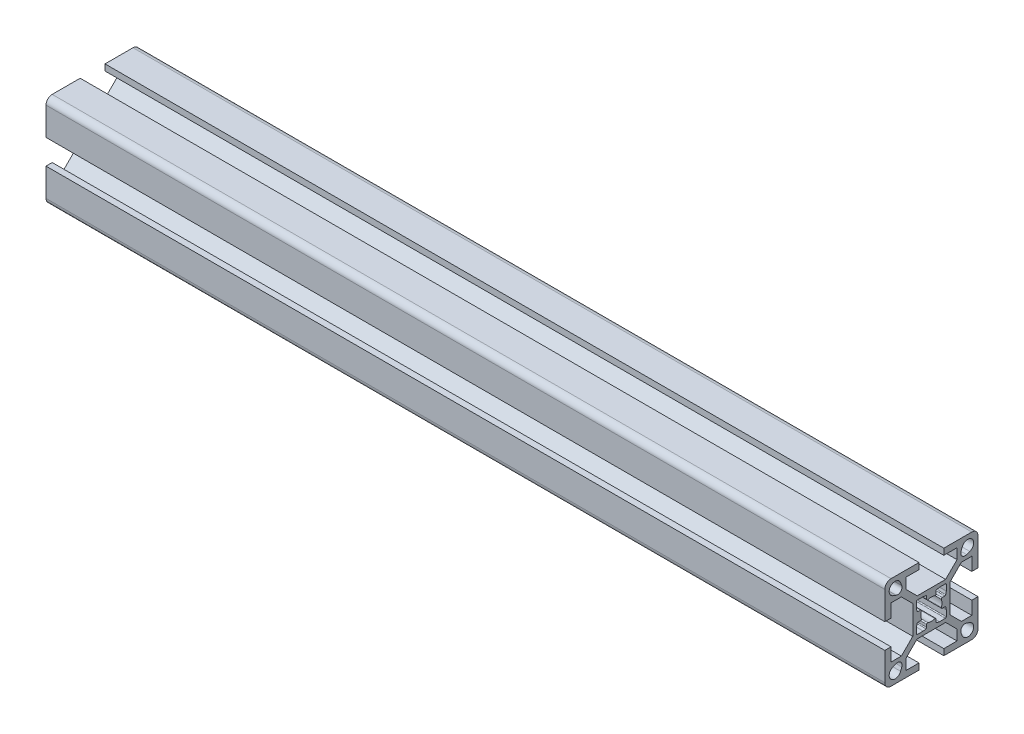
ISO-10303-21;
HEADER;
FILE_DESCRIPTION(('STEP AP214'),'2;1');
FILE_NAME('part.step','',(''),(''),'','','');
FILE_SCHEMA(('AUTOMOTIVE_DESIGN { 1 0 10303 214 1 1 1 1 }'));
ENDSEC;
DATA;
#1=APPLICATION_CONTEXT('core data for automotive mechanical design processes');
#2=APPLICATION_PROTOCOL_DEFINITION('international standard','automotive_design',2000,#1);
#3=PRODUCT_CONTEXT('',#1,'mechanical');
#4=PRODUCT('Part','Part','',(#3));
#5=PRODUCT_RELATED_PRODUCT_CATEGORY('part','',(#4));
#6=PRODUCT_DEFINITION_FORMATION('','',#4);
#7=PRODUCT_DEFINITION_CONTEXT('part definition',#1,'design');
#8=PRODUCT_DEFINITION('design','',#6,#7);
#9=PRODUCT_DEFINITION_SHAPE('','',#8);
#10=(LENGTH_UNIT() NAMED_UNIT(*) SI_UNIT(.MILLI.,.METRE.));
#11=(NAMED_UNIT(*) PLANE_ANGLE_UNIT() SI_UNIT($,.RADIAN.));
#12=(NAMED_UNIT(*) SI_UNIT($,.STERADIAN.) SOLID_ANGLE_UNIT());
#13=UNCERTAINTY_MEASURE_WITH_UNIT(LENGTH_MEASURE(1.E-05),#10,'distance_accuracy_value','');
#14=(GEOMETRIC_REPRESENTATION_CONTEXT(3) GLOBAL_UNCERTAINTY_ASSIGNED_CONTEXT((#13)) GLOBAL_UNIT_ASSIGNED_CONTEXT((#10,
#11,#12)) REPRESENTATION_CONTEXT('',''));
#15=CARTESIAN_POINT('',(0.,0.,0.));
#16=DIRECTION('',(0.,0.,1.));
#17=DIRECTION('',(1.,0.,0.));
#18=AXIS2_PLACEMENT_3D('',#15,#16,#17);
#19=CARTESIAN_POINT('',(270.,13.,13.));
#20=DIRECTION('',(1.,0.,0.));
#21=DIRECTION('',(0.,0.,-1.));
#22=AXIS2_PLACEMENT_3D('',#19,#20,#21);
#23=PLANE('',#22);
#24=CARTESIAN_POINT('',(270.,13.,13.));
#25=DIRECTION('',(1.,0.,0.));
#26=DIRECTION('',(0.,0.,-1.));
#27=AXIS2_PLACEMENT_3D('',#24,#25,#26);
#28=CIRCLE('',#27,1.99999999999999);
#29=CARTESIAN_POINT('',(270.,15.,13.));
#30=VERTEX_POINT('',#29);
#31=CARTESIAN_POINT('',(270.,13.,15.));
#32=VERTEX_POINT('',#31);
#33=EDGE_CURVE('E1302',#30,#32,#28,.T.);
#34=ORIENTED_EDGE('',*,*,#33,.T.);
#35=DIRECTION('',(0.,-1.,0.));
#36=VECTOR('',#35,1.);
#37=CARTESIAN_POINT('',(270.,13.,15.));
#38=LINE('',#37,#36);
#39=CARTESIAN_POINT('',(270.,3.99999999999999,15.));
#40=VERTEX_POINT('',#39);
#41=EDGE_CURVE('E1305',#32,#40,#38,.T.);
#42=ORIENTED_EDGE('',*,*,#41,.T.);
#43=DIRECTION('',(0.,0.,-1.));
#44=VECTOR('',#43,1.);
#45=CARTESIAN_POINT('',(270.,3.99999999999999,15.));
#46=LINE('',#45,#44);
#47=CARTESIAN_POINT('',(270.,3.99999999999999,13.));
#48=VERTEX_POINT('',#47);
#49=EDGE_CURVE('E1308',#40,#48,#46,.T.);
#50=ORIENTED_EDGE('',*,*,#49,.T.);
#51=DIRECTION('',(0.,1.,0.));
#52=VECTOR('',#51,1.);
#53=CARTESIAN_POINT('',(270.,3.99999999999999,13.));
#54=LINE('',#53,#52);
#55=CARTESIAN_POINT('',(270.,8.24999999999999,13.));
#56=VERTEX_POINT('',#55);
#57=EDGE_CURVE('E1310',#48,#56,#54,.T.);
#58=ORIENTED_EDGE('',*,*,#57,.T.);
#59=DIRECTION('',(0.,0.,-1.));
#60=VECTOR('',#59,1.);
#61=CARTESIAN_POINT('',(270.,8.24999999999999,13.));
#62=LINE('',#61,#60);
#63=CARTESIAN_POINT('',(270.,8.24999999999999,9.66421356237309));
#64=VERTEX_POINT('',#63);
#65=EDGE_CURVE('E1312',#56,#64,#62,.T.);
#66=ORIENTED_EDGE('',*,*,#65,.T.);
#67=DIRECTION('',(0.,-0.707106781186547,-0.707106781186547));
#68=VECTOR('',#67,1.);
#69=CARTESIAN_POINT('',(270.,8.24999999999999,9.66421356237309));
#70=LINE('',#69,#68);
#71=CARTESIAN_POINT('',(270.,4.5857864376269,6.));
#72=VERTEX_POINT('',#71);
#73=EDGE_CURVE('E1314',#64,#72,#70,.T.);
#74=ORIENTED_EDGE('',*,*,#73,.T.);
#75=DIRECTION('',(0.,-1.,0.));
#76=VECTOR('',#75,1.);
#77=CARTESIAN_POINT('',(270.,4.5857864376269,6.));
#78=LINE('',#77,#76);
#79=CARTESIAN_POINT('',(270.,-4.58578643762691,6.));
#80=VERTEX_POINT('',#79);
#81=EDGE_CURVE('E1316',#72,#80,#78,.T.);
#82=ORIENTED_EDGE('',*,*,#81,.T.);
#83=DIRECTION('',(0.,-0.707106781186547,0.707106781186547));
#84=VECTOR('',#83,1.);
#85=CARTESIAN_POINT('',(270.,-4.58578643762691,6.));
#86=LINE('',#85,#84);
#87=CARTESIAN_POINT('',(270.,-8.25,9.66421356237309));
#88=VERTEX_POINT('',#87);
#89=EDGE_CURVE('E1318',#80,#88,#86,.T.);
#90=ORIENTED_EDGE('',*,*,#89,.T.);
#91=DIRECTION('',(0.,0.,1.));
#92=VECTOR('',#91,1.);
#93=CARTESIAN_POINT('',(270.,-8.25,9.66421356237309));
#94=LINE('',#93,#92);
#95=CARTESIAN_POINT('',(270.,-8.25,13.));
#96=VERTEX_POINT('',#95);
#97=EDGE_CURVE('E1320',#88,#96,#94,.T.);
#98=ORIENTED_EDGE('',*,*,#97,.T.);
#99=DIRECTION('',(0.,1.,0.));
#100=VECTOR('',#99,1.);
#101=CARTESIAN_POINT('',(270.,-8.25,13.));
#102=LINE('',#101,#100);
#103=CARTESIAN_POINT('',(270.,-4.,13.));
#104=VERTEX_POINT('',#103);
#105=EDGE_CURVE('E1322',#96,#104,#102,.T.);
#106=ORIENTED_EDGE('',*,*,#105,.T.);
#107=DIRECTION('',(0.,0.,1.));
#108=VECTOR('',#107,1.);
#109=CARTESIAN_POINT('',(270.,-4.,13.));
#110=LINE('',#109,#108);
#111=CARTESIAN_POINT('',(270.,-4.,15.));
#112=VERTEX_POINT('',#111);
#113=EDGE_CURVE('E1324',#104,#112,#110,.T.);
#114=ORIENTED_EDGE('',*,*,#113,.T.);
#115=DIRECTION('',(0.,-1.,0.));
#116=VECTOR('',#115,1.);
#117=CARTESIAN_POINT('',(270.,-4.,15.));
#118=LINE('',#117,#116);
#119=CARTESIAN_POINT('',(270.,-13.,15.));
#120=VERTEX_POINT('',#119);
#121=EDGE_CURVE('E1326',#112,#120,#118,.T.);
#122=ORIENTED_EDGE('',*,*,#121,.T.);
#123=CARTESIAN_POINT('',(270.,-13.,13.));
#124=DIRECTION('',(1.,0.,0.));
#125=DIRECTION('',(0.,0.,-1.));
#126=AXIS2_PLACEMENT_3D('',#123,#124,#125);
#127=CIRCLE('',#126,2.);
#128=CARTESIAN_POINT('',(270.,-15.,13.));
#129=VERTEX_POINT('',#128);
#130=EDGE_CURVE('E1328',#120,#129,#127,.T.);
#131=ORIENTED_EDGE('',*,*,#130,.T.);
#132=DIRECTION('',(0.,0.,-1.));
#133=VECTOR('',#132,1.);
#134=CARTESIAN_POINT('',(270.,-15.,13.));
#135=LINE('',#134,#133);
#136=CARTESIAN_POINT('',(270.,-15.,4.));
#137=VERTEX_POINT('',#136);
#138=EDGE_CURVE('E1330',#129,#137,#135,.T.);
#139=ORIENTED_EDGE('',*,*,#138,.T.);
#140=DIRECTION('',(0.,1.,0.));
#141=VECTOR('',#140,1.);
#142=CARTESIAN_POINT('',(270.,-15.,4.));
#143=LINE('',#142,#141);
#144=CARTESIAN_POINT('',(270.,-13.,4.));
#145=VERTEX_POINT('',#144);
#146=EDGE_CURVE('E1332',#137,#145,#143,.T.);
#147=ORIENTED_EDGE('',*,*,#146,.T.);
#148=DIRECTION('',(0.,0.,1.));
#149=VECTOR('',#148,1.);
#150=CARTESIAN_POINT('',(270.,-13.,4.));
#151=LINE('',#150,#149);
#152=CARTESIAN_POINT('',(270.,-13.,8.25));
#153=VERTEX_POINT('',#152);
#154=EDGE_CURVE('E1334',#145,#153,#151,.T.);
#155=ORIENTED_EDGE('',*,*,#154,.T.);
#156=DIRECTION('',(0.,1.,0.));
#157=VECTOR('',#156,1.);
#158=CARTESIAN_POINT('',(270.,-13.,8.25));
#159=LINE('',#158,#157);
#160=CARTESIAN_POINT('',(270.,-9.6642135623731,8.25));
#161=VERTEX_POINT('',#160);
#162=EDGE_CURVE('E1336',#153,#161,#159,.T.);
#163=ORIENTED_EDGE('',*,*,#162,.T.);
#164=DIRECTION('',(0.,0.707106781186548,-0.707106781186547));
#165=VECTOR('',#164,1.);
#166=CARTESIAN_POINT('',(270.,-9.6642135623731,8.25));
#167=LINE('',#166,#165);
#168=CARTESIAN_POINT('',(270.,-6.00000000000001,4.58578643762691));
#169=VERTEX_POINT('',#168);
#170=EDGE_CURVE('E1338',#161,#169,#167,.T.);
#171=ORIENTED_EDGE('',*,*,#170,.T.);
#172=DIRECTION('',(0.,0.,-1.));
#173=VECTOR('',#172,1.);
#174=CARTESIAN_POINT('',(270.,-6.00000000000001,4.58578643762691));
#175=LINE('',#174,#173);
#176=CARTESIAN_POINT('',(270.,-6.00000000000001,-4.58578643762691));
#177=VERTEX_POINT('',#176);
#178=EDGE_CURVE('E1340',#169,#177,#175,.T.);
#179=ORIENTED_EDGE('',*,*,#178,.T.);
#180=DIRECTION('',(0.,-0.707106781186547,-0.707106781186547));
#181=VECTOR('',#180,1.);
#182=CARTESIAN_POINT('',(270.,-6.00000000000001,-4.58578643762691));
#183=LINE('',#182,#181);
#184=CARTESIAN_POINT('',(270.,-9.6642135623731,-8.25000000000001));
#185=VERTEX_POINT('',#184);
#186=EDGE_CURVE('E1342',#177,#185,#183,.T.);
#187=ORIENTED_EDGE('',*,*,#186,.T.);
#188=DIRECTION('',(0.,-1.,0.));
#189=VECTOR('',#188,1.);
#190=CARTESIAN_POINT('',(270.,-9.6642135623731,-8.25000000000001));
#191=LINE('',#190,#189);
#192=CARTESIAN_POINT('',(270.,-13.,-8.25000000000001));
#193=VERTEX_POINT('',#192);
#194=EDGE_CURVE('E1344',#185,#193,#191,.T.);
#195=ORIENTED_EDGE('',*,*,#194,.T.);
#196=DIRECTION('',(0.,0.,1.));
#197=VECTOR('',#196,1.);
#198=CARTESIAN_POINT('',(270.,-13.,-8.25000000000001));
#199=LINE('',#198,#197);
#200=CARTESIAN_POINT('',(270.,-13.,-4.));
#201=VERTEX_POINT('',#200);
#202=EDGE_CURVE('E1346',#193,#201,#199,.T.);
#203=ORIENTED_EDGE('',*,*,#202,.T.);
#204=DIRECTION('',(0.,-1.,0.));
#205=VECTOR('',#204,1.);
#206=CARTESIAN_POINT('',(270.,-13.,-4.));
#207=LINE('',#206,#205);
#208=CARTESIAN_POINT('',(270.,-15.,-4.));
#209=VERTEX_POINT('',#208);
#210=EDGE_CURVE('E1348',#201,#209,#207,.T.);
#211=ORIENTED_EDGE('',*,*,#210,.T.);
#212=DIRECTION('',(0.,0.,-1.));
#213=VECTOR('',#212,1.);
#214=CARTESIAN_POINT('',(270.,-15.,-4.));
#215=LINE('',#214,#213);
#216=CARTESIAN_POINT('',(270.,-15.,-13.));
#217=VERTEX_POINT('',#216);
#218=EDGE_CURVE('E1350',#209,#217,#215,.T.);
#219=ORIENTED_EDGE('',*,*,#218,.T.);
#220=CARTESIAN_POINT('',(270.,-13.,-13.));
#221=DIRECTION('',(1.,0.,0.));
#222=DIRECTION('',(0.,0.,-1.));
#223=AXIS2_PLACEMENT_3D('',#220,#221,#222);
#224=CIRCLE('',#223,1.99999999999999);
#225=CARTESIAN_POINT('',(270.,-13.,-15.));
#226=VERTEX_POINT('',#225);
#227=EDGE_CURVE('E1352',#217,#226,#224,.T.);
#228=ORIENTED_EDGE('',*,*,#227,.T.);
#229=DIRECTION('',(0.,1.,0.));
#230=VECTOR('',#229,1.);
#231=CARTESIAN_POINT('',(270.,-13.,-15.));
#232=LINE('',#231,#230);
#233=CARTESIAN_POINT('',(270.,-4.00000000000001,-15.));
#234=VERTEX_POINT('',#233);
#235=EDGE_CURVE('E1354',#226,#234,#232,.T.);
#236=ORIENTED_EDGE('',*,*,#235,.T.);
#237=DIRECTION('',(0.,0.,1.));
#238=VECTOR('',#237,1.);
#239=CARTESIAN_POINT('',(270.,-4.00000000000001,-15.));
#240=LINE('',#239,#238);
#241=CARTESIAN_POINT('',(270.,-4.00000000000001,-13.));
#242=VERTEX_POINT('',#241);
#243=EDGE_CURVE('E1356',#234,#242,#240,.T.);
#244=ORIENTED_EDGE('',*,*,#243,.T.);
#245=DIRECTION('',(0.,-1.,0.));
#246=VECTOR('',#245,1.);
#247=CARTESIAN_POINT('',(270.,-4.00000000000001,-13.));
#248=LINE('',#247,#246);
#249=CARTESIAN_POINT('',(270.,-8.25000000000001,-13.));
#250=VERTEX_POINT('',#249);
#251=EDGE_CURVE('E1358',#242,#250,#248,.T.);
#252=ORIENTED_EDGE('',*,*,#251,.T.);
#253=DIRECTION('',(0.,0.,1.));
#254=VECTOR('',#253,1.);
#255=CARTESIAN_POINT('',(270.,-8.25000000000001,-13.));
#256=LINE('',#255,#254);
#257=CARTESIAN_POINT('',(270.,-8.25000000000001,-9.6642135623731));
#258=VERTEX_POINT('',#257);
#259=EDGE_CURVE('E1360',#250,#258,#256,.T.);
#260=ORIENTED_EDGE('',*,*,#259,.T.);
#261=DIRECTION('',(0.,0.707106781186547,0.707106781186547));
#262=VECTOR('',#261,1.);
#263=CARTESIAN_POINT('',(270.,-8.25000000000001,-9.6642135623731));
#264=LINE('',#263,#262);
#265=CARTESIAN_POINT('',(270.,-4.58578643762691,-6.00000000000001));
#266=VERTEX_POINT('',#265);
#267=EDGE_CURVE('E1362',#258,#266,#264,.T.);
#268=ORIENTED_EDGE('',*,*,#267,.T.);
#269=DIRECTION('',(0.,1.,0.));
#270=VECTOR('',#269,1.);
#271=CARTESIAN_POINT('',(270.,-4.58578643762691,-6.00000000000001));
#272=LINE('',#271,#270);
#273=CARTESIAN_POINT('',(270.,4.5857864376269,-6.00000000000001));
#274=VERTEX_POINT('',#273);
#275=EDGE_CURVE('E1364',#266,#274,#272,.T.);
#276=ORIENTED_EDGE('',*,*,#275,.T.);
#277=DIRECTION('',(0.,0.707106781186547,-0.707106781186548));
#278=VECTOR('',#277,1.);
#279=CARTESIAN_POINT('',(270.,4.5857864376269,-6.00000000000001));
#280=LINE('',#279,#278);
#281=CARTESIAN_POINT('',(270.,8.24999999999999,-9.6642135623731));
#282=VERTEX_POINT('',#281);
#283=EDGE_CURVE('E1366',#274,#282,#280,.T.);
#284=ORIENTED_EDGE('',*,*,#283,.T.);
#285=DIRECTION('',(0.,0.,-1.));
#286=VECTOR('',#285,1.);
#287=CARTESIAN_POINT('',(270.,8.24999999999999,-9.6642135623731));
#288=LINE('',#287,#286);
#289=CARTESIAN_POINT('',(270.,8.24999999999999,-13.));
#290=VERTEX_POINT('',#289);
#291=EDGE_CURVE('E1368',#282,#290,#288,.T.);
#292=ORIENTED_EDGE('',*,*,#291,.T.);
#293=DIRECTION('',(0.,-1.,0.));
#294=VECTOR('',#293,1.);
#295=CARTESIAN_POINT('',(270.,8.24999999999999,-13.));
#296=LINE('',#295,#294);
#297=CARTESIAN_POINT('',(270.,3.99999999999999,-13.));
#298=VERTEX_POINT('',#297);
#299=EDGE_CURVE('E1370',#290,#298,#296,.T.);
#300=ORIENTED_EDGE('',*,*,#299,.T.);
#301=DIRECTION('',(0.,0.,-1.));
#302=VECTOR('',#301,1.);
#303=CARTESIAN_POINT('',(270.,3.99999999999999,-13.));
#304=LINE('',#303,#302);
#305=CARTESIAN_POINT('',(270.,3.99999999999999,-15.));
#306=VERTEX_POINT('',#305);
#307=EDGE_CURVE('E1372',#298,#306,#304,.T.);
#308=ORIENTED_EDGE('',*,*,#307,.T.);
#309=DIRECTION('',(0.,1.,0.));
#310=VECTOR('',#309,1.);
#311=CARTESIAN_POINT('',(270.,3.99999999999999,-15.));
#312=LINE('',#311,#310);
#313=CARTESIAN_POINT('',(270.,13.,-15.));
#314=VERTEX_POINT('',#313);
#315=EDGE_CURVE('E1374',#306,#314,#312,.T.);
#316=ORIENTED_EDGE('',*,*,#315,.T.);
#317=CARTESIAN_POINT('',(270.,13.,-13.));
#318=DIRECTION('',(1.,0.,0.));
#319=DIRECTION('',(0.,0.,-1.));
#320=AXIS2_PLACEMENT_3D('',#317,#318,#319);
#321=CIRCLE('',#320,2.);
#322=CARTESIAN_POINT('',(270.,15.,-13.));
#323=VERTEX_POINT('',#322);
#324=EDGE_CURVE('E1376',#314,#323,#321,.T.);
#325=ORIENTED_EDGE('',*,*,#324,.T.);
#326=DIRECTION('',(0.,0.,1.));
#327=VECTOR('',#326,1.);
#328=CARTESIAN_POINT('',(270.,15.,-13.));
#329=LINE('',#328,#327);
#330=CARTESIAN_POINT('',(270.,15.,-4.));
#331=VERTEX_POINT('',#330);
#332=EDGE_CURVE('E1378',#323,#331,#329,.T.);
#333=ORIENTED_EDGE('',*,*,#332,.T.);
#334=DIRECTION('',(0.,-1.,0.));
#335=VECTOR('',#334,1.);
#336=CARTESIAN_POINT('',(270.,15.,-4.));
#337=LINE('',#336,#335);
#338=CARTESIAN_POINT('',(270.,13.,-4.));
#339=VERTEX_POINT('',#338);
#340=EDGE_CURVE('E1380',#331,#339,#337,.T.);
#341=ORIENTED_EDGE('',*,*,#340,.T.);
#342=DIRECTION('',(0.,0.,-1.));
#343=VECTOR('',#342,1.);
#344=CARTESIAN_POINT('',(270.,13.,-4.));
#345=LINE('',#344,#343);
#346=CARTESIAN_POINT('',(270.,13.,-8.25000000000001));
#347=VERTEX_POINT('',#346);
#348=EDGE_CURVE('E1382',#339,#347,#345,.T.);
#349=ORIENTED_EDGE('',*,*,#348,.T.);
#350=DIRECTION('',(0.,-1.,0.));
#351=VECTOR('',#350,1.);
#352=CARTESIAN_POINT('',(270.,13.,-8.25000000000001));
#353=LINE('',#352,#351);
#354=CARTESIAN_POINT('',(270.,9.66421356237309,-8.25000000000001));
#355=VERTEX_POINT('',#354);
#356=EDGE_CURVE('E1384',#347,#355,#353,.T.);
#357=ORIENTED_EDGE('',*,*,#356,.T.);
#358=DIRECTION('',(0.,-0.707106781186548,0.707106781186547));
#359=VECTOR('',#358,1.);
#360=CARTESIAN_POINT('',(270.,9.66421356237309,-8.25000000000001));
#361=LINE('',#360,#359);
#362=CARTESIAN_POINT('',(270.,5.99999999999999,-4.58578643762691));
#363=VERTEX_POINT('',#362);
#364=EDGE_CURVE('E1386',#355,#363,#361,.T.);
#365=ORIENTED_EDGE('',*,*,#364,.T.);
#366=DIRECTION('',(0.,0.,1.));
#367=VECTOR('',#366,1.);
#368=CARTESIAN_POINT('',(270.,5.99999999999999,-4.58578643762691));
#369=LINE('',#368,#367);
#370=CARTESIAN_POINT('',(270.,5.99999999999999,4.58578643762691));
#371=VERTEX_POINT('',#370);
#372=EDGE_CURVE('E1388',#363,#371,#369,.T.);
#373=ORIENTED_EDGE('',*,*,#372,.T.);
#374=DIRECTION('',(0.,0.707106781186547,0.707106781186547));
#375=VECTOR('',#374,1.);
#376=CARTESIAN_POINT('',(270.,5.99999999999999,4.58578643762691));
#377=LINE('',#376,#375);
#378=CARTESIAN_POINT('',(270.,9.66421356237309,8.25));
#379=VERTEX_POINT('',#378);
#380=EDGE_CURVE('E1390',#371,#379,#377,.T.);
#381=ORIENTED_EDGE('',*,*,#380,.T.);
#382=DIRECTION('',(0.,1.,0.));
#383=VECTOR('',#382,1.);
#384=CARTESIAN_POINT('',(270.,9.66421356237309,8.25));
#385=LINE('',#384,#383);
#386=CARTESIAN_POINT('',(270.,13.,8.25));
#387=VERTEX_POINT('',#386);
#388=EDGE_CURVE('E1392',#379,#387,#385,.T.);
#389=ORIENTED_EDGE('',*,*,#388,.T.);
#390=DIRECTION('',(0.,0.,-1.));
#391=VECTOR('',#390,1.);
#392=CARTESIAN_POINT('',(270.,13.,8.25));
#393=LINE('',#392,#391);
#394=CARTESIAN_POINT('',(270.,13.,4.));
#395=VERTEX_POINT('',#394);
#396=EDGE_CURVE('E1394',#387,#395,#393,.T.);
#397=ORIENTED_EDGE('',*,*,#396,.T.);
#398=DIRECTION('',(0.,1.,0.));
#399=VECTOR('',#398,1.);
#400=CARTESIAN_POINT('',(270.,13.,4.));
#401=LINE('',#400,#399);
#402=CARTESIAN_POINT('',(270.,15.,4.));
#403=VERTEX_POINT('',#402);
#404=EDGE_CURVE('E1396',#395,#403,#401,.T.);
#405=ORIENTED_EDGE('',*,*,#404,.T.);
#406=DIRECTION('',(0.,0.,1.));
#407=VECTOR('',#406,1.);
#408=CARTESIAN_POINT('',(270.,15.,4.));
#409=LINE('',#408,#407);
#410=EDGE_CURVE('E1398',#403,#30,#409,.T.);
#411=ORIENTED_EDGE('',*,*,#410,.T.);
#412=EDGE_LOOP('',(#34,#42,#50,#58,#66,#74,#82,#90,#98,#106,#114,#122,#131,#139,#147,#155,#163,
#171,#179,#187,#195,#203,#211,#219,#228,#236,#244,#252,#260,#268,#276,#284,#292,#300,#308,#316,
#325,#333,#341,#349,#357,#365,#373,#381,#389,#397,#405,#411));
#413=FACE_BOUND('',#412,.T.);
#414=DIRECTION('',(0.,-0.348174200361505,-0.93742985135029));
#415=VECTOR('',#414,1.);
#416=CARTESIAN_POINT('',(270.,9.91888328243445,12.3615309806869));
#417=LINE('',#416,#415);
#418=CARTESIAN_POINT('',(270.,9.91888328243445,12.3615309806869));
#419=VERTEX_POINT('',#418);
#420=CARTESIAN_POINT('',(270.,9.53907007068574,11.3389157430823));
#421=VERTEX_POINT('',#420);
#422=EDGE_CURVE('E1273',#419,#421,#417,.T.);
#423=ORIENTED_EDGE('',*,*,#422,.F.);
#424=CARTESIAN_POINT('',(270.,11.7,11.7));
#425=DIRECTION('',(1.,0.,0.));
#426=DIRECTION('',(0.,0.,-1.));
#427=AXIS2_PLACEMENT_3D('',#424,#425,#426);
#428=CIRCLE('',#427,1.9);
#429=CARTESIAN_POINT('',(270.,12.3615309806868,9.91888328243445));
#430=VERTEX_POINT('',#429);
#431=EDGE_CURVE('E1271',#430,#419,#428,.T.);
#432=ORIENTED_EDGE('',*,*,#431,.F.);
#433=DIRECTION('',(0.,0.937429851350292,0.3481742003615));
#434=VECTOR('',#433,1.);
#435=CARTESIAN_POINT('',(270.,11.3389157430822,9.53907007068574));
#436=LINE('',#435,#434);
#437=CARTESIAN_POINT('',(270.,11.3389157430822,9.53907007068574));
#438=VERTEX_POINT('',#437);
#439=EDGE_CURVE('E1279',#438,#430,#436,.T.);
#440=ORIENTED_EDGE('',*,*,#439,.F.);
#441=CARTESIAN_POINT('',(270.,10.8514718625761,10.8514718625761));
#442=DIRECTION('',(1.,0.,0.));
#443=DIRECTION('',(0.,0.,-1.));
#444=AXIS2_PLACEMENT_3D('',#441,#442,#443);
#445=CIRCLE('',#444,1.4);
#446=EDGE_CURVE('E1276',#421,#438,#445,.T.);
#447=ORIENTED_EDGE('',*,*,#446,.F.);
#448=EDGE_LOOP('',(#423,#432,#440,#447));
#449=FACE_BOUND('',#448,.T.);
#450=DIRECTION('',(0.,0.3481742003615,-0.937429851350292));
#451=VECTOR('',#450,1.);
#452=CARTESIAN_POINT('',(270.,9.53907007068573,-11.3389157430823));
#453=LINE('',#452,#451);
#454=CARTESIAN_POINT('',(270.,9.53907007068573,-11.3389157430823));
#455=VERTEX_POINT('',#454);
#456=CARTESIAN_POINT('',(270.,9.91888328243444,-12.3615309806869));
#457=VERTEX_POINT('',#456);
#458=EDGE_CURVE('E1242',#455,#457,#453,.T.);
#459=ORIENTED_EDGE('',*,*,#458,.F.);
#460=CARTESIAN_POINT('',(270.,10.8514718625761,-10.8514718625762));
#461=DIRECTION('',(1.,0.,0.));
#462=DIRECTION('',(0.,0.,-1.));
#463=AXIS2_PLACEMENT_3D('',#460,#461,#462);
#464=CIRCLE('',#463,1.4);
#465=CARTESIAN_POINT('',(270.,11.3389157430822,-9.53907007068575));
#466=VERTEX_POINT('',#465);
#467=EDGE_CURVE('E1240',#466,#455,#464,.T.);
#468=ORIENTED_EDGE('',*,*,#467,.F.);
#469=DIRECTION('',(0.,-0.937429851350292,0.3481742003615));
#470=VECTOR('',#469,1.);
#471=CARTESIAN_POINT('',(270.,12.3615309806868,-9.91888328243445));
#472=LINE('',#471,#470);
#473=CARTESIAN_POINT('',(270.,12.3615309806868,-9.91888328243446));
#474=VERTEX_POINT('',#473);
#475=EDGE_CURVE('E1248',#474,#466,#472,.T.);
#476=ORIENTED_EDGE('',*,*,#475,.F.);
#477=CARTESIAN_POINT('',(270.,11.7,-11.7));
#478=DIRECTION('',(1.,0.,0.));
#479=DIRECTION('',(0.,0.,-1.));
#480=AXIS2_PLACEMENT_3D('',#477,#478,#479);
#481=CIRCLE('',#480,1.9);
#482=EDGE_CURVE('E1245',#457,#474,#481,.T.);
#483=ORIENTED_EDGE('',*,*,#482,.F.);
#484=EDGE_LOOP('',(#459,#468,#476,#483));
#485=FACE_BOUND('',#484,.T.);
#486=DIRECTION('',(0.,0.,-1.));
#487=VECTOR('',#486,1.);
#488=CARTESIAN_POINT('',(270.,-4.80000000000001,4.5));
#489=LINE('',#488,#487);
#490=CARTESIAN_POINT('',(270.,-4.80000000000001,4.5));
#491=VERTEX_POINT('',#490);
#492=CARTESIAN_POINT('',(270.,-4.80000000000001,2.64443357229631));
#493=VERTEX_POINT('',#492);
#494=EDGE_CURVE('E847',#491,#493,#489,.T.);
#495=ORIENTED_EDGE('',*,*,#494,.F.);
#496=CARTESIAN_POINT('',(270.,-4.50000000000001,4.5));
#497=DIRECTION('',(1.,0.,0.));
#498=DIRECTION('',(0.,0.,-1.));
#499=AXIS2_PLACEMENT_3D('',#496,#497,#498);
#500=CIRCLE('',#499,0.299999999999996);
#501=CARTESIAN_POINT('',(270.,-4.50000000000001,4.8));
#502=VERTEX_POINT('',#501);
#503=EDGE_CURVE('E845',#502,#491,#500,.T.);
#504=ORIENTED_EDGE('',*,*,#503,.F.);
#505=DIRECTION('',(0.,-1.,0.));
#506=VECTOR('',#505,1.);
#507=CARTESIAN_POINT('',(270.,-2.6444335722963,4.8));
#508=LINE('',#507,#506);
#509=CARTESIAN_POINT('',(270.,-2.64443357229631,4.8));
#510=VERTEX_POINT('',#509);
#511=EDGE_CURVE('E957',#510,#502,#508,.T.);
#512=ORIENTED_EDGE('',*,*,#511,.F.);
#513=CARTESIAN_POINT('',(270.,-2.6444335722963,4.50000000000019));
#514=DIRECTION('',(1.,0.,0.));
#515=DIRECTION('',(0.,0.,-1.));
#516=AXIS2_PLACEMENT_3D('',#513,#514,#515);
#517=CIRCLE('',#516,0.299999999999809);
#518=CARTESIAN_POINT('',(270.,-2.58719087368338,4.7944881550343));
#519=VERTEX_POINT('',#518);
#520=EDGE_CURVE('E954',#519,#510,#517,.T.);
#521=ORIENTED_EDGE('',*,*,#520,.F.);
#522=DIRECTION('',(0.,-0.981627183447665,0.190808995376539));
#523=VECTOR('',#522,1.);
#524=CARTESIAN_POINT('',(270.,-1.74275730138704,4.63034689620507));
#525=LINE('',#524,#523);
#526=CARTESIAN_POINT('',(270.,-1.74275730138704,4.63034689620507));
#527=VERTEX_POINT('',#526);
#528=EDGE_CURVE('E952',#527,#519,#525,.T.);
#529=ORIENTED_EDGE('',*,*,#528,.F.);
#530=CARTESIAN_POINT('',(270.,-1.8,4.33585874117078));
#531=DIRECTION('',(1.,0.,0.));
#532=DIRECTION('',(0.,0.,-1.));
#533=AXIS2_PLACEMENT_3D('',#530,#531,#532);
#534=CIRCLE('',#533,0.299999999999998);
#535=CARTESIAN_POINT('',(270.,-1.50000000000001,4.33585874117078));
#536=VERTEX_POINT('',#535);
#537=EDGE_CURVE('E950',#536,#527,#534,.T.);
#538=ORIENTED_EDGE('',*,*,#537,.F.);
#539=DIRECTION('',(0.,0.,1.));
#540=VECTOR('',#539,1.);
#541=CARTESIAN_POINT('',(270.,-1.50000000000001,3.5));
#542=LINE('',#541,#540);
#543=CARTESIAN_POINT('',(270.,-1.50000000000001,3.5));
#544=VERTEX_POINT('',#543);
#545=EDGE_CURVE('E948',#544,#536,#542,.T.);
#546=ORIENTED_EDGE('',*,*,#545,.F.);
#547=CARTESIAN_POINT('',(270.,-1.20000000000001,3.5));
#548=DIRECTION('',(-1.,0.,0.));
#549=DIRECTION('',(0.,0.,-1.));
#550=AXIS2_PLACEMENT_3D('',#547,#548,#549);
#551=CIRCLE('',#550,0.3);
#552=CARTESIAN_POINT('',(270.,-1.10270270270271,3.21621621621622));
#553=VERTEX_POINT('',#552);
#554=EDGE_CURVE('E946',#553,#544,#551,.T.);
#555=ORIENTED_EDGE('',*,*,#554,.F.);
#556=CARTESIAN_POINT('',(270.,0.,0.));
#557=DIRECTION('',(1.,0.,0.));
#558=DIRECTION('',(0.,0.,-1.));
#559=AXIS2_PLACEMENT_3D('',#556,#557,#558);
#560=CIRCLE('',#559,3.40000000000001);
#561=CARTESIAN_POINT('',(270.,1.1027027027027,3.21621621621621));
#562=VERTEX_POINT('',#561);
#563=EDGE_CURVE('E944',#562,#553,#560,.T.);
#564=ORIENTED_EDGE('',*,*,#563,.F.);
#565=CARTESIAN_POINT('',(270.,1.2,3.5));
#566=DIRECTION('',(-1.,0.,0.));
#567=DIRECTION('',(0.,0.,-1.));
#568=AXIS2_PLACEMENT_3D('',#565,#566,#567);
#569=CIRCLE('',#568,0.3);
#570=CARTESIAN_POINT('',(270.,1.5,3.5));
#571=VERTEX_POINT('',#570);
#572=EDGE_CURVE('E942',#571,#562,#569,.T.);
#573=ORIENTED_EDGE('',*,*,#572,.F.);
#574=DIRECTION('',(0.,0.,-1.));
#575=VECTOR('',#574,1.);
#576=CARTESIAN_POINT('',(270.,1.5,4.33585874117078));
#577=LINE('',#576,#575);
#578=CARTESIAN_POINT('',(270.,1.5,4.33585874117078));
#579=VERTEX_POINT('',#578);
#580=EDGE_CURVE('E940',#579,#571,#577,.T.);
#581=ORIENTED_EDGE('',*,*,#580,.F.);
#582=CARTESIAN_POINT('',(270.,1.79999999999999,4.33585874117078));
#583=DIRECTION('',(1.,0.,0.));
#584=DIRECTION('',(0.,0.,-1.));
#585=AXIS2_PLACEMENT_3D('',#582,#583,#584);
#586=CIRCLE('',#585,0.299999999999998);
#587=CARTESIAN_POINT('',(270.,1.74275730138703,4.63034689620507));
#588=VERTEX_POINT('',#587);
#589=EDGE_CURVE('E938',#588,#579,#586,.T.);
#590=ORIENTED_EDGE('',*,*,#589,.F.);
#591=DIRECTION('',(0.,-0.981627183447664,-0.190808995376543));
#592=VECTOR('',#591,1.);
#593=CARTESIAN_POINT('',(270.,2.58719087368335,4.7944881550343));
#594=LINE('',#593,#592);
#595=CARTESIAN_POINT('',(270.,2.58719087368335,4.7944881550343));
#596=VERTEX_POINT('',#595);
#597=EDGE_CURVE('E936',#596,#588,#594,.T.);
#598=ORIENTED_EDGE('',*,*,#597,.F.);
#599=CARTESIAN_POINT('',(270.,2.6444335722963,4.50000000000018));
#600=DIRECTION('',(1.,0.,0.));
#601=DIRECTION('',(0.,0.,-1.));
#602=AXIS2_PLACEMENT_3D('',#599,#600,#601);
#603=CIRCLE('',#602,0.299999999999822);
#604=CARTESIAN_POINT('',(270.,2.6444335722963,4.8));
#605=VERTEX_POINT('',#604);
#606=EDGE_CURVE('E934',#605,#596,#603,.T.);
#607=ORIENTED_EDGE('',*,*,#606,.F.);
#608=DIRECTION('',(0.,-1.,0.));
#609=VECTOR('',#608,1.);
#610=CARTESIAN_POINT('',(270.,4.5,4.8));
#611=LINE('',#610,#609);
#612=CARTESIAN_POINT('',(270.,4.5,4.8));
#613=VERTEX_POINT('',#612);
#614=EDGE_CURVE('E932',#613,#605,#611,.T.);
#615=ORIENTED_EDGE('',*,*,#614,.F.);
#616=CARTESIAN_POINT('',(270.,4.5,4.5));
#617=DIRECTION('',(1.,0.,0.));
#618=DIRECTION('',(0.,0.,-1.));
#619=AXIS2_PLACEMENT_3D('',#616,#617,#618);
#620=CIRCLE('',#619,0.299999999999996);
#621=CARTESIAN_POINT('',(270.,4.79999999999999,4.5));
#622=VERTEX_POINT('',#621);
#623=EDGE_CURVE('E930',#622,#613,#620,.T.);
#624=ORIENTED_EDGE('',*,*,#623,.F.);
#625=DIRECTION('',(0.,0.,1.));
#626=VECTOR('',#625,1.);
#627=CARTESIAN_POINT('',(270.,4.8,2.6444335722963));
#628=LINE('',#627,#626);
#629=CARTESIAN_POINT('',(270.,4.8,2.6444335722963));
#630=VERTEX_POINT('',#629);
#631=EDGE_CURVE('E928',#630,#622,#628,.T.);
#632=ORIENTED_EDGE('',*,*,#631,.F.);
#633=CARTESIAN_POINT('',(270.,4.50000000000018,2.6444335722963));
#634=DIRECTION('',(1.,0.,0.));
#635=DIRECTION('',(0.,0.,-1.));
#636=AXIS2_PLACEMENT_3D('',#633,#634,#635);
#637=CIRCLE('',#636,0.299999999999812);
#638=CARTESIAN_POINT('',(270.,4.7944881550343,2.58719087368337));
#639=VERTEX_POINT('',#638);
#640=EDGE_CURVE('E926',#639,#630,#637,.T.);
#641=ORIENTED_EDGE('',*,*,#640,.F.);
#642=DIRECTION('',(0.,0.190808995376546,0.981627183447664));
#643=VECTOR('',#642,1.);
#644=CARTESIAN_POINT('',(270.,4.63034689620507,1.74275730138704));
#645=LINE('',#644,#643);
#646=CARTESIAN_POINT('',(270.,4.63034689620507,1.74275730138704));
#647=VERTEX_POINT('',#646);
#648=EDGE_CURVE('E924',#647,#639,#645,.T.);
#649=ORIENTED_EDGE('',*,*,#648,.F.);
#650=CARTESIAN_POINT('',(270.,4.33585874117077,1.8));
#651=DIRECTION('',(1.,0.,0.));
#652=DIRECTION('',(0.,0.,-1.));
#653=AXIS2_PLACEMENT_3D('',#650,#651,#652);
#654=CIRCLE('',#653,0.299999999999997);
#655=CARTESIAN_POINT('',(270.,4.33585874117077,1.5));
#656=VERTEX_POINT('',#655);
#657=EDGE_CURVE('E922',#656,#647,#654,.T.);
#658=ORIENTED_EDGE('',*,*,#657,.F.);
#659=DIRECTION('',(0.,1.,0.));
#660=VECTOR('',#659,1.);
#661=CARTESIAN_POINT('',(270.,3.5,1.5));
#662=LINE('',#661,#660);
#663=CARTESIAN_POINT('',(270.,3.5,1.5));
#664=VERTEX_POINT('',#663);
#665=EDGE_CURVE('E920',#664,#656,#662,.T.);
#666=ORIENTED_EDGE('',*,*,#665,.F.);
#667=CARTESIAN_POINT('',(270.,3.5,1.2));
#668=DIRECTION('',(-1.,0.,0.));
#669=DIRECTION('',(0.,0.,-1.));
#670=AXIS2_PLACEMENT_3D('',#667,#668,#669);
#671=CIRCLE('',#670,0.300000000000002);
#672=CARTESIAN_POINT('',(270.,3.21621621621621,1.1027027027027));
#673=VERTEX_POINT('',#672);
#674=EDGE_CURVE('E918',#673,#664,#671,.T.);
#675=ORIENTED_EDGE('',*,*,#674,.F.);
#676=CARTESIAN_POINT('',(270.,0.,0.));
#677=DIRECTION('',(1.,0.,0.));
#678=DIRECTION('',(0.,0.,-1.));
#679=AXIS2_PLACEMENT_3D('',#676,#677,#678);
#680=CIRCLE('',#679,3.4);
#681=CARTESIAN_POINT('',(270.,3.21621621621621,-1.10270270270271));
#682=VERTEX_POINT('',#681);
#683=EDGE_CURVE('E916',#682,#673,#680,.T.);
#684=ORIENTED_EDGE('',*,*,#683,.F.);
#685=CARTESIAN_POINT('',(270.,3.49999999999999,-1.20000000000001));
#686=DIRECTION('',(-1.,0.,0.));
#687=DIRECTION('',(0.,0.,-1.));
#688=AXIS2_PLACEMENT_3D('',#685,#686,#687);
#689=CIRCLE('',#688,0.299999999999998);
#690=CARTESIAN_POINT('',(270.,3.49999999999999,-1.5));
#691=VERTEX_POINT('',#690);
#692=EDGE_CURVE('E914',#691,#682,#689,.T.);
#693=ORIENTED_EDGE('',*,*,#692,.F.);
#694=DIRECTION('',(0.,-1.,0.));
#695=VECTOR('',#694,1.);
#696=CARTESIAN_POINT('',(270.,4.33585874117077,-1.5));
#697=LINE('',#696,#695);
#698=CARTESIAN_POINT('',(270.,4.33585874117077,-1.5));
#699=VERTEX_POINT('',#698);
#700=EDGE_CURVE('E912',#699,#691,#697,.T.);
#701=ORIENTED_EDGE('',*,*,#700,.F.);
#702=CARTESIAN_POINT('',(270.,4.33585874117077,-1.8));
#703=DIRECTION('',(1.,0.,0.));
#704=DIRECTION('',(0.,0.,-1.));
#705=AXIS2_PLACEMENT_3D('',#702,#703,#704);
#706=CIRCLE('',#705,0.299999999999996);
#707=CARTESIAN_POINT('',(270.,4.63034689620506,-1.74275730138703));
#708=VERTEX_POINT('',#707);
#709=EDGE_CURVE('E910',#708,#699,#706,.T.);
#710=ORIENTED_EDGE('',*,*,#709,.F.);
#711=DIRECTION('',(0.,-0.190808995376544,0.981627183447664));
#712=VECTOR('',#711,1.);
#713=CARTESIAN_POINT('',(270.,4.79448815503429,-2.58719087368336));
#714=LINE('',#713,#712);
#715=CARTESIAN_POINT('',(270.,4.79448815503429,-2.58719087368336));
#716=VERTEX_POINT('',#715);
#717=EDGE_CURVE('E908',#716,#708,#714,.T.);
#718=ORIENTED_EDGE('',*,*,#717,.F.);
#719=CARTESIAN_POINT('',(270.,4.50000000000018,-2.64443357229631));
#720=DIRECTION('',(1.,0.,0.));
#721=DIRECTION('',(0.,0.,-1.));
#722=AXIS2_PLACEMENT_3D('',#719,#720,#721);
#723=CIRCLE('',#722,0.299999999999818);
#724=CARTESIAN_POINT('',(270.,4.79999999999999,-2.64443357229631));
#725=VERTEX_POINT('',#724);
#726=EDGE_CURVE('E906',#725,#716,#723,.T.);
#727=ORIENTED_EDGE('',*,*,#726,.F.);
#728=DIRECTION('',(0.,0.,1.));
#729=VECTOR('',#728,1.);
#730=CARTESIAN_POINT('',(270.,4.8,-4.5));
#731=LINE('',#730,#729);
#732=CARTESIAN_POINT('',(270.,4.8,-4.5));
#733=VERTEX_POINT('',#732);
#734=EDGE_CURVE('E904',#733,#725,#731,.T.);
#735=ORIENTED_EDGE('',*,*,#734,.F.);
#736=CARTESIAN_POINT('',(270.,4.5,-4.5));
#737=DIRECTION('',(1.,0.,0.));
#738=DIRECTION('',(0.,0.,-1.));
#739=AXIS2_PLACEMENT_3D('',#736,#737,#738);
#740=CIRCLE('',#739,0.299999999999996);
#741=CARTESIAN_POINT('',(270.,4.5,-4.8));
#742=VERTEX_POINT('',#741);
#743=EDGE_CURVE('E902',#742,#733,#740,.T.);
#744=ORIENTED_EDGE('',*,*,#743,.F.);
#745=DIRECTION('',(0.,1.,0.));
#746=VECTOR('',#745,1.);
#747=CARTESIAN_POINT('',(270.,2.64443357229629,-4.8));
#748=LINE('',#747,#746);
#749=CARTESIAN_POINT('',(270.,2.64443357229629,-4.8));
#750=VERTEX_POINT('',#749);
#751=EDGE_CURVE('E900',#750,#742,#748,.T.);
#752=ORIENTED_EDGE('',*,*,#751,.F.);
#753=CARTESIAN_POINT('',(270.,2.64443357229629,-4.50000000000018));
#754=DIRECTION('',(1.,0.,0.));
#755=DIRECTION('',(0.,0.,-1.));
#756=AXIS2_PLACEMENT_3D('',#753,#754,#755);
#757=CIRCLE('',#756,0.299999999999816);
#758=CARTESIAN_POINT('',(270.,2.58719087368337,-4.7944881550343));
#759=VERTEX_POINT('',#758);
#760=EDGE_CURVE('E898',#759,#750,#757,.T.);
#761=ORIENTED_EDGE('',*,*,#760,.F.);
#762=DIRECTION('',(0.,0.981627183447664,-0.190808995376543));
#763=VECTOR('',#762,1.);
#764=CARTESIAN_POINT('',(270.,1.74275730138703,-4.63034689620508));
#765=LINE('',#764,#763);
#766=CARTESIAN_POINT('',(270.,1.74275730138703,-4.63034689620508));
#767=VERTEX_POINT('',#766);
#768=EDGE_CURVE('E896',#767,#759,#765,.T.);
#769=ORIENTED_EDGE('',*,*,#768,.F.);
#770=CARTESIAN_POINT('',(270.,1.79999999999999,-4.33585874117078));
#771=DIRECTION('',(1.,0.,0.));
#772=DIRECTION('',(0.,0.,-1.));
#773=AXIS2_PLACEMENT_3D('',#770,#771,#772);
#774=CIRCLE('',#773,0.300000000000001);
#775=CARTESIAN_POINT('',(270.,1.49999999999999,-4.33585874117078));
#776=VERTEX_POINT('',#775);
#777=EDGE_CURVE('E894',#776,#767,#774,.T.);
#778=ORIENTED_EDGE('',*,*,#777,.F.);
#779=DIRECTION('',(0.,0.,-1.));
#780=VECTOR('',#779,1.);
#781=CARTESIAN_POINT('',(270.,1.5,-3.5));
#782=LINE('',#781,#780);
#783=CARTESIAN_POINT('',(270.,1.5,-3.5));
#784=VERTEX_POINT('',#783);
#785=EDGE_CURVE('E892',#784,#776,#782,.T.);
#786=ORIENTED_EDGE('',*,*,#785,.F.);
#787=CARTESIAN_POINT('',(270.,1.2,-3.5));
#788=DIRECTION('',(-1.,0.,0.));
#789=DIRECTION('',(0.,0.,-1.));
#790=AXIS2_PLACEMENT_3D('',#787,#788,#789);
#791=CIRCLE('',#790,0.3);
#792=CARTESIAN_POINT('',(270.,1.1027027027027,-3.21621621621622));
#793=VERTEX_POINT('',#792);
#794=EDGE_CURVE('E890',#793,#784,#791,.T.);
#795=ORIENTED_EDGE('',*,*,#794,.F.);
#796=CARTESIAN_POINT('',(270.,0.,0.));
#797=DIRECTION('',(1.,0.,0.));
#798=DIRECTION('',(0.,0.,-1.));
#799=AXIS2_PLACEMENT_3D('',#796,#797,#798);
#800=CIRCLE('',#799,3.4);
#801=CARTESIAN_POINT('',(270.,-1.10270270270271,-3.21621621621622));
#802=VERTEX_POINT('',#801);
#803=EDGE_CURVE('E888',#802,#793,#800,.T.);
#804=ORIENTED_EDGE('',*,*,#803,.F.);
#805=CARTESIAN_POINT('',(270.,-1.20000000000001,-3.5));
#806=DIRECTION('',(-1.,0.,0.));
#807=DIRECTION('',(0.,0.,-1.));
#808=AXIS2_PLACEMENT_3D('',#805,#806,#807);
#809=CIRCLE('',#808,0.3);
#810=CARTESIAN_POINT('',(270.,-1.50000000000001,-3.5));
#811=VERTEX_POINT('',#810);
#812=EDGE_CURVE('E886',#811,#802,#809,.T.);
#813=ORIENTED_EDGE('',*,*,#812,.F.);
#814=DIRECTION('',(0.,0.,1.));
#815=VECTOR('',#814,1.);
#816=CARTESIAN_POINT('',(270.,-1.50000000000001,-4.33585874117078));
#817=LINE('',#816,#815);
#818=CARTESIAN_POINT('',(270.,-1.50000000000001,-4.33585874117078));
#819=VERTEX_POINT('',#818);
#820=EDGE_CURVE('E884',#819,#811,#817,.T.);
#821=ORIENTED_EDGE('',*,*,#820,.F.);
#822=CARTESIAN_POINT('',(270.,-1.80000000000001,-4.33585874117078));
#823=DIRECTION('',(1.,0.,0.));
#824=DIRECTION('',(0.,0.,-1.));
#825=AXIS2_PLACEMENT_3D('',#822,#823,#824);
#826=CIRCLE('',#825,0.300000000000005);
#827=CARTESIAN_POINT('',(270.,-1.74275730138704,-4.63034689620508));
#828=VERTEX_POINT('',#827);
#829=EDGE_CURVE('E882',#828,#819,#826,.T.);
#830=ORIENTED_EDGE('',*,*,#829,.F.);
#831=DIRECTION('',(0.,0.981627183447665,0.19080899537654));
#832=VECTOR('',#831,1.);
#833=CARTESIAN_POINT('',(270.,-2.58719087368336,-4.7944881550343));
#834=LINE('',#833,#832);
#835=CARTESIAN_POINT('',(270.,-2.58719087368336,-4.7944881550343));
#836=VERTEX_POINT('',#835);
#837=EDGE_CURVE('E880',#836,#828,#834,.T.);
#838=ORIENTED_EDGE('',*,*,#837,.F.);
#839=CARTESIAN_POINT('',(270.,-2.64443357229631,-4.50000000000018));
#840=DIRECTION('',(1.,0.,0.));
#841=DIRECTION('',(0.,0.,-1.));
#842=AXIS2_PLACEMENT_3D('',#839,#840,#841);
#843=CIRCLE('',#842,0.299999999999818);
#844=CARTESIAN_POINT('',(270.,-2.64443357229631,-4.8));
#845=VERTEX_POINT('',#844);
#846=EDGE_CURVE('E878',#845,#836,#843,.T.);
#847=ORIENTED_EDGE('',*,*,#846,.F.);
#848=DIRECTION('',(0.,1.,0.));
#849=VECTOR('',#848,1.);
#850=CARTESIAN_POINT('',(270.,-4.50000000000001,-4.8));
#851=LINE('',#850,#849);
#852=CARTESIAN_POINT('',(270.,-4.50000000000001,-4.8));
#853=VERTEX_POINT('',#852);
#854=EDGE_CURVE('E876',#853,#845,#851,.T.);
#855=ORIENTED_EDGE('',*,*,#854,.F.);
#856=CARTESIAN_POINT('',(270.,-4.50000000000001,-4.5));
#857=DIRECTION('',(1.,0.,0.));
#858=DIRECTION('',(0.,0.,-1.));
#859=AXIS2_PLACEMENT_3D('',#856,#857,#858);
#860=CIRCLE('',#859,0.299999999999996);
#861=CARTESIAN_POINT('',(270.,-4.8,-4.5));
#862=VERTEX_POINT('',#861);
#863=EDGE_CURVE('E874',#862,#853,#860,.T.);
#864=ORIENTED_EDGE('',*,*,#863,.F.);
#865=DIRECTION('',(0.,0.,-1.));
#866=VECTOR('',#865,1.);
#867=CARTESIAN_POINT('',(270.,-4.8,-2.6444335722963));
#868=LINE('',#867,#866);
#869=CARTESIAN_POINT('',(270.,-4.8,-2.6444335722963));
#870=VERTEX_POINT('',#869);
#871=EDGE_CURVE('E872',#870,#862,#868,.T.);
#872=ORIENTED_EDGE('',*,*,#871,.F.);
#873=CARTESIAN_POINT('',(270.,-4.50000000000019,-2.6444335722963));
#874=DIRECTION('',(1.,0.,0.));
#875=DIRECTION('',(0.,0.,-1.));
#876=AXIS2_PLACEMENT_3D('',#873,#874,#875);
#877=CIRCLE('',#876,0.299999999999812);
#878=CARTESIAN_POINT('',(270.,-4.79448815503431,-2.58719087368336));
#879=VERTEX_POINT('',#878);
#880=EDGE_CURVE('E870',#879,#870,#877,.T.);
#881=ORIENTED_EDGE('',*,*,#880,.F.);
#882=DIRECTION('',(0.,-0.190808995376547,-0.981627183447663));
#883=VECTOR('',#882,1.);
#884=CARTESIAN_POINT('',(270.,-4.63034689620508,-1.74275730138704));
#885=LINE('',#884,#883);
#886=CARTESIAN_POINT('',(270.,-4.63034689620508,-1.74275730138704));
#887=VERTEX_POINT('',#886);
#888=EDGE_CURVE('E868',#887,#879,#885,.T.);
#889=ORIENTED_EDGE('',*,*,#888,.F.);
#890=CARTESIAN_POINT('',(270.,-4.33585874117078,-1.80000000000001));
#891=DIRECTION('',(1.,0.,0.));
#892=DIRECTION('',(0.,0.,-1.));
#893=AXIS2_PLACEMENT_3D('',#890,#891,#892);
#894=CIRCLE('',#893,0.300000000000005);
#895=CARTESIAN_POINT('',(270.,-4.33585874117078,-1.50000000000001));
#896=VERTEX_POINT('',#895);
#897=EDGE_CURVE('E866',#896,#887,#894,.T.);
#898=ORIENTED_EDGE('',*,*,#897,.F.);
#899=DIRECTION('',(0.,-1.,0.));
#900=VECTOR('',#899,1.);
#901=CARTESIAN_POINT('',(270.,-3.5,-1.5));
#902=LINE('',#901,#900);
#903=CARTESIAN_POINT('',(270.,-3.5,-1.5));
#904=VERTEX_POINT('',#903);
#905=EDGE_CURVE('E864',#904,#896,#902,.T.);
#906=ORIENTED_EDGE('',*,*,#905,.F.);
#907=CARTESIAN_POINT('',(270.,-3.5,-1.20000000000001));
#908=DIRECTION('',(-1.,0.,0.));
#909=DIRECTION('',(0.,0.,-1.));
#910=AXIS2_PLACEMENT_3D('',#907,#908,#909);
#911=CIRCLE('',#910,0.299999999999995);
#912=CARTESIAN_POINT('',(270.,-3.21621621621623,-1.10270270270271));
#913=VERTEX_POINT('',#912);
#914=EDGE_CURVE('E862',#913,#904,#911,.T.);
#915=ORIENTED_EDGE('',*,*,#914,.F.);
#916=CARTESIAN_POINT('',(270.,0.,0.));
#917=DIRECTION('',(1.,0.,0.));
#918=DIRECTION('',(0.,0.,-1.));
#919=AXIS2_PLACEMENT_3D('',#916,#917,#918);
#920=CIRCLE('',#919,3.4);
#921=CARTESIAN_POINT('',(270.,-3.21621621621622,1.1027027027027));
#922=VERTEX_POINT('',#921);
#923=EDGE_CURVE('E860',#922,#913,#920,.T.);
#924=ORIENTED_EDGE('',*,*,#923,.F.);
#925=CARTESIAN_POINT('',(270.,-3.5,1.2));
#926=DIRECTION('',(-1.,0.,0.));
#927=DIRECTION('',(0.,0.,-1.));
#928=AXIS2_PLACEMENT_3D('',#925,#926,#927);
#929=CIRCLE('',#928,0.3);
#930=CARTESIAN_POINT('',(270.,-3.5,1.5));
#931=VERTEX_POINT('',#930);
#932=EDGE_CURVE('E858',#931,#922,#929,.T.);
#933=ORIENTED_EDGE('',*,*,#932,.F.);
#934=DIRECTION('',(0.,1.,0.));
#935=VECTOR('',#934,1.);
#936=CARTESIAN_POINT('',(270.,-4.33585874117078,1.5));
#937=LINE('',#936,#935);
#938=CARTESIAN_POINT('',(270.,-4.33585874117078,1.5));
#939=VERTEX_POINT('',#938);
#940=EDGE_CURVE('E856',#939,#931,#937,.T.);
#941=ORIENTED_EDGE('',*,*,#940,.F.);
#942=CARTESIAN_POINT('',(270.,-4.33585874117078,1.8));
#943=DIRECTION('',(1.,0.,0.));
#944=DIRECTION('',(0.,0.,-1.));
#945=AXIS2_PLACEMENT_3D('',#942,#943,#944);
#946=CIRCLE('',#945,0.299999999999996);
#947=CARTESIAN_POINT('',(270.,-4.63034689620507,1.74275730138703));
#948=VERTEX_POINT('',#947);
#949=EDGE_CURVE('E854',#948,#939,#946,.T.);
#950=ORIENTED_EDGE('',*,*,#949,.F.);
#951=DIRECTION('',(0.,0.190808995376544,-0.981627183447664));
#952=VECTOR('',#951,1.);
#953=CARTESIAN_POINT('',(270.,-4.7944881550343,2.58719087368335));
#954=LINE('',#953,#952);
#955=CARTESIAN_POINT('',(270.,-4.7944881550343,2.58719087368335));
#956=VERTEX_POINT('',#955);
#957=EDGE_CURVE('E852',#956,#948,#954,.T.);
#958=ORIENTED_EDGE('',*,*,#957,.F.);
#959=CARTESIAN_POINT('',(270.,-4.50000000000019,2.64443357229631));
#960=DIRECTION('',(1.,0.,0.));
#961=DIRECTION('',(0.,0.,-1.));
#962=AXIS2_PLACEMENT_3D('',#959,#960,#961);
#963=CIRCLE('',#962,0.299999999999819);
#964=EDGE_CURVE('E850',#493,#956,#963,.T.);
#965=ORIENTED_EDGE('',*,*,#964,.F.);
#966=EDGE_LOOP('',(#495,#504,#512,#521,#529,#538,#546,#555,#564,#573,#581,#590,#598,#607,#615,
#624,#632,#641,#649,#658,#666,#675,#684,#693,#701,#710,#718,#727,#735,#744,#752,#761,#769,#778,
#786,#795,#804,#813,#821,#830,#838,#847,#855,#864,#872,#881,#889,#898,#906,#915,#924,#933,#941,
#950,#958,#965));
#967=FACE_BOUND('',#966,.T.);
#968=DIRECTION('',(0.,-0.937429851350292,-0.3481742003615));
#969=VECTOR('',#968,1.);
#970=CARTESIAN_POINT('',(270.,-11.3389157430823,-9.53907007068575));
#971=LINE('',#970,#969);
#972=CARTESIAN_POINT('',(270.,-11.3389157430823,-9.53907007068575));
#973=VERTEX_POINT('',#972);
#974=CARTESIAN_POINT('',(270.,-12.3615309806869,-9.91888328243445));
#975=VERTEX_POINT('',#974);
#976=EDGE_CURVE('E816',#973,#975,#971,.T.);
#977=ORIENTED_EDGE('',*,*,#976,.F.);
#978=CARTESIAN_POINT('',(270.,-10.8514718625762,-10.8514718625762));
#979=DIRECTION('',(1.,0.,0.));
#980=DIRECTION('',(0.,0.,-1.));
#981=AXIS2_PLACEMENT_3D('',#978,#979,#980);
#982=CIRCLE('',#981,1.4);
#983=CARTESIAN_POINT('',(270.,-9.53907007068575,-11.3389157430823));
#984=VERTEX_POINT('',#983);
#985=EDGE_CURVE('E814',#984,#973,#982,.T.);
#986=ORIENTED_EDGE('',*,*,#985,.F.);
#987=DIRECTION('',(0.,0.348174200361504,0.93742985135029));
#988=VECTOR('',#987,1.);
#989=CARTESIAN_POINT('',(270.,-9.91888328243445,-12.3615309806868));
#990=LINE('',#989,#988);
#991=CARTESIAN_POINT('',(270.,-9.91888328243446,-12.3615309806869));
#992=VERTEX_POINT('',#991);
#993=EDGE_CURVE('E822',#992,#984,#990,.T.);
#994=ORIENTED_EDGE('',*,*,#993,.F.);
#995=CARTESIAN_POINT('',(270.,-11.7,-11.7));
#996=DIRECTION('',(1.,0.,0.));
#997=DIRECTION('',(0.,0.,-1.));
#998=AXIS2_PLACEMENT_3D('',#995,#996,#997);
#999=CIRCLE('',#998,1.9);
#1000=EDGE_CURVE('E819',#975,#992,#999,.T.);
#1001=ORIENTED_EDGE('',*,*,#1000,.F.);
#1002=EDGE_LOOP('',(#977,#986,#994,#1001));
#1003=FACE_BOUND('',#1002,.T.);
#1004=DIRECTION('',(0.,0.937429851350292,-0.3481742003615));
#1005=VECTOR('',#1004,1.);
#1006=CARTESIAN_POINT('',(270.,-12.3615309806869,9.91888328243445));
#1007=LINE('',#1006,#1005);
#1008=CARTESIAN_POINT('',(270.,-12.3615309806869,9.91888328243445));
#1009=VERTEX_POINT('',#1008);
#1010=CARTESIAN_POINT('',(270.,-11.3389157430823,9.53907007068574));
#1011=VERTEX_POINT('',#1010);
#1012=EDGE_CURVE('E786',#1009,#1011,#1007,.T.);
#1013=ORIENTED_EDGE('',*,*,#1012,.F.);
#1014=CARTESIAN_POINT('',(270.,-11.7,11.7));
#1015=DIRECTION('',(1.,0.,0.));
#1016=DIRECTION('',(0.,0.,-1.));
#1017=AXIS2_PLACEMENT_3D('',#1014,#1015,#1016);
#1018=CIRCLE('',#1017,1.9);
#1019=CARTESIAN_POINT('',(270.,-9.91888328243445,12.3615309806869));
#1020=VERTEX_POINT('',#1019);
#1021=EDGE_CURVE('E778',#1020,#1009,#1018,.T.);
#1022=ORIENTED_EDGE('',*,*,#1021,.F.);
#1023=DIRECTION('',(0.,-0.348174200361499,0.937429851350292));
#1024=VECTOR('',#1023,1.);
#1025=CARTESIAN_POINT('',(270.,-9.53907007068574,11.3389157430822));
#1026=LINE('',#1025,#1024);
#1027=CARTESIAN_POINT('',(270.,-9.53907007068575,11.3389157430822));
#1028=VERTEX_POINT('',#1027);
#1029=EDGE_CURVE('E800',#1028,#1020,#1026,.T.);
#1030=ORIENTED_EDGE('',*,*,#1029,.F.);
#1031=CARTESIAN_POINT('',(270.,-10.8514718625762,10.8514718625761));
#1032=DIRECTION('',(1.,0.,0.));
#1033=DIRECTION('',(0.,0.,-1.));
#1034=AXIS2_PLACEMENT_3D('',#1031,#1032,#1033);
#1035=CIRCLE('',#1034,1.4);
#1036=EDGE_CURVE('E798',#1011,#1028,#1035,.T.);
#1037=ORIENTED_EDGE('',*,*,#1036,.F.);
#1038=EDGE_LOOP('',(#1013,#1022,#1030,#1037));
#1039=FACE_BOUND('',#1038,.T.);
#1040=ADVANCED_FACE('F41',(#413,#449,#485,#967,#1003,#1039),#23,.T.);
#1041=CARTESIAN_POINT('',(0.,13.,13.));
#1042=DIRECTION('',(1.,0.,0.));
#1043=DIRECTION('',(0.,0.,-1.));
#1044=AXIS2_PLACEMENT_3D('',#1041,#1042,#1043);
#1045=PLANE('',#1044);
#1046=CARTESIAN_POINT('',(0.,-10.8514718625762,-10.8514718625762));
#1047=DIRECTION('',(1.,0.,0.));
#1048=DIRECTION('',(0.,0.,-1.));
#1049=AXIS2_PLACEMENT_3D('',#1046,#1047,#1048);
#1050=CIRCLE('',#1049,1.4);
#1051=CARTESIAN_POINT('',(0.,-9.53907007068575,-11.3389157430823));
#1052=VERTEX_POINT('',#1051);
#1053=CARTESIAN_POINT('',(0.,-11.3389157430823,-9.53907007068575));
#1054=VERTEX_POINT('',#1053);
#1055=EDGE_CURVE('E794',#1052,#1054,#1050,.T.);
#1056=ORIENTED_EDGE('',*,*,#1055,.T.);
#1057=DIRECTION('',(0.,-0.937429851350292,-0.3481742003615));
#1058=VECTOR('',#1057,1.);
#1059=CARTESIAN_POINT('',(0.,-11.3389157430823,-9.53907007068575));
#1060=LINE('',#1059,#1058);
#1061=CARTESIAN_POINT('',(0.,-12.3615309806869,-9.91888328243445));
#1062=VERTEX_POINT('',#1061);
#1063=EDGE_CURVE('E827',#1054,#1062,#1060,.T.);
#1064=ORIENTED_EDGE('',*,*,#1063,.T.);
#1065=CARTESIAN_POINT('',(0.,-11.7,-11.7));
#1066=DIRECTION('',(1.,0.,0.));
#1067=DIRECTION('',(0.,0.,-1.));
#1068=AXIS2_PLACEMENT_3D('',#1065,#1066,#1067);
#1069=CIRCLE('',#1068,1.9);
#1070=CARTESIAN_POINT('',(0.,-9.91888328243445,-12.3615309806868));
#1071=VERTEX_POINT('',#1070);
#1072=EDGE_CURVE('E830',#1062,#1071,#1069,.T.);
#1073=ORIENTED_EDGE('',*,*,#1072,.T.);
#1074=DIRECTION('',(0.,0.348174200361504,0.93742985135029));
#1075=VECTOR('',#1074,1.);
#1076=CARTESIAN_POINT('',(0.,-9.91888328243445,-12.3615309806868));
#1077=LINE('',#1076,#1075);
#1078=EDGE_CURVE('E817',#1071,#1052,#1077,.T.);
#1079=ORIENTED_EDGE('',*,*,#1078,.T.);
#1080=EDGE_LOOP('',(#1056,#1064,#1073,#1079));
#1081=FACE_BOUND('',#1080,.T.);
#1082=CARTESIAN_POINT('',(0.,10.8514718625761,-10.8514718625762));
#1083=DIRECTION('',(1.,0.,0.));
#1084=DIRECTION('',(0.,0.,-1.));
#1085=AXIS2_PLACEMENT_3D('',#1082,#1083,#1084);
#1086=CIRCLE('',#1085,1.4);
#1087=CARTESIAN_POINT('',(0.,11.3389157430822,-9.53907007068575));
#1088=VERTEX_POINT('',#1087);
#1089=CARTESIAN_POINT('',(0.,9.53907007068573,-11.3389157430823));
#1090=VERTEX_POINT('',#1089);
#1091=EDGE_CURVE('E1239',#1088,#1090,#1086,.T.);
#1092=ORIENTED_EDGE('',*,*,#1091,.T.);
#1093=DIRECTION('',(0.,0.3481742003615,-0.937429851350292));
#1094=VECTOR('',#1093,1.);
#1095=CARTESIAN_POINT('',(0.,9.53907007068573,-11.3389157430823));
#1096=LINE('',#1095,#1094);
#1097=CARTESIAN_POINT('',(0.,9.91888328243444,-12.3615309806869));
#1098=VERTEX_POINT('',#1097);
#1099=EDGE_CURVE('E1253',#1090,#1098,#1096,.T.);
#1100=ORIENTED_EDGE('',*,*,#1099,.T.);
#1101=CARTESIAN_POINT('',(0.,11.7,-11.7));
#1102=DIRECTION('',(1.,0.,0.));
#1103=DIRECTION('',(0.,0.,-1.));
#1104=AXIS2_PLACEMENT_3D('',#1101,#1102,#1103);
#1105=CIRCLE('',#1104,1.9);
#1106=CARTESIAN_POINT('',(0.,12.3615309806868,-9.91888328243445));
#1107=VERTEX_POINT('',#1106);
#1108=EDGE_CURVE('E1256',#1098,#1107,#1105,.T.);
#1109=ORIENTED_EDGE('',*,*,#1108,.T.);
#1110=DIRECTION('',(0.,-0.937429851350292,0.3481742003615));
#1111=VECTOR('',#1110,1.);
#1112=CARTESIAN_POINT('',(0.,12.3615309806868,-9.91888328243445));
#1113=LINE('',#1112,#1111);
#1114=EDGE_CURVE('E1243',#1107,#1088,#1113,.T.);
#1115=ORIENTED_EDGE('',*,*,#1114,.T.);
#1116=EDGE_LOOP('',(#1092,#1100,#1109,#1115));
#1117=FACE_BOUND('',#1116,.T.);
#1118=CARTESIAN_POINT('',(0.,13.,13.));
#1119=DIRECTION('',(1.,0.,0.));
#1120=DIRECTION('',(0.,0.,-1.));
#1121=AXIS2_PLACEMENT_3D('',#1118,#1119,#1120);
#1122=CIRCLE('',#1121,1.99999999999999);
#1123=CARTESIAN_POINT('',(0.,15.,13.));
#1124=VERTEX_POINT('',#1123);
#1125=CARTESIAN_POINT('',(0.,13.,15.));
#1126=VERTEX_POINT('',#1125);
#1127=EDGE_CURVE('E1301',#1124,#1126,#1122,.T.);
#1128=ORIENTED_EDGE('',*,*,#1127,.F.);
#1129=DIRECTION('',(0.,0.,1.));
#1130=VECTOR('',#1129,1.);
#1131=CARTESIAN_POINT('',(0.,15.,4.));
#1132=LINE('',#1131,#1130);
#1133=CARTESIAN_POINT('',(0.,15.,4.));
#1134=VERTEX_POINT('',#1133);
#1135=EDGE_CURVE('E1306',#1134,#1124,#1132,.T.);
#1136=ORIENTED_EDGE('',*,*,#1135,.F.);
#1137=DIRECTION('',(0.,1.,0.));
#1138=VECTOR('',#1137,1.);
#1139=CARTESIAN_POINT('',(0.,13.,4.));
#1140=LINE('',#1139,#1138);
#1141=CARTESIAN_POINT('',(0.,13.,4.));
#1142=VERTEX_POINT('',#1141);
#1143=EDGE_CURVE('E1493',#1142,#1134,#1140,.T.);
#1144=ORIENTED_EDGE('',*,*,#1143,.F.);
#1145=DIRECTION('',(0.,0.,-1.));
#1146=VECTOR('',#1145,1.);
#1147=CARTESIAN_POINT('',(0.,13.,8.25));
#1148=LINE('',#1147,#1146);
#1149=CARTESIAN_POINT('',(0.,13.,8.25));
#1150=VERTEX_POINT('',#1149);
#1151=EDGE_CURVE('E1491',#1150,#1142,#1148,.T.);
#1152=ORIENTED_EDGE('',*,*,#1151,.F.);
#1153=DIRECTION('',(0.,1.,0.));
#1154=VECTOR('',#1153,1.);
#1155=CARTESIAN_POINT('',(0.,9.66421356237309,8.25));
#1156=LINE('',#1155,#1154);
#1157=CARTESIAN_POINT('',(0.,9.66421356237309,8.25));
#1158=VERTEX_POINT('',#1157);
#1159=EDGE_CURVE('E1489',#1158,#1150,#1156,.T.);
#1160=ORIENTED_EDGE('',*,*,#1159,.F.);
#1161=DIRECTION('',(0.,0.707106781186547,0.707106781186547));
#1162=VECTOR('',#1161,1.);
#1163=CARTESIAN_POINT('',(0.,5.99999999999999,4.58578643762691));
#1164=LINE('',#1163,#1162);
#1165=CARTESIAN_POINT('',(0.,5.99999999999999,4.58578643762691));
#1166=VERTEX_POINT('',#1165);
#1167=EDGE_CURVE('E1487',#1166,#1158,#1164,.T.);
#1168=ORIENTED_EDGE('',*,*,#1167,.F.);
#1169=DIRECTION('',(0.,0.,1.));
#1170=VECTOR('',#1169,1.);
#1171=CARTESIAN_POINT('',(0.,5.99999999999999,-4.58578643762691));
#1172=LINE('',#1171,#1170);
#1173=CARTESIAN_POINT('',(0.,5.99999999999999,-4.58578643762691));
#1174=VERTEX_POINT('',#1173);
#1175=EDGE_CURVE('E1485',#1174,#1166,#1172,.T.);
#1176=ORIENTED_EDGE('',*,*,#1175,.F.);
#1177=DIRECTION('',(0.,-0.707106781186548,0.707106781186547));
#1178=VECTOR('',#1177,1.);
#1179=CARTESIAN_POINT('',(0.,9.66421356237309,-8.25000000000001));
#1180=LINE('',#1179,#1178);
#1181=CARTESIAN_POINT('',(0.,9.66421356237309,-8.25000000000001));
#1182=VERTEX_POINT('',#1181);
#1183=EDGE_CURVE('E1483',#1182,#1174,#1180,.T.);
#1184=ORIENTED_EDGE('',*,*,#1183,.F.);
#1185=DIRECTION('',(0.,-1.,0.));
#1186=VECTOR('',#1185,1.);
#1187=CARTESIAN_POINT('',(0.,13.,-8.25000000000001));
#1188=LINE('',#1187,#1186);
#1189=CARTESIAN_POINT('',(0.,13.,-8.25000000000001));
#1190=VERTEX_POINT('',#1189);
#1191=EDGE_CURVE('E1481',#1190,#1182,#1188,.T.);
#1192=ORIENTED_EDGE('',*,*,#1191,.F.);
#1193=DIRECTION('',(0.,0.,-1.));
#1194=VECTOR('',#1193,1.);
#1195=CARTESIAN_POINT('',(0.,13.,-4.));
#1196=LINE('',#1195,#1194);
#1197=CARTESIAN_POINT('',(0.,13.,-4.));
#1198=VERTEX_POINT('',#1197);
#1199=EDGE_CURVE('E1479',#1198,#1190,#1196,.T.);
#1200=ORIENTED_EDGE('',*,*,#1199,.F.);
#1201=DIRECTION('',(0.,-1.,0.));
#1202=VECTOR('',#1201,1.);
#1203=CARTESIAN_POINT('',(0.,15.,-4.));
#1204=LINE('',#1203,#1202);
#1205=CARTESIAN_POINT('',(0.,15.,-4.));
#1206=VERTEX_POINT('',#1205);
#1207=EDGE_CURVE('E1477',#1206,#1198,#1204,.T.);
#1208=ORIENTED_EDGE('',*,*,#1207,.F.);
#1209=DIRECTION('',(0.,0.,1.));
#1210=VECTOR('',#1209,1.);
#1211=CARTESIAN_POINT('',(0.,15.,-13.));
#1212=LINE('',#1211,#1210);
#1213=CARTESIAN_POINT('',(0.,15.,-13.));
#1214=VERTEX_POINT('',#1213);
#1215=EDGE_CURVE('E1475',#1214,#1206,#1212,.T.);
#1216=ORIENTED_EDGE('',*,*,#1215,.F.);
#1217=CARTESIAN_POINT('',(0.,13.,-13.));
#1218=DIRECTION('',(1.,0.,0.));
#1219=DIRECTION('',(0.,0.,-1.));
#1220=AXIS2_PLACEMENT_3D('',#1217,#1218,#1219);
#1221=CIRCLE('',#1220,2.);
#1222=CARTESIAN_POINT('',(0.,13.,-15.));
#1223=VERTEX_POINT('',#1222);
#1224=EDGE_CURVE('E1473',#1223,#1214,#1221,.T.);
#1225=ORIENTED_EDGE('',*,*,#1224,.F.);
#1226=DIRECTION('',(0.,1.,0.));
#1227=VECTOR('',#1226,1.);
#1228=CARTESIAN_POINT('',(0.,3.99999999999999,-15.));
#1229=LINE('',#1228,#1227);
#1230=CARTESIAN_POINT('',(0.,3.99999999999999,-15.));
#1231=VERTEX_POINT('',#1230);
#1232=EDGE_CURVE('E1471',#1231,#1223,#1229,.T.);
#1233=ORIENTED_EDGE('',*,*,#1232,.F.);
#1234=DIRECTION('',(0.,0.,-1.));
#1235=VECTOR('',#1234,1.);
#1236=CARTESIAN_POINT('',(0.,3.99999999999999,-13.));
#1237=LINE('',#1236,#1235);
#1238=CARTESIAN_POINT('',(0.,3.99999999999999,-13.));
#1239=VERTEX_POINT('',#1238);
#1240=EDGE_CURVE('E1469',#1239,#1231,#1237,.T.);
#1241=ORIENTED_EDGE('',*,*,#1240,.F.);
#1242=DIRECTION('',(0.,-1.,0.));
#1243=VECTOR('',#1242,1.);
#1244=CARTESIAN_POINT('',(0.,8.24999999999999,-13.));
#1245=LINE('',#1244,#1243);
#1246=CARTESIAN_POINT('',(0.,8.24999999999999,-13.));
#1247=VERTEX_POINT('',#1246);
#1248=EDGE_CURVE('E1467',#1247,#1239,#1245,.T.);
#1249=ORIENTED_EDGE('',*,*,#1248,.F.);
#1250=DIRECTION('',(0.,0.,-1.));
#1251=VECTOR('',#1250,1.);
#1252=CARTESIAN_POINT('',(0.,8.24999999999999,-9.6642135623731));
#1253=LINE('',#1252,#1251);
#1254=CARTESIAN_POINT('',(0.,8.24999999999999,-9.6642135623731));
#1255=VERTEX_POINT('',#1254);
#1256=EDGE_CURVE('E1465',#1255,#1247,#1253,.T.);
#1257=ORIENTED_EDGE('',*,*,#1256,.F.);
#1258=DIRECTION('',(0.,0.707106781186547,-0.707106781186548));
#1259=VECTOR('',#1258,1.);
#1260=CARTESIAN_POINT('',(0.,4.5857864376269,-6.00000000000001));
#1261=LINE('',#1260,#1259);
#1262=CARTESIAN_POINT('',(0.,4.5857864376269,-6.00000000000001));
#1263=VERTEX_POINT('',#1262);
#1264=EDGE_CURVE('E1463',#1263,#1255,#1261,.T.);
#1265=ORIENTED_EDGE('',*,*,#1264,.F.);
#1266=DIRECTION('',(0.,1.,0.));
#1267=VECTOR('',#1266,1.);
#1268=CARTESIAN_POINT('',(0.,-4.58578643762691,-6.00000000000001));
#1269=LINE('',#1268,#1267);
#1270=CARTESIAN_POINT('',(0.,-4.58578643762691,-6.00000000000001));
#1271=VERTEX_POINT('',#1270);
#1272=EDGE_CURVE('E1461',#1271,#1263,#1269,.T.);
#1273=ORIENTED_EDGE('',*,*,#1272,.F.);
#1274=DIRECTION('',(0.,0.707106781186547,0.707106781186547));
#1275=VECTOR('',#1274,1.);
#1276=CARTESIAN_POINT('',(0.,-8.25000000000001,-9.6642135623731));
#1277=LINE('',#1276,#1275);
#1278=CARTESIAN_POINT('',(0.,-8.25000000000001,-9.6642135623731));
#1279=VERTEX_POINT('',#1278);
#1280=EDGE_CURVE('E1459',#1279,#1271,#1277,.T.);
#1281=ORIENTED_EDGE('',*,*,#1280,.F.);
#1282=DIRECTION('',(0.,0.,1.));
#1283=VECTOR('',#1282,1.);
#1284=CARTESIAN_POINT('',(0.,-8.25000000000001,-13.));
#1285=LINE('',#1284,#1283);
#1286=CARTESIAN_POINT('',(0.,-8.25000000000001,-13.));
#1287=VERTEX_POINT('',#1286);
#1288=EDGE_CURVE('E1457',#1287,#1279,#1285,.T.);
#1289=ORIENTED_EDGE('',*,*,#1288,.F.);
#1290=DIRECTION('',(0.,-1.,0.));
#1291=VECTOR('',#1290,1.);
#1292=CARTESIAN_POINT('',(0.,-4.00000000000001,-13.));
#1293=LINE('',#1292,#1291);
#1294=CARTESIAN_POINT('',(0.,-4.00000000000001,-13.));
#1295=VERTEX_POINT('',#1294);
#1296=EDGE_CURVE('E1455',#1295,#1287,#1293,.T.);
#1297=ORIENTED_EDGE('',*,*,#1296,.F.);
#1298=DIRECTION('',(0.,0.,1.));
#1299=VECTOR('',#1298,1.);
#1300=CARTESIAN_POINT('',(0.,-4.00000000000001,-15.));
#1301=LINE('',#1300,#1299);
#1302=CARTESIAN_POINT('',(0.,-4.00000000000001,-15.));
#1303=VERTEX_POINT('',#1302);
#1304=EDGE_CURVE('E1453',#1303,#1295,#1301,.T.);
#1305=ORIENTED_EDGE('',*,*,#1304,.F.);
#1306=DIRECTION('',(0.,1.,0.));
#1307=VECTOR('',#1306,1.);
#1308=CARTESIAN_POINT('',(0.,-13.,-15.));
#1309=LINE('',#1308,#1307);
#1310=CARTESIAN_POINT('',(0.,-13.,-15.));
#1311=VERTEX_POINT('',#1310);
#1312=EDGE_CURVE('E1451',#1311,#1303,#1309,.T.);
#1313=ORIENTED_EDGE('',*,*,#1312,.F.);
#1314=CARTESIAN_POINT('',(0.,-13.,-13.));
#1315=DIRECTION('',(1.,0.,0.));
#1316=DIRECTION('',(0.,0.,-1.));
#1317=AXIS2_PLACEMENT_3D('',#1314,#1315,#1316);
#1318=CIRCLE('',#1317,1.99999999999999);
#1319=CARTESIAN_POINT('',(0.,-15.,-13.));
#1320=VERTEX_POINT('',#1319);
#1321=EDGE_CURVE('E1449',#1320,#1311,#1318,.T.);
#1322=ORIENTED_EDGE('',*,*,#1321,.F.);
#1323=DIRECTION('',(0.,0.,-1.));
#1324=VECTOR('',#1323,1.);
#1325=CARTESIAN_POINT('',(0.,-15.,-4.));
#1326=LINE('',#1325,#1324);
#1327=CARTESIAN_POINT('',(0.,-15.,-4.));
#1328=VERTEX_POINT('',#1327);
#1329=EDGE_CURVE('E1447',#1328,#1320,#1326,.T.);
#1330=ORIENTED_EDGE('',*,*,#1329,.F.);
#1331=DIRECTION('',(0.,-1.,0.));
#1332=VECTOR('',#1331,1.);
#1333=CARTESIAN_POINT('',(0.,-13.,-4.));
#1334=LINE('',#1333,#1332);
#1335=CARTESIAN_POINT('',(0.,-13.,-4.));
#1336=VERTEX_POINT('',#1335);
#1337=EDGE_CURVE('E1445',#1336,#1328,#1334,.T.);
#1338=ORIENTED_EDGE('',*,*,#1337,.F.);
#1339=DIRECTION('',(0.,0.,1.));
#1340=VECTOR('',#1339,1.);
#1341=CARTESIAN_POINT('',(0.,-13.,-8.25000000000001));
#1342=LINE('',#1341,#1340);
#1343=CARTESIAN_POINT('',(0.,-13.,-8.25000000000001));
#1344=VERTEX_POINT('',#1343);
#1345=EDGE_CURVE('E1443',#1344,#1336,#1342,.T.);
#1346=ORIENTED_EDGE('',*,*,#1345,.F.);
#1347=DIRECTION('',(0.,-1.,0.));
#1348=VECTOR('',#1347,1.);
#1349=CARTESIAN_POINT('',(0.,-9.6642135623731,-8.25000000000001));
#1350=LINE('',#1349,#1348);
#1351=CARTESIAN_POINT('',(0.,-9.6642135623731,-8.25000000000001));
#1352=VERTEX_POINT('',#1351);
#1353=EDGE_CURVE('E1441',#1352,#1344,#1350,.T.);
#1354=ORIENTED_EDGE('',*,*,#1353,.F.);
#1355=DIRECTION('',(0.,-0.707106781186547,-0.707106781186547));
#1356=VECTOR('',#1355,1.);
#1357=CARTESIAN_POINT('',(0.,-6.00000000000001,-4.58578643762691));
#1358=LINE('',#1357,#1356);
#1359=CARTESIAN_POINT('',(0.,-6.00000000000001,-4.58578643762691));
#1360=VERTEX_POINT('',#1359);
#1361=EDGE_CURVE('E1439',#1360,#1352,#1358,.T.);
#1362=ORIENTED_EDGE('',*,*,#1361,.F.);
#1363=DIRECTION('',(0.,0.,-1.));
#1364=VECTOR('',#1363,1.);
#1365=CARTESIAN_POINT('',(0.,-6.00000000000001,4.58578643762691));
#1366=LINE('',#1365,#1364);
#1367=CARTESIAN_POINT('',(0.,-6.00000000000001,4.58578643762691));
#1368=VERTEX_POINT('',#1367);
#1369=EDGE_CURVE('E1437',#1368,#1360,#1366,.T.);
#1370=ORIENTED_EDGE('',*,*,#1369,.F.);
#1371=DIRECTION('',(0.,0.707106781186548,-0.707106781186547));
#1372=VECTOR('',#1371,1.);
#1373=CARTESIAN_POINT('',(0.,-9.6642135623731,8.25));
#1374=LINE('',#1373,#1372);
#1375=CARTESIAN_POINT('',(0.,-9.6642135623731,8.25));
#1376=VERTEX_POINT('',#1375);
#1377=EDGE_CURVE('E1435',#1376,#1368,#1374,.T.);
#1378=ORIENTED_EDGE('',*,*,#1377,.F.);
#1379=DIRECTION('',(0.,1.,0.));
#1380=VECTOR('',#1379,1.);
#1381=CARTESIAN_POINT('',(0.,-13.,8.25));
#1382=LINE('',#1381,#1380);
#1383=CARTESIAN_POINT('',(0.,-13.,8.25));
#1384=VERTEX_POINT('',#1383);
#1385=EDGE_CURVE('E1433',#1384,#1376,#1382,.T.);
#1386=ORIENTED_EDGE('',*,*,#1385,.F.);
#1387=DIRECTION('',(0.,0.,1.));
#1388=VECTOR('',#1387,1.);
#1389=CARTESIAN_POINT('',(0.,-13.,4.));
#1390=LINE('',#1389,#1388);
#1391=CARTESIAN_POINT('',(0.,-13.,4.));
#1392=VERTEX_POINT('',#1391);
#1393=EDGE_CURVE('E1431',#1392,#1384,#1390,.T.);
#1394=ORIENTED_EDGE('',*,*,#1393,.F.);
#1395=DIRECTION('',(0.,1.,0.));
#1396=VECTOR('',#1395,1.);
#1397=CARTESIAN_POINT('',(0.,-15.,4.));
#1398=LINE('',#1397,#1396);
#1399=CARTESIAN_POINT('',(0.,-15.,4.));
#1400=VERTEX_POINT('',#1399);
#1401=EDGE_CURVE('E1429',#1400,#1392,#1398,.T.);
#1402=ORIENTED_EDGE('',*,*,#1401,.F.);
#1403=DIRECTION('',(0.,0.,-1.));
#1404=VECTOR('',#1403,1.);
#1405=CARTESIAN_POINT('',(0.,-15.,13.));
#1406=LINE('',#1405,#1404);
#1407=CARTESIAN_POINT('',(0.,-15.,13.));
#1408=VERTEX_POINT('',#1407);
#1409=EDGE_CURVE('E1427',#1408,#1400,#1406,.T.);
#1410=ORIENTED_EDGE('',*,*,#1409,.F.);
#1411=CARTESIAN_POINT('',(0.,-13.,13.));
#1412=DIRECTION('',(1.,0.,0.));
#1413=DIRECTION('',(0.,0.,-1.));
#1414=AXIS2_PLACEMENT_3D('',#1411,#1412,#1413);
#1415=CIRCLE('',#1414,2.);
#1416=CARTESIAN_POINT('',(0.,-13.,15.));
#1417=VERTEX_POINT('',#1416);
#1418=EDGE_CURVE('E1425',#1417,#1408,#1415,.T.);
#1419=ORIENTED_EDGE('',*,*,#1418,.F.);
#1420=DIRECTION('',(0.,-1.,0.));
#1421=VECTOR('',#1420,1.);
#1422=CARTESIAN_POINT('',(0.,-4.,15.));
#1423=LINE('',#1422,#1421);
#1424=CARTESIAN_POINT('',(0.,-4.,15.));
#1425=VERTEX_POINT('',#1424);
#1426=EDGE_CURVE('E1423',#1425,#1417,#1423,.T.);
#1427=ORIENTED_EDGE('',*,*,#1426,.F.);
#1428=DIRECTION('',(0.,0.,1.));
#1429=VECTOR('',#1428,1.);
#1430=CARTESIAN_POINT('',(0.,-4.,13.));
#1431=LINE('',#1430,#1429);
#1432=CARTESIAN_POINT('',(0.,-4.,13.));
#1433=VERTEX_POINT('',#1432);
#1434=EDGE_CURVE('E1421',#1433,#1425,#1431,.T.);
#1435=ORIENTED_EDGE('',*,*,#1434,.F.);
#1436=DIRECTION('',(0.,1.,0.));
#1437=VECTOR('',#1436,1.);
#1438=CARTESIAN_POINT('',(0.,-8.25,13.));
#1439=LINE('',#1438,#1437);
#1440=CARTESIAN_POINT('',(0.,-8.25,13.));
#1441=VERTEX_POINT('',#1440);
#1442=EDGE_CURVE('E1419',#1441,#1433,#1439,.T.);
#1443=ORIENTED_EDGE('',*,*,#1442,.F.);
#1444=DIRECTION('',(0.,0.,1.));
#1445=VECTOR('',#1444,1.);
#1446=CARTESIAN_POINT('',(0.,-8.25,9.66421356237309));
#1447=LINE('',#1446,#1445);
#1448=CARTESIAN_POINT('',(0.,-8.25,9.66421356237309));
#1449=VERTEX_POINT('',#1448);
#1450=EDGE_CURVE('E1417',#1449,#1441,#1447,.T.);
#1451=ORIENTED_EDGE('',*,*,#1450,.F.);
#1452=DIRECTION('',(0.,-0.707106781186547,0.707106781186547));
#1453=VECTOR('',#1452,1.);
#1454=CARTESIAN_POINT('',(0.,-4.58578643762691,6.));
#1455=LINE('',#1454,#1453);
#1456=CARTESIAN_POINT('',(0.,-4.58578643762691,6.));
#1457=VERTEX_POINT('',#1456);
#1458=EDGE_CURVE('E1415',#1457,#1449,#1455,.T.);
#1459=ORIENTED_EDGE('',*,*,#1458,.F.);
#1460=DIRECTION('',(0.,-1.,0.));
#1461=VECTOR('',#1460,1.);
#1462=CARTESIAN_POINT('',(0.,4.5857864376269,6.));
#1463=LINE('',#1462,#1461);
#1464=CARTESIAN_POINT('',(0.,4.5857864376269,6.));
#1465=VERTEX_POINT('',#1464);
#1466=EDGE_CURVE('E1413',#1465,#1457,#1463,.T.);
#1467=ORIENTED_EDGE('',*,*,#1466,.F.);
#1468=DIRECTION('',(0.,-0.707106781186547,-0.707106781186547));
#1469=VECTOR('',#1468,1.);
#1470=CARTESIAN_POINT('',(0.,8.24999999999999,9.66421356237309));
#1471=LINE('',#1470,#1469);
#1472=CARTESIAN_POINT('',(0.,8.24999999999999,9.66421356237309));
#1473=VERTEX_POINT('',#1472);
#1474=EDGE_CURVE('E1411',#1473,#1465,#1471,.T.);
#1475=ORIENTED_EDGE('',*,*,#1474,.F.);
#1476=DIRECTION('',(0.,0.,-1.));
#1477=VECTOR('',#1476,1.);
#1478=CARTESIAN_POINT('',(0.,8.24999999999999,13.));
#1479=LINE('',#1478,#1477);
#1480=CARTESIAN_POINT('',(0.,8.24999999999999,13.));
#1481=VERTEX_POINT('',#1480);
#1482=EDGE_CURVE('E1409',#1481,#1473,#1479,.T.);
#1483=ORIENTED_EDGE('',*,*,#1482,.F.);
#1484=DIRECTION('',(0.,1.,0.));
#1485=VECTOR('',#1484,1.);
#1486=CARTESIAN_POINT('',(0.,3.99999999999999,13.));
#1487=LINE('',#1486,#1485);
#1488=CARTESIAN_POINT('',(0.,3.99999999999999,13.));
#1489=VERTEX_POINT('',#1488);
#1490=EDGE_CURVE('E1407',#1489,#1481,#1487,.T.);
#1491=ORIENTED_EDGE('',*,*,#1490,.F.);
#1492=DIRECTION('',(0.,0.,-1.));
#1493=VECTOR('',#1492,1.);
#1494=CARTESIAN_POINT('',(0.,3.99999999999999,15.));
#1495=LINE('',#1494,#1493);
#1496=CARTESIAN_POINT('',(0.,3.99999999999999,15.));
#1497=VERTEX_POINT('',#1496);
#1498=EDGE_CURVE('E1405',#1497,#1489,#1495,.T.);
#1499=ORIENTED_EDGE('',*,*,#1498,.F.);
#1500=DIRECTION('',(0.,-1.,0.));
#1501=VECTOR('',#1500,1.);
#1502=CARTESIAN_POINT('',(0.,13.,15.));
#1503=LINE('',#1502,#1501);
#1504=EDGE_CURVE('E1403',#1126,#1497,#1503,.T.);
#1505=ORIENTED_EDGE('',*,*,#1504,.F.);
#1506=EDGE_LOOP('',(#1128,#1136,#1144,#1152,#1160,#1168,#1176,#1184,#1192,#1200,#1208,#1216,
#1225,#1233,#1241,#1249,#1257,#1265,#1273,#1281,#1289,#1297,#1305,#1313,#1322,#1330,#1338,#1346,
#1354,#1362,#1370,#1378,#1386,#1394,#1402,#1410,#1419,#1427,#1435,#1443,#1451,#1459,#1467,#1475,
#1483,#1491,#1499,#1505));
#1507=FACE_BOUND('',#1506,.T.);
#1508=CARTESIAN_POINT('',(0.,11.7,11.7));
#1509=DIRECTION('',(1.,0.,0.));
#1510=DIRECTION('',(0.,0.,-1.));
#1511=AXIS2_PLACEMENT_3D('',#1508,#1509,#1510);
#1512=CIRCLE('',#1511,1.9);
#1513=CARTESIAN_POINT('',(0.,12.3615309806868,9.91888328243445));
#1514=VERTEX_POINT('',#1513);
#1515=CARTESIAN_POINT('',(0.,9.91888328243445,12.3615309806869));
#1516=VERTEX_POINT('',#1515);
#1517=EDGE_CURVE('E1270',#1514,#1516,#1512,.T.);
#1518=ORIENTED_EDGE('',*,*,#1517,.T.);
#1519=DIRECTION('',(0.,-0.348174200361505,-0.93742985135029));
#1520=VECTOR('',#1519,1.);
#1521=CARTESIAN_POINT('',(0.,9.91888328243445,12.3615309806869));
#1522=LINE('',#1521,#1520);
#1523=CARTESIAN_POINT('',(0.,9.53907007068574,11.3389157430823));
#1524=VERTEX_POINT('',#1523);
#1525=EDGE_CURVE('E1284',#1516,#1524,#1522,.T.);
#1526=ORIENTED_EDGE('',*,*,#1525,.T.);
#1527=CARTESIAN_POINT('',(0.,10.8514718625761,10.8514718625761));
#1528=DIRECTION('',(1.,0.,0.));
#1529=DIRECTION('',(0.,0.,-1.));
#1530=AXIS2_PLACEMENT_3D('',#1527,#1528,#1529);
#1531=CIRCLE('',#1530,1.4);
#1532=CARTESIAN_POINT('',(0.,11.3389157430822,9.53907007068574));
#1533=VERTEX_POINT('',#1532);
#1534=EDGE_CURVE('E1287',#1524,#1533,#1531,.T.);
#1535=ORIENTED_EDGE('',*,*,#1534,.T.);
#1536=DIRECTION('',(0.,0.937429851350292,0.3481742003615));
#1537=VECTOR('',#1536,1.);
#1538=CARTESIAN_POINT('',(0.,11.3389157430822,9.53907007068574));
#1539=LINE('',#1538,#1537);
#1540=EDGE_CURVE('E1274',#1533,#1514,#1539,.T.);
#1541=ORIENTED_EDGE('',*,*,#1540,.T.);
#1542=EDGE_LOOP('',(#1518,#1526,#1535,#1541));
#1543=FACE_BOUND('',#1542,.T.);
#1544=CARTESIAN_POINT('',(0.,-4.50000000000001,4.5));
#1545=DIRECTION('',(1.,0.,0.));
#1546=DIRECTION('',(0.,0.,-1.));
#1547=AXIS2_PLACEMENT_3D('',#1544,#1545,#1546);
#1548=CIRCLE('',#1547,0.299999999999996);
#1549=CARTESIAN_POINT('',(0.,-4.50000000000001,4.8));
#1550=VERTEX_POINT('',#1549);
#1551=CARTESIAN_POINT('',(0.,-4.80000000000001,4.5));
#1552=VERTEX_POINT('',#1551);
#1553=EDGE_CURVE('E844',#1550,#1552,#1548,.T.);
#1554=ORIENTED_EDGE('',*,*,#1553,.T.);
#1555=DIRECTION('',(0.,0.,-1.));
#1556=VECTOR('',#1555,1.);
#1557=CARTESIAN_POINT('',(0.,-4.80000000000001,4.5));
#1558=LINE('',#1557,#1556);
#1559=CARTESIAN_POINT('',(0.,-4.80000000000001,2.64443357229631));
#1560=VERTEX_POINT('',#1559);
#1561=EDGE_CURVE('E962',#1552,#1560,#1558,.T.);
#1562=ORIENTED_EDGE('',*,*,#1561,.T.);
#1563=CARTESIAN_POINT('',(0.,-4.50000000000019,2.64443357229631));
#1564=DIRECTION('',(1.,0.,0.));
#1565=DIRECTION('',(0.,0.,-1.));
#1566=AXIS2_PLACEMENT_3D('',#1563,#1564,#1565);
#1567=CIRCLE('',#1566,0.299999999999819);
#1568=CARTESIAN_POINT('',(0.,-4.7944881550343,2.58719087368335));
#1569=VERTEX_POINT('',#1568);
#1570=EDGE_CURVE('E965',#1560,#1569,#1567,.T.);
#1571=ORIENTED_EDGE('',*,*,#1570,.T.);
#1572=DIRECTION('',(0.,0.190808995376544,-0.981627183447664));
#1573=VECTOR('',#1572,1.);
#1574=CARTESIAN_POINT('',(0.,-4.7944881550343,2.58719087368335));
#1575=LINE('',#1574,#1573);
#1576=CARTESIAN_POINT('',(0.,-4.63034689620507,1.74275730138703));
#1577=VERTEX_POINT('',#1576);
#1578=EDGE_CURVE('E968',#1569,#1577,#1575,.T.);
#1579=ORIENTED_EDGE('',*,*,#1578,.T.);
#1580=CARTESIAN_POINT('',(0.,-4.33585874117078,1.8));
#1581=DIRECTION('',(1.,0.,0.));
#1582=DIRECTION('',(0.,0.,-1.));
#1583=AXIS2_PLACEMENT_3D('',#1580,#1581,#1582);
#1584=CIRCLE('',#1583,0.299999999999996);
#1585=CARTESIAN_POINT('',(0.,-4.33585874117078,1.5));
#1586=VERTEX_POINT('',#1585);
#1587=EDGE_CURVE('E971',#1577,#1586,#1584,.T.);
#1588=ORIENTED_EDGE('',*,*,#1587,.T.);
#1589=DIRECTION('',(0.,1.,0.));
#1590=VECTOR('',#1589,1.);
#1591=CARTESIAN_POINT('',(0.,-4.33585874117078,1.5));
#1592=LINE('',#1591,#1590);
#1593=CARTESIAN_POINT('',(0.,-3.5,1.5));
#1594=VERTEX_POINT('',#1593);
#1595=EDGE_CURVE('E974',#1586,#1594,#1592,.T.);
#1596=ORIENTED_EDGE('',*,*,#1595,.T.);
#1597=CARTESIAN_POINT('',(0.,-3.5,1.2));
#1598=DIRECTION('',(-1.,0.,0.));
#1599=DIRECTION('',(0.,0.,-1.));
#1600=AXIS2_PLACEMENT_3D('',#1597,#1598,#1599);
#1601=CIRCLE('',#1600,0.3);
#1602=CARTESIAN_POINT('',(0.,-3.21621621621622,1.1027027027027));
#1603=VERTEX_POINT('',#1602);
#1604=EDGE_CURVE('E977',#1594,#1603,#1601,.T.);
#1605=ORIENTED_EDGE('',*,*,#1604,.T.);
#1606=CARTESIAN_POINT('',(0.,0.,0.));
#1607=DIRECTION('',(1.,0.,0.));
#1608=DIRECTION('',(0.,0.,-1.));
#1609=AXIS2_PLACEMENT_3D('',#1606,#1607,#1608);
#1610=CIRCLE('',#1609,3.4);
#1611=CARTESIAN_POINT('',(0.,-3.21621621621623,-1.10270270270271));
#1612=VERTEX_POINT('',#1611);
#1613=EDGE_CURVE('E980',#1603,#1612,#1610,.T.);
#1614=ORIENTED_EDGE('',*,*,#1613,.T.);
#1615=CARTESIAN_POINT('',(0.,-3.5,-1.20000000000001));
#1616=DIRECTION('',(-1.,0.,0.));
#1617=DIRECTION('',(0.,0.,-1.));
#1618=AXIS2_PLACEMENT_3D('',#1615,#1616,#1617);
#1619=CIRCLE('',#1618,0.299999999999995);
#1620=CARTESIAN_POINT('',(0.,-3.5,-1.5));
#1621=VERTEX_POINT('',#1620);
#1622=EDGE_CURVE('E983',#1612,#1621,#1619,.T.);
#1623=ORIENTED_EDGE('',*,*,#1622,.T.);
#1624=DIRECTION('',(0.,-1.,0.));
#1625=VECTOR('',#1624,1.);
#1626=CARTESIAN_POINT('',(0.,-3.5,-1.5));
#1627=LINE('',#1626,#1625);
#1628=CARTESIAN_POINT('',(0.,-4.33585874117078,-1.50000000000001));
#1629=VERTEX_POINT('',#1628);
#1630=EDGE_CURVE('E986',#1621,#1629,#1627,.T.);
#1631=ORIENTED_EDGE('',*,*,#1630,.T.);
#1632=CARTESIAN_POINT('',(0.,-4.33585874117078,-1.80000000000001));
#1633=DIRECTION('',(1.,0.,0.));
#1634=DIRECTION('',(0.,0.,-1.));
#1635=AXIS2_PLACEMENT_3D('',#1632,#1633,#1634);
#1636=CIRCLE('',#1635,0.300000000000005);
#1637=CARTESIAN_POINT('',(0.,-4.63034689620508,-1.74275730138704));
#1638=VERTEX_POINT('',#1637);
#1639=EDGE_CURVE('E989',#1629,#1638,#1636,.T.);
#1640=ORIENTED_EDGE('',*,*,#1639,.T.);
#1641=DIRECTION('',(0.,-0.190808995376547,-0.981627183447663));
#1642=VECTOR('',#1641,1.);
#1643=CARTESIAN_POINT('',(0.,-4.63034689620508,-1.74275730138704));
#1644=LINE('',#1643,#1642);
#1645=CARTESIAN_POINT('',(0.,-4.79448815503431,-2.58719087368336));
#1646=VERTEX_POINT('',#1645);
#1647=EDGE_CURVE('E992',#1638,#1646,#1644,.T.);
#1648=ORIENTED_EDGE('',*,*,#1647,.T.);
#1649=CARTESIAN_POINT('',(0.,-4.50000000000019,-2.6444335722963));
#1650=DIRECTION('',(1.,0.,0.));
#1651=DIRECTION('',(0.,0.,-1.));
#1652=AXIS2_PLACEMENT_3D('',#1649,#1650,#1651);
#1653=CIRCLE('',#1652,0.299999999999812);
#1654=CARTESIAN_POINT('',(0.,-4.8,-2.6444335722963));
#1655=VERTEX_POINT('',#1654);
#1656=EDGE_CURVE('E995',#1646,#1655,#1653,.T.);
#1657=ORIENTED_EDGE('',*,*,#1656,.T.);
#1658=DIRECTION('',(0.,0.,-1.));
#1659=VECTOR('',#1658,1.);
#1660=CARTESIAN_POINT('',(0.,-4.8,-2.6444335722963));
#1661=LINE('',#1660,#1659);
#1662=CARTESIAN_POINT('',(0.,-4.8,-4.5));
#1663=VERTEX_POINT('',#1662);
#1664=EDGE_CURVE('E998',#1655,#1663,#1661,.T.);
#1665=ORIENTED_EDGE('',*,*,#1664,.T.);
#1666=CARTESIAN_POINT('',(0.,-4.50000000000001,-4.5));
#1667=DIRECTION('',(1.,0.,0.));
#1668=DIRECTION('',(0.,0.,-1.));
#1669=AXIS2_PLACEMENT_3D('',#1666,#1667,#1668);
#1670=CIRCLE('',#1669,0.299999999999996);
#1671=CARTESIAN_POINT('',(0.,-4.50000000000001,-4.8));
#1672=VERTEX_POINT('',#1671);
#1673=EDGE_CURVE('E1001',#1663,#1672,#1670,.T.);
#1674=ORIENTED_EDGE('',*,*,#1673,.T.);
#1675=DIRECTION('',(0.,1.,0.));
#1676=VECTOR('',#1675,1.);
#1677=CARTESIAN_POINT('',(0.,-4.50000000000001,-4.8));
#1678=LINE('',#1677,#1676);
#1679=CARTESIAN_POINT('',(0.,-2.64443357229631,-4.8));
#1680=VERTEX_POINT('',#1679);
#1681=EDGE_CURVE('E1004',#1672,#1680,#1678,.T.);
#1682=ORIENTED_EDGE('',*,*,#1681,.T.);
#1683=CARTESIAN_POINT('',(0.,-2.64443357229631,-4.50000000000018));
#1684=DIRECTION('',(1.,0.,0.));
#1685=DIRECTION('',(0.,0.,-1.));
#1686=AXIS2_PLACEMENT_3D('',#1683,#1684,#1685);
#1687=CIRCLE('',#1686,0.299999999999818);
#1688=CARTESIAN_POINT('',(0.,-2.58719087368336,-4.7944881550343));
#1689=VERTEX_POINT('',#1688);
#1690=EDGE_CURVE('E1007',#1680,#1689,#1687,.T.);
#1691=ORIENTED_EDGE('',*,*,#1690,.T.);
#1692=DIRECTION('',(0.,0.981627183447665,0.19080899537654));
#1693=VECTOR('',#1692,1.);
#1694=CARTESIAN_POINT('',(0.,-2.58719087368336,-4.7944881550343));
#1695=LINE('',#1694,#1693);
#1696=CARTESIAN_POINT('',(0.,-1.74275730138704,-4.63034689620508));
#1697=VERTEX_POINT('',#1696);
#1698=EDGE_CURVE('E1010',#1689,#1697,#1695,.T.);
#1699=ORIENTED_EDGE('',*,*,#1698,.T.);
#1700=CARTESIAN_POINT('',(0.,-1.80000000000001,-4.33585874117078));
#1701=DIRECTION('',(1.,0.,0.));
#1702=DIRECTION('',(0.,0.,-1.));
#1703=AXIS2_PLACEMENT_3D('',#1700,#1701,#1702);
#1704=CIRCLE('',#1703,0.300000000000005);
#1705=CARTESIAN_POINT('',(0.,-1.50000000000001,-4.33585874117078));
#1706=VERTEX_POINT('',#1705);
#1707=EDGE_CURVE('E1013',#1697,#1706,#1704,.T.);
#1708=ORIENTED_EDGE('',*,*,#1707,.T.);
#1709=DIRECTION('',(0.,0.,1.));
#1710=VECTOR('',#1709,1.);
#1711=CARTESIAN_POINT('',(0.,-1.50000000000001,-4.33585874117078));
#1712=LINE('',#1711,#1710);
#1713=CARTESIAN_POINT('',(0.,-1.50000000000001,-3.5));
#1714=VERTEX_POINT('',#1713);
#1715=EDGE_CURVE('E1016',#1706,#1714,#1712,.T.);
#1716=ORIENTED_EDGE('',*,*,#1715,.T.);
#1717=CARTESIAN_POINT('',(0.,-1.20000000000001,-3.5));
#1718=DIRECTION('',(-1.,0.,0.));
#1719=DIRECTION('',(0.,0.,-1.));
#1720=AXIS2_PLACEMENT_3D('',#1717,#1718,#1719);
#1721=CIRCLE('',#1720,0.3);
#1722=CARTESIAN_POINT('',(0.,-1.10270270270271,-3.21621621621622));
#1723=VERTEX_POINT('',#1722);
#1724=EDGE_CURVE('E1019',#1714,#1723,#1721,.T.);
#1725=ORIENTED_EDGE('',*,*,#1724,.T.);
#1726=CARTESIAN_POINT('',(0.,0.,0.));
#1727=DIRECTION('',(1.,0.,0.));
#1728=DIRECTION('',(0.,0.,-1.));
#1729=AXIS2_PLACEMENT_3D('',#1726,#1727,#1728);
#1730=CIRCLE('',#1729,3.4);
#1731=CARTESIAN_POINT('',(0.,1.1027027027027,-3.21621621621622));
#1732=VERTEX_POINT('',#1731);
#1733=EDGE_CURVE('E1022',#1723,#1732,#1730,.T.);
#1734=ORIENTED_EDGE('',*,*,#1733,.T.);
#1735=CARTESIAN_POINT('',(0.,1.2,-3.5));
#1736=DIRECTION('',(-1.,0.,0.));
#1737=DIRECTION('',(0.,0.,-1.));
#1738=AXIS2_PLACEMENT_3D('',#1735,#1736,#1737);
#1739=CIRCLE('',#1738,0.3);
#1740=CARTESIAN_POINT('',(0.,1.5,-3.5));
#1741=VERTEX_POINT('',#1740);
#1742=EDGE_CURVE('E1025',#1732,#1741,#1739,.T.);
#1743=ORIENTED_EDGE('',*,*,#1742,.T.);
#1744=DIRECTION('',(0.,0.,-1.));
#1745=VECTOR('',#1744,1.);
#1746=CARTESIAN_POINT('',(0.,1.5,-3.5));
#1747=LINE('',#1746,#1745);
#1748=CARTESIAN_POINT('',(0.,1.49999999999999,-4.33585874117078));
#1749=VERTEX_POINT('',#1748);
#1750=EDGE_CURVE('E1028',#1741,#1749,#1747,.T.);
#1751=ORIENTED_EDGE('',*,*,#1750,.T.);
#1752=CARTESIAN_POINT('',(0.,1.79999999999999,-4.33585874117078));
#1753=DIRECTION('',(1.,0.,0.));
#1754=DIRECTION('',(0.,0.,-1.));
#1755=AXIS2_PLACEMENT_3D('',#1752,#1753,#1754);
#1756=CIRCLE('',#1755,0.300000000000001);
#1757=CARTESIAN_POINT('',(0.,1.74275730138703,-4.63034689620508));
#1758=VERTEX_POINT('',#1757);
#1759=EDGE_CURVE('E1031',#1749,#1758,#1756,.T.);
#1760=ORIENTED_EDGE('',*,*,#1759,.T.);
#1761=DIRECTION('',(0.,0.981627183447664,-0.190808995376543));
#1762=VECTOR('',#1761,1.);
#1763=CARTESIAN_POINT('',(0.,1.74275730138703,-4.63034689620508));
#1764=LINE('',#1763,#1762);
#1765=CARTESIAN_POINT('',(0.,2.58719087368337,-4.7944881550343));
#1766=VERTEX_POINT('',#1765);
#1767=EDGE_CURVE('E1034',#1758,#1766,#1764,.T.);
#1768=ORIENTED_EDGE('',*,*,#1767,.T.);
#1769=CARTESIAN_POINT('',(0.,2.64443357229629,-4.50000000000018));
#1770=DIRECTION('',(1.,0.,0.));
#1771=DIRECTION('',(0.,0.,-1.));
#1772=AXIS2_PLACEMENT_3D('',#1769,#1770,#1771);
#1773=CIRCLE('',#1772,0.299999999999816);
#1774=CARTESIAN_POINT('',(0.,2.64443357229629,-4.8));
#1775=VERTEX_POINT('',#1774);
#1776=EDGE_CURVE('E1037',#1766,#1775,#1773,.T.);
#1777=ORIENTED_EDGE('',*,*,#1776,.T.);
#1778=DIRECTION('',(0.,1.,0.));
#1779=VECTOR('',#1778,1.);
#1780=CARTESIAN_POINT('',(0.,2.64443357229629,-4.8));
#1781=LINE('',#1780,#1779);
#1782=CARTESIAN_POINT('',(0.,4.5,-4.8));
#1783=VERTEX_POINT('',#1782);
#1784=EDGE_CURVE('E1040',#1775,#1783,#1781,.T.);
#1785=ORIENTED_EDGE('',*,*,#1784,.T.);
#1786=CARTESIAN_POINT('',(0.,4.5,-4.5));
#1787=DIRECTION('',(1.,0.,0.));
#1788=DIRECTION('',(0.,0.,-1.));
#1789=AXIS2_PLACEMENT_3D('',#1786,#1787,#1788);
#1790=CIRCLE('',#1789,0.299999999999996);
#1791=CARTESIAN_POINT('',(0.,4.8,-4.5));
#1792=VERTEX_POINT('',#1791);
#1793=EDGE_CURVE('E1043',#1783,#1792,#1790,.T.);
#1794=ORIENTED_EDGE('',*,*,#1793,.T.);
#1795=DIRECTION('',(0.,0.,1.));
#1796=VECTOR('',#1795,1.);
#1797=CARTESIAN_POINT('',(0.,4.8,-4.5));
#1798=LINE('',#1797,#1796);
#1799=CARTESIAN_POINT('',(0.,4.79999999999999,-2.64443357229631));
#1800=VERTEX_POINT('',#1799);
#1801=EDGE_CURVE('E1046',#1792,#1800,#1798,.T.);
#1802=ORIENTED_EDGE('',*,*,#1801,.T.);
#1803=CARTESIAN_POINT('',(0.,4.50000000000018,-2.64443357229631));
#1804=DIRECTION('',(1.,0.,0.));
#1805=DIRECTION('',(0.,0.,-1.));
#1806=AXIS2_PLACEMENT_3D('',#1803,#1804,#1805);
#1807=CIRCLE('',#1806,0.299999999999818);
#1808=CARTESIAN_POINT('',(0.,4.79448815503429,-2.58719087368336));
#1809=VERTEX_POINT('',#1808);
#1810=EDGE_CURVE('E1049',#1800,#1809,#1807,.T.);
#1811=ORIENTED_EDGE('',*,*,#1810,.T.);
#1812=DIRECTION('',(0.,-0.190808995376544,0.981627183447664));
#1813=VECTOR('',#1812,1.);
#1814=CARTESIAN_POINT('',(0.,4.79448815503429,-2.58719087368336));
#1815=LINE('',#1814,#1813);
#1816=CARTESIAN_POINT('',(0.,4.63034689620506,-1.74275730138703));
#1817=VERTEX_POINT('',#1816);
#1818=EDGE_CURVE('E1052',#1809,#1817,#1815,.T.);
#1819=ORIENTED_EDGE('',*,*,#1818,.T.);
#1820=CARTESIAN_POINT('',(0.,4.33585874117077,-1.8));
#1821=DIRECTION('',(1.,0.,0.));
#1822=DIRECTION('',(0.,0.,-1.));
#1823=AXIS2_PLACEMENT_3D('',#1820,#1821,#1822);
#1824=CIRCLE('',#1823,0.299999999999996);
#1825=CARTESIAN_POINT('',(0.,4.33585874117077,-1.5));
#1826=VERTEX_POINT('',#1825);
#1827=EDGE_CURVE('E1055',#1817,#1826,#1824,.T.);
#1828=ORIENTED_EDGE('',*,*,#1827,.T.);
#1829=DIRECTION('',(0.,-1.,0.));
#1830=VECTOR('',#1829,1.);
#1831=CARTESIAN_POINT('',(0.,4.33585874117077,-1.5));
#1832=LINE('',#1831,#1830);
#1833=CARTESIAN_POINT('',(0.,3.49999999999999,-1.5));
#1834=VERTEX_POINT('',#1833);
#1835=EDGE_CURVE('E1058',#1826,#1834,#1832,.T.);
#1836=ORIENTED_EDGE('',*,*,#1835,.T.);
#1837=CARTESIAN_POINT('',(0.,3.49999999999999,-1.20000000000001));
#1838=DIRECTION('',(-1.,0.,0.));
#1839=DIRECTION('',(0.,0.,-1.));
#1840=AXIS2_PLACEMENT_3D('',#1837,#1838,#1839);
#1841=CIRCLE('',#1840,0.299999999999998);
#1842=CARTESIAN_POINT('',(0.,3.21621621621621,-1.10270270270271));
#1843=VERTEX_POINT('',#1842);
#1844=EDGE_CURVE('E1061',#1834,#1843,#1841,.T.);
#1845=ORIENTED_EDGE('',*,*,#1844,.T.);
#1846=CARTESIAN_POINT('',(0.,0.,0.));
#1847=DIRECTION('',(1.,0.,0.));
#1848=DIRECTION('',(0.,0.,-1.));
#1849=AXIS2_PLACEMENT_3D('',#1846,#1847,#1848);
#1850=CIRCLE('',#1849,3.4);
#1851=CARTESIAN_POINT('',(0.,3.21621621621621,1.1027027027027));
#1852=VERTEX_POINT('',#1851);
#1853=EDGE_CURVE('E1064',#1843,#1852,#1850,.T.);
#1854=ORIENTED_EDGE('',*,*,#1853,.T.);
#1855=CARTESIAN_POINT('',(0.,3.5,1.2));
#1856=DIRECTION('',(-1.,0.,0.));
#1857=DIRECTION('',(0.,0.,-1.));
#1858=AXIS2_PLACEMENT_3D('',#1855,#1856,#1857);
#1859=CIRCLE('',#1858,0.300000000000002);
#1860=CARTESIAN_POINT('',(0.,3.5,1.5));
#1861=VERTEX_POINT('',#1860);
#1862=EDGE_CURVE('E1067',#1852,#1861,#1859,.T.);
#1863=ORIENTED_EDGE('',*,*,#1862,.T.);
#1864=DIRECTION('',(0.,1.,0.));
#1865=VECTOR('',#1864,1.);
#1866=CARTESIAN_POINT('',(0.,3.5,1.5));
#1867=LINE('',#1866,#1865);
#1868=CARTESIAN_POINT('',(0.,4.33585874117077,1.5));
#1869=VERTEX_POINT('',#1868);
#1870=EDGE_CURVE('E1070',#1861,#1869,#1867,.T.);
#1871=ORIENTED_EDGE('',*,*,#1870,.T.);
#1872=CARTESIAN_POINT('',(0.,4.33585874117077,1.8));
#1873=DIRECTION('',(1.,0.,0.));
#1874=DIRECTION('',(0.,0.,-1.));
#1875=AXIS2_PLACEMENT_3D('',#1872,#1873,#1874);
#1876=CIRCLE('',#1875,0.299999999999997);
#1877=CARTESIAN_POINT('',(0.,4.63034689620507,1.74275730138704));
#1878=VERTEX_POINT('',#1877);
#1879=EDGE_CURVE('E1073',#1869,#1878,#1876,.T.);
#1880=ORIENTED_EDGE('',*,*,#1879,.T.);
#1881=DIRECTION('',(0.,0.190808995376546,0.981627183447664));
#1882=VECTOR('',#1881,1.);
#1883=CARTESIAN_POINT('',(0.,4.63034689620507,1.74275730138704));
#1884=LINE('',#1883,#1882);
#1885=CARTESIAN_POINT('',(0.,4.7944881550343,2.58719087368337));
#1886=VERTEX_POINT('',#1885);
#1887=EDGE_CURVE('E1076',#1878,#1886,#1884,.T.);
#1888=ORIENTED_EDGE('',*,*,#1887,.T.);
#1889=CARTESIAN_POINT('',(0.,4.50000000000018,2.6444335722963));
#1890=DIRECTION('',(1.,0.,0.));
#1891=DIRECTION('',(0.,0.,-1.));
#1892=AXIS2_PLACEMENT_3D('',#1889,#1890,#1891);
#1893=CIRCLE('',#1892,0.299999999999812);
#1894=CARTESIAN_POINT('',(0.,4.8,2.6444335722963));
#1895=VERTEX_POINT('',#1894);
#1896=EDGE_CURVE('E1079',#1886,#1895,#1893,.T.);
#1897=ORIENTED_EDGE('',*,*,#1896,.T.);
#1898=DIRECTION('',(0.,0.,1.));
#1899=VECTOR('',#1898,1.);
#1900=CARTESIAN_POINT('',(0.,4.8,2.6444335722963));
#1901=LINE('',#1900,#1899);
#1902=CARTESIAN_POINT('',(0.,4.79999999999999,4.5));
#1903=VERTEX_POINT('',#1902);
#1904=EDGE_CURVE('E1082',#1895,#1903,#1901,.T.);
#1905=ORIENTED_EDGE('',*,*,#1904,.T.);
#1906=CARTESIAN_POINT('',(0.,4.5,4.5));
#1907=DIRECTION('',(1.,0.,0.));
#1908=DIRECTION('',(0.,0.,-1.));
#1909=AXIS2_PLACEMENT_3D('',#1906,#1907,#1908);
#1910=CIRCLE('',#1909,0.299999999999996);
#1911=CARTESIAN_POINT('',(0.,4.5,4.8));
#1912=VERTEX_POINT('',#1911);
#1913=EDGE_CURVE('E1085',#1903,#1912,#1910,.T.);
#1914=ORIENTED_EDGE('',*,*,#1913,.T.);
#1915=DIRECTION('',(0.,-1.,0.));
#1916=VECTOR('',#1915,1.);
#1917=CARTESIAN_POINT('',(0.,4.5,4.8));
#1918=LINE('',#1917,#1916);
#1919=CARTESIAN_POINT('',(0.,2.6444335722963,4.8));
#1920=VERTEX_POINT('',#1919);
#1921=EDGE_CURVE('E1088',#1912,#1920,#1918,.T.);
#1922=ORIENTED_EDGE('',*,*,#1921,.T.);
#1923=CARTESIAN_POINT('',(0.,2.6444335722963,4.50000000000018));
#1924=DIRECTION('',(1.,0.,0.));
#1925=DIRECTION('',(0.,0.,-1.));
#1926=AXIS2_PLACEMENT_3D('',#1923,#1924,#1925);
#1927=CIRCLE('',#1926,0.299999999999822);
#1928=CARTESIAN_POINT('',(0.,2.58719087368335,4.7944881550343));
#1929=VERTEX_POINT('',#1928);
#1930=EDGE_CURVE('E1091',#1920,#1929,#1927,.T.);
#1931=ORIENTED_EDGE('',*,*,#1930,.T.);
#1932=DIRECTION('',(0.,-0.981627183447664,-0.190808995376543));
#1933=VECTOR('',#1932,1.);
#1934=CARTESIAN_POINT('',(0.,2.58719087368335,4.7944881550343));
#1935=LINE('',#1934,#1933);
#1936=CARTESIAN_POINT('',(0.,1.74275730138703,4.63034689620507));
#1937=VERTEX_POINT('',#1936);
#1938=EDGE_CURVE('E1094',#1929,#1937,#1935,.T.);
#1939=ORIENTED_EDGE('',*,*,#1938,.T.);
#1940=CARTESIAN_POINT('',(0.,1.79999999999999,4.33585874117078));
#1941=DIRECTION('',(1.,0.,0.));
#1942=DIRECTION('',(0.,0.,-1.));
#1943=AXIS2_PLACEMENT_3D('',#1940,#1941,#1942);
#1944=CIRCLE('',#1943,0.299999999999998);
#1945=CARTESIAN_POINT('',(0.,1.5,4.33585874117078));
#1946=VERTEX_POINT('',#1945);
#1947=EDGE_CURVE('E1097',#1937,#1946,#1944,.T.);
#1948=ORIENTED_EDGE('',*,*,#1947,.T.);
#1949=DIRECTION('',(0.,0.,-1.));
#1950=VECTOR('',#1949,1.);
#1951=CARTESIAN_POINT('',(0.,1.5,4.33585874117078));
#1952=LINE('',#1951,#1950);
#1953=CARTESIAN_POINT('',(0.,1.5,3.5));
#1954=VERTEX_POINT('',#1953);
#1955=EDGE_CURVE('E1100',#1946,#1954,#1952,.T.);
#1956=ORIENTED_EDGE('',*,*,#1955,.T.);
#1957=CARTESIAN_POINT('',(0.,1.2,3.5));
#1958=DIRECTION('',(-1.,0.,0.));
#1959=DIRECTION('',(0.,0.,-1.));
#1960=AXIS2_PLACEMENT_3D('',#1957,#1958,#1959);
#1961=CIRCLE('',#1960,0.3);
#1962=CARTESIAN_POINT('',(0.,1.1027027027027,3.21621621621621));
#1963=VERTEX_POINT('',#1962);
#1964=EDGE_CURVE('E1103',#1954,#1963,#1961,.T.);
#1965=ORIENTED_EDGE('',*,*,#1964,.T.);
#1966=CARTESIAN_POINT('',(0.,0.,0.));
#1967=DIRECTION('',(1.,0.,0.));
#1968=DIRECTION('',(0.,0.,-1.));
#1969=AXIS2_PLACEMENT_3D('',#1966,#1967,#1968);
#1970=CIRCLE('',#1969,3.40000000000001);
#1971=CARTESIAN_POINT('',(0.,-1.10270270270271,3.21621621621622));
#1972=VERTEX_POINT('',#1971);
#1973=EDGE_CURVE('E1106',#1963,#1972,#1970,.T.);
#1974=ORIENTED_EDGE('',*,*,#1973,.T.);
#1975=CARTESIAN_POINT('',(0.,-1.20000000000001,3.5));
#1976=DIRECTION('',(-1.,0.,0.));
#1977=DIRECTION('',(0.,0.,-1.));
#1978=AXIS2_PLACEMENT_3D('',#1975,#1976,#1977);
#1979=CIRCLE('',#1978,0.3);
#1980=CARTESIAN_POINT('',(0.,-1.50000000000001,3.5));
#1981=VERTEX_POINT('',#1980);
#1982=EDGE_CURVE('E1109',#1972,#1981,#1979,.T.);
#1983=ORIENTED_EDGE('',*,*,#1982,.T.);
#1984=DIRECTION('',(0.,0.,1.));
#1985=VECTOR('',#1984,1.);
#1986=CARTESIAN_POINT('',(0.,-1.50000000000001,3.5));
#1987=LINE('',#1986,#1985);
#1988=CARTESIAN_POINT('',(0.,-1.50000000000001,4.33585874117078));
#1989=VERTEX_POINT('',#1988);
#1990=EDGE_CURVE('E1112',#1981,#1989,#1987,.T.);
#1991=ORIENTED_EDGE('',*,*,#1990,.T.);
#1992=CARTESIAN_POINT('',(0.,-1.8,4.33585874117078));
#1993=DIRECTION('',(1.,0.,0.));
#1994=DIRECTION('',(0.,0.,-1.));
#1995=AXIS2_PLACEMENT_3D('',#1992,#1993,#1994);
#1996=CIRCLE('',#1995,0.299999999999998);
#1997=CARTESIAN_POINT('',(0.,-1.74275730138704,4.63034689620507));
#1998=VERTEX_POINT('',#1997);
#1999=EDGE_CURVE('E1115',#1989,#1998,#1996,.T.);
#2000=ORIENTED_EDGE('',*,*,#1999,.T.);
#2001=DIRECTION('',(0.,-0.981627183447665,0.190808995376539));
#2002=VECTOR('',#2001,1.);
#2003=CARTESIAN_POINT('',(0.,-1.74275730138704,4.63034689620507));
#2004=LINE('',#2003,#2002);
#2005=CARTESIAN_POINT('',(0.,-2.58719087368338,4.7944881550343));
#2006=VERTEX_POINT('',#2005);
#2007=EDGE_CURVE('E1118',#1998,#2006,#2004,.T.);
#2008=ORIENTED_EDGE('',*,*,#2007,.T.);
#2009=CARTESIAN_POINT('',(0.,-2.6444335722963,4.50000000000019));
#2010=DIRECTION('',(1.,0.,0.));
#2011=DIRECTION('',(0.,0.,-1.));
#2012=AXIS2_PLACEMENT_3D('',#2009,#2010,#2011);
#2013=CIRCLE('',#2012,0.299999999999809);
#2014=CARTESIAN_POINT('',(0.,-2.6444335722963,4.8));
#2015=VERTEX_POINT('',#2014);
#2016=EDGE_CURVE('E1121',#2006,#2015,#2013,.T.);
#2017=ORIENTED_EDGE('',*,*,#2016,.T.);
#2018=DIRECTION('',(0.,-1.,0.));
#2019=VECTOR('',#2018,1.);
#2020=CARTESIAN_POINT('',(0.,-2.6444335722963,4.8));
#2021=LINE('',#2020,#2019);
#2022=EDGE_CURVE('E848',#2015,#1550,#2021,.T.);
#2023=ORIENTED_EDGE('',*,*,#2022,.T.);
#2024=EDGE_LOOP('',(#1554,#1562,#1571,#1579,#1588,#1596,#1605,#1614,#1623,#1631,#1640,#1648,
#1657,#1665,#1674,#1682,#1691,#1699,#1708,#1716,#1725,#1734,#1743,#1751,#1760,#1768,#1777,#1785,
#1794,#1802,#1811,#1819,#1828,#1836,#1845,#1854,#1863,#1871,#1880,#1888,#1897,#1905,#1914,#1922,
#1931,#1939,#1948,#1956,#1965,#1974,#1983,#1991,#2000,#2008,#2017,#2023));
#2025=FACE_BOUND('',#2024,.T.);
#2026=CARTESIAN_POINT('',(0.,-11.7,11.7));
#2027=DIRECTION('',(1.,0.,0.));
#2028=DIRECTION('',(0.,0.,-1.));
#2029=AXIS2_PLACEMENT_3D('',#2026,#2027,#2028);
#2030=CIRCLE('',#2029,1.9);
#2031=CARTESIAN_POINT('',(0.,-9.91888328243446,12.3615309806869));
#2032=VERTEX_POINT('',#2031);
#2033=CARTESIAN_POINT('',(0.,-12.3615309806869,9.91888328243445));
#2034=VERTEX_POINT('',#2033);
#2035=EDGE_CURVE('E64',#2032,#2034,#2030,.T.);
#2036=ORIENTED_EDGE('',*,*,#2035,.T.);
#2037=DIRECTION('',(0.,0.937429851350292,-0.3481742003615));
#2038=VECTOR('',#2037,1.);
#2039=CARTESIAN_POINT('',(0.,-12.3615309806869,9.91888328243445));
#2040=LINE('',#2039,#2038);
#2041=CARTESIAN_POINT('',(0.,-11.3389157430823,9.53907007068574));
#2042=VERTEX_POINT('',#2041);
#2043=EDGE_CURVE('E793',#2034,#2042,#2040,.T.);
#2044=ORIENTED_EDGE('',*,*,#2043,.T.);
#2045=CARTESIAN_POINT('',(0.,-10.8514718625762,10.8514718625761));
#2046=DIRECTION('',(1.,0.,0.));
#2047=DIRECTION('',(0.,0.,-1.));
#2048=AXIS2_PLACEMENT_3D('',#2045,#2046,#2047);
#2049=CIRCLE('',#2048,1.4);
#2050=CARTESIAN_POINT('',(0.,-9.53907007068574,11.3389157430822));
#2051=VERTEX_POINT('',#2050);
#2052=EDGE_CURVE('E806',#2042,#2051,#2049,.T.);
#2053=ORIENTED_EDGE('',*,*,#2052,.T.);
#2054=DIRECTION('',(0.,-0.348174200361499,0.937429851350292));
#2055=VECTOR('',#2054,1.);
#2056=CARTESIAN_POINT('',(0.,-9.53907007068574,11.3389157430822));
#2057=LINE('',#2056,#2055);
#2058=EDGE_CURVE('E787',#2051,#2032,#2057,.T.);
#2059=ORIENTED_EDGE('',*,*,#2058,.T.);
#2060=EDGE_LOOP('',(#2036,#2044,#2053,#2059));
#2061=FACE_BOUND('',#2060,.T.);
#2062=ADVANCED_FACE('F1643',(#1081,#1117,#1507,#1543,#2025,#2061),#1045,.F.);
#2063=CARTESIAN_POINT('',(270.,13.,13.));
#2064=DIRECTION('',(-1.,0.,0.));
#2065=DIRECTION('',(0.,0.,1.));
#2066=AXIS2_PLACEMENT_3D('',#2063,#2064,#2065);
#2067=CYLINDRICAL_SURFACE('',#2066,1.99999999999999);
#2068=ORIENTED_EDGE('',*,*,#1127,.T.);
#2069=DIRECTION('',(-1.,0.,0.));
#2070=VECTOR('',#2069,1.);
#2071=CARTESIAN_POINT('',(270.,13.,15.));
#2072=LINE('',#2071,#2070);
#2073=EDGE_CURVE('E11',#32,#1126,#2072,.T.);
#2074=ORIENTED_EDGE('',*,*,#2073,.F.);
#2075=ORIENTED_EDGE('',*,*,#33,.F.);
#2076=DIRECTION('',(-1.,0.,0.));
#2077=VECTOR('',#2076,1.);
#2078=CARTESIAN_POINT('',(270.,15.,13.));
#2079=LINE('',#2078,#2077);
#2080=EDGE_CURVE('E1400',#30,#1124,#2079,.T.);
#2081=ORIENTED_EDGE('',*,*,#2080,.T.);
#2082=EDGE_LOOP('',(#2068,#2074,#2075,#2081));
#2083=FACE_BOUND('',#2082,.T.);
#2084=ADVANCED_FACE('F43',(#2083),#2067,.T.);
#2085=CARTESIAN_POINT('',(270.,13.,15.));
#2086=DIRECTION('',(0.,0.,-1.));
#2087=DIRECTION('',(-1.,0.,0.));
#2088=AXIS2_PLACEMENT_3D('',#2085,#2086,#2087);
#2089=PLANE('',#2088);
#2090=ORIENTED_EDGE('',*,*,#1504,.T.);
#2091=DIRECTION('',(-1.,0.,0.));
#2092=VECTOR('',#2091,1.);
#2093=CARTESIAN_POINT('',(270.,3.99999999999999,15.));
#2094=LINE('',#2093,#2092);
#2095=EDGE_CURVE('E49',#40,#1497,#2094,.T.);
#2096=ORIENTED_EDGE('',*,*,#2095,.F.);
#2097=ORIENTED_EDGE('',*,*,#41,.F.);
#2098=ORIENTED_EDGE('',*,*,#2073,.T.);
#2099=EDGE_LOOP('',(#2090,#2096,#2097,#2098));
#2100=FACE_BOUND('',#2099,.T.);
#2101=ADVANCED_FACE('F1661',(#2100),#2089,.F.);
#2102=CARTESIAN_POINT('',(270.,3.99999999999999,15.));
#2103=DIRECTION('',(0.,1.,0.));
#2104=DIRECTION('',(0.,0.,1.));
#2105=AXIS2_PLACEMENT_3D('',#2102,#2103,#2104);
#2106=PLANE('',#2105);
#2107=ORIENTED_EDGE('',*,*,#1498,.T.);
#2108=DIRECTION('',(-1.,0.,0.));
#2109=VECTOR('',#2108,1.);
#2110=CARTESIAN_POINT('',(270.,3.99999999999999,13.));
#2111=LINE('',#2110,#2109);
#2112=EDGE_CURVE('E1630',#48,#1489,#2111,.T.);
#2113=ORIENTED_EDGE('',*,*,#2112,.F.);
#2114=ORIENTED_EDGE('',*,*,#49,.F.);
#2115=ORIENTED_EDGE('',*,*,#2095,.T.);
#2116=EDGE_LOOP('',(#2107,#2113,#2114,#2115));
#2117=FACE_BOUND('',#2116,.T.);
#2118=ADVANCED_FACE('F1637',(#2117),#2106,.F.);
#2119=CARTESIAN_POINT('',(270.,3.99999999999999,13.));
#2120=DIRECTION('',(0.,0.,1.));
#2121=DIRECTION('',(1.,0.,0.));
#2122=AXIS2_PLACEMENT_3D('',#2119,#2120,#2121);
#2123=PLANE('',#2122);
#2124=ORIENTED_EDGE('',*,*,#1490,.T.);
#2125=DIRECTION('',(-1.,0.,0.));
#2126=VECTOR('',#2125,1.);
#2127=CARTESIAN_POINT('',(270.,8.24999999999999,13.));
#2128=LINE('',#2127,#2126);
#2129=EDGE_CURVE('E1627',#56,#1481,#2128,.T.);
#2130=ORIENTED_EDGE('',*,*,#2129,.F.);
#2131=ORIENTED_EDGE('',*,*,#57,.F.);
#2132=ORIENTED_EDGE('',*,*,#2112,.T.);
#2133=EDGE_LOOP('',(#2124,#2130,#2131,#2132));
#2134=FACE_BOUND('',#2133,.T.);
#2135=ADVANCED_FACE('F1649',(#2134),#2123,.F.);
#2136=CARTESIAN_POINT('',(270.,8.24999999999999,13.));
#2137=DIRECTION('',(0.,1.,0.));
#2138=DIRECTION('',(0.,0.,1.));
#2139=AXIS2_PLACEMENT_3D('',#2136,#2137,#2138);
#2140=PLANE('',#2139);
#2141=ORIENTED_EDGE('',*,*,#1482,.T.);
#2142=DIRECTION('',(-1.,0.,0.));
#2143=VECTOR('',#2142,1.);
#2144=CARTESIAN_POINT('',(270.,8.24999999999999,9.66421356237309));
#2145=LINE('',#2144,#2143);
#2146=EDGE_CURVE('E1624',#64,#1473,#2145,.T.);
#2147=ORIENTED_EDGE('',*,*,#2146,.F.);
#2148=ORIENTED_EDGE('',*,*,#65,.F.);
#2149=ORIENTED_EDGE('',*,*,#2129,.T.);
#2150=EDGE_LOOP('',(#2141,#2147,#2148,#2149));
#2151=FACE_BOUND('',#2150,.T.);
#2152=ADVANCED_FACE('F1653',(#2151),#2140,.F.);
#2153=CARTESIAN_POINT('',(270.,8.24999999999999,9.66421356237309));
#2154=DIRECTION('',(0.,0.707106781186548,-0.707106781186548));
#2155=DIRECTION('',(0.,0.707106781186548,0.707106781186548));
#2156=AXIS2_PLACEMENT_3D('',#2153,#2154,#2155);
#2157=PLANE('',#2156);
#2158=ORIENTED_EDGE('',*,*,#1474,.T.);
#2159=DIRECTION('',(-1.,0.,0.));
#2160=VECTOR('',#2159,1.);
#2161=CARTESIAN_POINT('',(270.,4.5857864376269,6.));
#2162=LINE('',#2161,#2160);
#2163=EDGE_CURVE('E1621',#72,#1465,#2162,.T.);
#2164=ORIENTED_EDGE('',*,*,#2163,.F.);
#2165=ORIENTED_EDGE('',*,*,#73,.F.);
#2166=ORIENTED_EDGE('',*,*,#2146,.T.);
#2167=EDGE_LOOP('',(#2158,#2164,#2165,#2166));
#2168=FACE_BOUND('',#2167,.T.);
#2169=ADVANCED_FACE('F1874',(#2168),#2157,.F.);
#2170=CARTESIAN_POINT('',(270.,4.5857864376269,6.));
#2171=DIRECTION('',(0.,0.,-1.));
#2172=DIRECTION('',(-1.,0.,0.));
#2173=AXIS2_PLACEMENT_3D('',#2170,#2171,#2172);
#2174=PLANE('',#2173);
#2175=ORIENTED_EDGE('',*,*,#1466,.T.);
#2176=DIRECTION('',(-1.,0.,0.));
#2177=VECTOR('',#2176,1.);
#2178=CARTESIAN_POINT('',(270.,-4.58578643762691,6.));
#2179=LINE('',#2178,#2177);
#2180=EDGE_CURVE('E1618',#80,#1457,#2179,.T.);
#2181=ORIENTED_EDGE('',*,*,#2180,.F.);
#2182=ORIENTED_EDGE('',*,*,#81,.F.);
#2183=ORIENTED_EDGE('',*,*,#2163,.T.);
#2184=EDGE_LOOP('',(#2175,#2181,#2182,#2183));
#2185=FACE_BOUND('',#2184,.T.);
#2186=ADVANCED_FACE('F1872',(#2185),#2174,.F.);
#2187=CARTESIAN_POINT('',(270.,-4.58578643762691,6.));
#2188=DIRECTION('',(0.,-0.707106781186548,-0.707106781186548));
#2189=DIRECTION('',(0.,0.707106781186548,-0.707106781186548));
#2190=AXIS2_PLACEMENT_3D('',#2187,#2188,#2189);
#2191=PLANE('',#2190);
#2192=ORIENTED_EDGE('',*,*,#1458,.T.);
#2193=DIRECTION('',(-1.,0.,0.));
#2194=VECTOR('',#2193,1.);
#2195=CARTESIAN_POINT('',(270.,-8.25,9.66421356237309));
#2196=LINE('',#2195,#2194);
#2197=EDGE_CURVE('E1615',#88,#1449,#2196,.T.);
#2198=ORIENTED_EDGE('',*,*,#2197,.F.);
#2199=ORIENTED_EDGE('',*,*,#89,.F.);
#2200=ORIENTED_EDGE('',*,*,#2180,.T.);
#2201=EDGE_LOOP('',(#2192,#2198,#2199,#2200));
#2202=FACE_BOUND('',#2201,.T.);
#2203=ADVANCED_FACE('F1868',(#2202),#2191,.F.);
#2204=CARTESIAN_POINT('',(270.,-8.25,9.66421356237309));
#2205=DIRECTION('',(0.,-1.,0.));
#2206=DIRECTION('',(0.,0.,-1.));
#2207=AXIS2_PLACEMENT_3D('',#2204,#2205,#2206);
#2208=PLANE('',#2207);
#2209=ORIENTED_EDGE('',*,*,#1450,.T.);
#2210=DIRECTION('',(-1.,0.,0.));
#2211=VECTOR('',#2210,1.);
#2212=CARTESIAN_POINT('',(270.,-8.25,13.));
#2213=LINE('',#2212,#2211);
#2214=EDGE_CURVE('E1612',#96,#1441,#2213,.T.);
#2215=ORIENTED_EDGE('',*,*,#2214,.F.);
#2216=ORIENTED_EDGE('',*,*,#97,.F.);
#2217=ORIENTED_EDGE('',*,*,#2197,.T.);
#2218=EDGE_LOOP('',(#2209,#2215,#2216,#2217));
#2219=FACE_BOUND('',#2218,.T.);
#2220=ADVANCED_FACE('F1863',(#2219),#2208,.F.);
#2221=CARTESIAN_POINT('',(270.,-8.25,13.));
#2222=DIRECTION('',(0.,0.,1.));
#2223=DIRECTION('',(0.,-1.,0.));
#2224=AXIS2_PLACEMENT_3D('',#2221,#2222,#2223);
#2225=PLANE('',#2224);
#2226=ORIENTED_EDGE('',*,*,#1442,.T.);
#2227=DIRECTION('',(-1.,0.,0.));
#2228=VECTOR('',#2227,1.);
#2229=CARTESIAN_POINT('',(270.,-4.,13.));
#2230=LINE('',#2229,#2228);
#2231=EDGE_CURVE('E1609',#104,#1433,#2230,.T.);
#2232=ORIENTED_EDGE('',*,*,#2231,.F.);
#2233=ORIENTED_EDGE('',*,*,#105,.F.);
#2234=ORIENTED_EDGE('',*,*,#2214,.T.);
#2235=EDGE_LOOP('',(#2226,#2232,#2233,#2234));
#2236=FACE_BOUND('',#2235,.T.);
#2237=ADVANCED_FACE('F1857',(#2236),#2225,.F.);
#2238=CARTESIAN_POINT('',(270.,-4.,13.));
#2239=DIRECTION('',(0.,-1.,0.));
#2240=DIRECTION('',(0.,0.,-1.));
#2241=AXIS2_PLACEMENT_3D('',#2238,#2239,#2240);
#2242=PLANE('',#2241);
#2243=ORIENTED_EDGE('',*,*,#1434,.T.);
#2244=DIRECTION('',(-1.,0.,0.));
#2245=VECTOR('',#2244,1.);
#2246=CARTESIAN_POINT('',(270.,-4.,15.));
#2247=LINE('',#2246,#2245);
#2248=EDGE_CURVE('E1606',#112,#1425,#2247,.T.);
#2249=ORIENTED_EDGE('',*,*,#2248,.F.);
#2250=ORIENTED_EDGE('',*,*,#113,.F.);
#2251=ORIENTED_EDGE('',*,*,#2231,.T.);
#2252=EDGE_LOOP('',(#2243,#2249,#2250,#2251));
#2253=FACE_BOUND('',#2252,.T.);
#2254=ADVANCED_FACE('F1853',(#2253),#2242,.F.);
#2255=CARTESIAN_POINT('',(270.,-4.,15.));
#2256=DIRECTION('',(0.,0.,-1.));
#2257=DIRECTION('',(-1.,0.,0.));
#2258=AXIS2_PLACEMENT_3D('',#2255,#2256,#2257);
#2259=PLANE('',#2258);
#2260=ORIENTED_EDGE('',*,*,#1426,.T.);
#2261=DIRECTION('',(-1.,0.,0.));
#2262=VECTOR('',#2261,1.);
#2263=CARTESIAN_POINT('',(270.,-13.,15.));
#2264=LINE('',#2263,#2262);
#2265=EDGE_CURVE('E1603',#120,#1417,#2264,.T.);
#2266=ORIENTED_EDGE('',*,*,#2265,.F.);
#2267=ORIENTED_EDGE('',*,*,#121,.F.);
#2268=ORIENTED_EDGE('',*,*,#2248,.T.);
#2269=EDGE_LOOP('',(#2260,#2266,#2267,#2268));
#2270=FACE_BOUND('',#2269,.T.);
#2271=ADVANCED_FACE('F1848',(#2270),#2259,.F.);
#2272=CARTESIAN_POINT('',(270.,-13.,13.));
#2273=DIRECTION('',(-1.,0.,0.));
#2274=DIRECTION('',(0.,0.,1.));
#2275=AXIS2_PLACEMENT_3D('',#2272,#2273,#2274);
#2276=CYLINDRICAL_SURFACE('',#2275,2.);
#2277=ORIENTED_EDGE('',*,*,#1418,.T.);
#2278=DIRECTION('',(-1.,0.,0.));
#2279=VECTOR('',#2278,1.);
#2280=CARTESIAN_POINT('',(270.,-15.,13.));
#2281=LINE('',#2280,#2279);
#2282=EDGE_CURVE('E1600',#129,#1408,#2281,.T.);
#2283=ORIENTED_EDGE('',*,*,#2282,.F.);
#2284=ORIENTED_EDGE('',*,*,#130,.F.);
#2285=ORIENTED_EDGE('',*,*,#2265,.T.);
#2286=EDGE_LOOP('',(#2277,#2283,#2284,#2285));
#2287=FACE_BOUND('',#2286,.T.);
#2288=ADVANCED_FACE('F1842',(#2287),#2276,.T.);
#2289=CARTESIAN_POINT('',(270.,-15.,13.));
#2290=DIRECTION('',(0.,1.,0.));
#2291=DIRECTION('',(0.,0.,1.));
#2292=AXIS2_PLACEMENT_3D('',#2289,#2290,#2291);
#2293=PLANE('',#2292);
#2294=ORIENTED_EDGE('',*,*,#1409,.T.);
#2295=DIRECTION('',(-1.,0.,0.));
#2296=VECTOR('',#2295,1.);
#2297=CARTESIAN_POINT('',(270.,-15.,4.));
#2298=LINE('',#2297,#2296);
#2299=EDGE_CURVE('E1597',#137,#1400,#2298,.T.);
#2300=ORIENTED_EDGE('',*,*,#2299,.F.);
#2301=ORIENTED_EDGE('',*,*,#138,.F.);
#2302=ORIENTED_EDGE('',*,*,#2282,.T.);
#2303=EDGE_LOOP('',(#2294,#2300,#2301,#2302));
#2304=FACE_BOUND('',#2303,.T.);
#2305=ADVANCED_FACE('F1838',(#2304),#2293,.F.);
#2306=CARTESIAN_POINT('',(270.,-15.,4.));
#2307=DIRECTION('',(0.,0.,1.));
#2308=DIRECTION('',(1.,0.,0.));
#2309=AXIS2_PLACEMENT_3D('',#2306,#2307,#2308);
#2310=PLANE('',#2309);
#2311=ORIENTED_EDGE('',*,*,#1401,.T.);
#2312=DIRECTION('',(-1.,0.,0.));
#2313=VECTOR('',#2312,1.);
#2314=CARTESIAN_POINT('',(270.,-13.,4.));
#2315=LINE('',#2314,#2313);
#2316=EDGE_CURVE('E1594',#145,#1392,#2315,.T.);
#2317=ORIENTED_EDGE('',*,*,#2316,.F.);
#2318=ORIENTED_EDGE('',*,*,#146,.F.);
#2319=ORIENTED_EDGE('',*,*,#2299,.T.);
#2320=EDGE_LOOP('',(#2311,#2317,#2318,#2319));
#2321=FACE_BOUND('',#2320,.T.);
#2322=ADVANCED_FACE('F1833',(#2321),#2310,.F.);
#2323=CARTESIAN_POINT('',(270.,-13.,4.));
#2324=DIRECTION('',(0.,-1.,0.));
#2325=DIRECTION('',(0.,0.,-1.));
#2326=AXIS2_PLACEMENT_3D('',#2323,#2324,#2325);
#2327=PLANE('',#2326);
#2328=ORIENTED_EDGE('',*,*,#1393,.T.);
#2329=DIRECTION('',(-1.,0.,0.));
#2330=VECTOR('',#2329,1.);
#2331=CARTESIAN_POINT('',(270.,-13.,8.25));
#2332=LINE('',#2331,#2330);
#2333=EDGE_CURVE('E1591',#153,#1384,#2332,.T.);
#2334=ORIENTED_EDGE('',*,*,#2333,.F.);
#2335=ORIENTED_EDGE('',*,*,#154,.F.);
#2336=ORIENTED_EDGE('',*,*,#2316,.T.);
#2337=EDGE_LOOP('',(#2328,#2334,#2335,#2336));
#2338=FACE_BOUND('',#2337,.T.);
#2339=ADVANCED_FACE('F1827',(#2338),#2327,.F.);
#2340=CARTESIAN_POINT('',(270.,-13.,8.25));
#2341=DIRECTION('',(0.,0.,1.));
#2342=DIRECTION('',(1.,0.,0.));
#2343=AXIS2_PLACEMENT_3D('',#2340,#2341,#2342);
#2344=PLANE('',#2343);
#2345=ORIENTED_EDGE('',*,*,#1385,.T.);
#2346=DIRECTION('',(-1.,0.,0.));
#2347=VECTOR('',#2346,1.);
#2348=CARTESIAN_POINT('',(270.,-9.6642135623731,8.25));
#2349=LINE('',#2348,#2347);
#2350=EDGE_CURVE('E1588',#161,#1376,#2349,.T.);
#2351=ORIENTED_EDGE('',*,*,#2350,.F.);
#2352=ORIENTED_EDGE('',*,*,#162,.F.);
#2353=ORIENTED_EDGE('',*,*,#2333,.T.);
#2354=EDGE_LOOP('',(#2345,#2351,#2352,#2353));
#2355=FACE_BOUND('',#2354,.T.);
#2356=ADVANCED_FACE('F1823',(#2355),#2344,.F.);
#2357=CARTESIAN_POINT('',(270.,-9.6642135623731,8.25));
#2358=DIRECTION('',(0.,0.707106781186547,0.707106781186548));
#2359=DIRECTION('',(0.,-0.707106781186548,0.707106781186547));
#2360=AXIS2_PLACEMENT_3D('',#2357,#2358,#2359);
#2361=PLANE('',#2360);
#2362=ORIENTED_EDGE('',*,*,#1377,.T.);
#2363=DIRECTION('',(-1.,0.,0.));
#2364=VECTOR('',#2363,1.);
#2365=CARTESIAN_POINT('',(270.,-6.00000000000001,4.58578643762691));
#2366=LINE('',#2365,#2364);
#2367=EDGE_CURVE('E1585',#169,#1368,#2366,.T.);
#2368=ORIENTED_EDGE('',*,*,#2367,.F.);
#2369=ORIENTED_EDGE('',*,*,#170,.F.);
#2370=ORIENTED_EDGE('',*,*,#2350,.T.);
#2371=EDGE_LOOP('',(#2362,#2368,#2369,#2370));
#2372=FACE_BOUND('',#2371,.T.);
#2373=ADVANCED_FACE('F1818',(#2372),#2361,.F.);
#2374=CARTESIAN_POINT('',(270.,-6.00000000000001,4.58578643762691));
#2375=DIRECTION('',(0.,1.,0.));
#2376=DIRECTION('',(0.,0.,1.));
#2377=AXIS2_PLACEMENT_3D('',#2374,#2375,#2376);
#2378=PLANE('',#2377);
#2379=ORIENTED_EDGE('',*,*,#1369,.T.);
#2380=DIRECTION('',(-1.,0.,0.));
#2381=VECTOR('',#2380,1.);
#2382=CARTESIAN_POINT('',(270.,-6.00000000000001,-4.58578643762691));
#2383=LINE('',#2382,#2381);
#2384=EDGE_CURVE('E1582',#177,#1360,#2383,.T.);
#2385=ORIENTED_EDGE('',*,*,#2384,.F.);
#2386=ORIENTED_EDGE('',*,*,#178,.F.);
#2387=ORIENTED_EDGE('',*,*,#2367,.T.);
#2388=EDGE_LOOP('',(#2379,#2385,#2386,#2387));
#2389=FACE_BOUND('',#2388,.T.);
#2390=ADVANCED_FACE('F1812',(#2389),#2378,.F.);
#2391=CARTESIAN_POINT('',(270.,-6.00000000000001,-4.58578643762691));
#2392=DIRECTION('',(0.,0.707106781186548,-0.707106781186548));
#2393=DIRECTION('',(0.,0.707106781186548,0.707106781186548));
#2394=AXIS2_PLACEMENT_3D('',#2391,#2392,#2393);
#2395=PLANE('',#2394);
#2396=ORIENTED_EDGE('',*,*,#1361,.T.);
#2397=DIRECTION('',(-1.,0.,0.));
#2398=VECTOR('',#2397,1.);
#2399=CARTESIAN_POINT('',(270.,-9.6642135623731,-8.25000000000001));
#2400=LINE('',#2399,#2398);
#2401=EDGE_CURVE('E1579',#185,#1352,#2400,.T.);
#2402=ORIENTED_EDGE('',*,*,#2401,.F.);
#2403=ORIENTED_EDGE('',*,*,#186,.F.);
#2404=ORIENTED_EDGE('',*,*,#2384,.T.);
#2405=EDGE_LOOP('',(#2396,#2402,#2403,#2404));
#2406=FACE_BOUND('',#2405,.T.);
#2407=ADVANCED_FACE('F1808',(#2406),#2395,.F.);
#2408=CARTESIAN_POINT('',(270.,-9.6642135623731,-8.25000000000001));
#2409=DIRECTION('',(0.,0.,-1.));
#2410=DIRECTION('',(-1.,0.,0.));
#2411=AXIS2_PLACEMENT_3D('',#2408,#2409,#2410);
#2412=PLANE('',#2411);
#2413=ORIENTED_EDGE('',*,*,#1353,.T.);
#2414=DIRECTION('',(-1.,0.,0.));
#2415=VECTOR('',#2414,1.);
#2416=CARTESIAN_POINT('',(270.,-13.,-8.25000000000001));
#2417=LINE('',#2416,#2415);
#2418=EDGE_CURVE('E1576',#193,#1344,#2417,.T.);
#2419=ORIENTED_EDGE('',*,*,#2418,.F.);
#2420=ORIENTED_EDGE('',*,*,#194,.F.);
#2421=ORIENTED_EDGE('',*,*,#2401,.T.);
#2422=EDGE_LOOP('',(#2413,#2419,#2420,#2421));
#2423=FACE_BOUND('',#2422,.T.);
#2424=ADVANCED_FACE('F1803',(#2423),#2412,.F.);
#2425=CARTESIAN_POINT('',(270.,-13.,-8.25000000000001));
#2426=DIRECTION('',(0.,-1.,0.));
#2427=DIRECTION('',(0.,0.,-1.));
#2428=AXIS2_PLACEMENT_3D('',#2425,#2426,#2427);
#2429=PLANE('',#2428);
#2430=ORIENTED_EDGE('',*,*,#1345,.T.);
#2431=DIRECTION('',(-1.,0.,0.));
#2432=VECTOR('',#2431,1.);
#2433=CARTESIAN_POINT('',(270.,-13.,-4.));
#2434=LINE('',#2433,#2432);
#2435=EDGE_CURVE('E1573',#201,#1336,#2434,.T.);
#2436=ORIENTED_EDGE('',*,*,#2435,.F.);
#2437=ORIENTED_EDGE('',*,*,#202,.F.);
#2438=ORIENTED_EDGE('',*,*,#2418,.T.);
#2439=EDGE_LOOP('',(#2430,#2436,#2437,#2438));
#2440=FACE_BOUND('',#2439,.T.);
#2441=ADVANCED_FACE('F1797',(#2440),#2429,.F.);
#2442=CARTESIAN_POINT('',(270.,-13.,-4.));
#2443=DIRECTION('',(0.,0.,-1.));
#2444=DIRECTION('',(-1.,0.,0.));
#2445=AXIS2_PLACEMENT_3D('',#2442,#2443,#2444);
#2446=PLANE('',#2445);
#2447=ORIENTED_EDGE('',*,*,#1337,.T.);
#2448=DIRECTION('',(-1.,0.,0.));
#2449=VECTOR('',#2448,1.);
#2450=CARTESIAN_POINT('',(270.,-15.,-4.));
#2451=LINE('',#2450,#2449);
#2452=EDGE_CURVE('E1570',#209,#1328,#2451,.T.);
#2453=ORIENTED_EDGE('',*,*,#2452,.F.);
#2454=ORIENTED_EDGE('',*,*,#210,.F.);
#2455=ORIENTED_EDGE('',*,*,#2435,.T.);
#2456=EDGE_LOOP('',(#2447,#2453,#2454,#2455));
#2457=FACE_BOUND('',#2456,.T.);
#2458=ADVANCED_FACE('F1793',(#2457),#2446,.F.);
#2459=CARTESIAN_POINT('',(270.,-15.,-4.));
#2460=DIRECTION('',(0.,1.,0.));
#2461=DIRECTION('',(0.,0.,1.));
#2462=AXIS2_PLACEMENT_3D('',#2459,#2460,#2461);
#2463=PLANE('',#2462);
#2464=ORIENTED_EDGE('',*,*,#1329,.T.);
#2465=DIRECTION('',(-1.,0.,0.));
#2466=VECTOR('',#2465,1.);
#2467=CARTESIAN_POINT('',(270.,-15.,-13.));
#2468=LINE('',#2467,#2466);
#2469=EDGE_CURVE('E1567',#217,#1320,#2468,.T.);
#2470=ORIENTED_EDGE('',*,*,#2469,.F.);
#2471=ORIENTED_EDGE('',*,*,#218,.F.);
#2472=ORIENTED_EDGE('',*,*,#2452,.T.);
#2473=EDGE_LOOP('',(#2464,#2470,#2471,#2472));
#2474=FACE_BOUND('',#2473,.T.);
#2475=ADVANCED_FACE('F1788',(#2474),#2463,.F.);
#2476=CARTESIAN_POINT('',(270.,-13.,-13.));
#2477=DIRECTION('',(-1.,0.,0.));
#2478=DIRECTION('',(0.,0.,1.));
#2479=AXIS2_PLACEMENT_3D('',#2476,#2477,#2478);
#2480=CYLINDRICAL_SURFACE('',#2479,1.99999999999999);
#2481=ORIENTED_EDGE('',*,*,#1321,.T.);
#2482=DIRECTION('',(-1.,0.,0.));
#2483=VECTOR('',#2482,1.);
#2484=CARTESIAN_POINT('',(270.,-13.,-15.));
#2485=LINE('',#2484,#2483);
#2486=EDGE_CURVE('E1564',#226,#1311,#2485,.T.);
#2487=ORIENTED_EDGE('',*,*,#2486,.F.);
#2488=ORIENTED_EDGE('',*,*,#227,.F.);
#2489=ORIENTED_EDGE('',*,*,#2469,.T.);
#2490=EDGE_LOOP('',(#2481,#2487,#2488,#2489));
#2491=FACE_BOUND('',#2490,.T.);
#2492=ADVANCED_FACE('F1782',(#2491),#2480,.T.);
#2493=CARTESIAN_POINT('',(270.,-13.,-15.));
#2494=DIRECTION('',(0.,0.,1.));
#2495=DIRECTION('',(1.,0.,0.));
#2496=AXIS2_PLACEMENT_3D('',#2493,#2494,#2495);
#2497=PLANE('',#2496);
#2498=ORIENTED_EDGE('',*,*,#1312,.T.);
#2499=DIRECTION('',(-1.,0.,0.));
#2500=VECTOR('',#2499,1.);
#2501=CARTESIAN_POINT('',(270.,-4.00000000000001,-15.));
#2502=LINE('',#2501,#2500);
#2503=EDGE_CURVE('E1561',#234,#1303,#2502,.T.);
#2504=ORIENTED_EDGE('',*,*,#2503,.F.);
#2505=ORIENTED_EDGE('',*,*,#235,.F.);
#2506=ORIENTED_EDGE('',*,*,#2486,.T.);
#2507=EDGE_LOOP('',(#2498,#2504,#2505,#2506));
#2508=FACE_BOUND('',#2507,.T.);
#2509=ADVANCED_FACE('F1778',(#2508),#2497,.F.);
#2510=CARTESIAN_POINT('',(270.,-4.00000000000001,-15.));
#2511=DIRECTION('',(0.,-1.,0.));
#2512=DIRECTION('',(0.,0.,-1.));
#2513=AXIS2_PLACEMENT_3D('',#2510,#2511,#2512);
#2514=PLANE('',#2513);
#2515=ORIENTED_EDGE('',*,*,#1304,.T.);
#2516=DIRECTION('',(-1.,0.,0.));
#2517=VECTOR('',#2516,1.);
#2518=CARTESIAN_POINT('',(270.,-4.00000000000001,-13.));
#2519=LINE('',#2518,#2517);
#2520=EDGE_CURVE('E1558',#242,#1295,#2519,.T.);
#2521=ORIENTED_EDGE('',*,*,#2520,.F.);
#2522=ORIENTED_EDGE('',*,*,#243,.F.);
#2523=ORIENTED_EDGE('',*,*,#2503,.T.);
#2524=EDGE_LOOP('',(#2515,#2521,#2522,#2523));
#2525=FACE_BOUND('',#2524,.T.);
#2526=ADVANCED_FACE('F1773',(#2525),#2514,.F.);
#2527=CARTESIAN_POINT('',(270.,-4.00000000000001,-13.));
#2528=DIRECTION('',(0.,0.,-1.));
#2529=DIRECTION('',(-1.,0.,0.));
#2530=AXIS2_PLACEMENT_3D('',#2527,#2528,#2529);
#2531=PLANE('',#2530);
#2532=ORIENTED_EDGE('',*,*,#1296,.T.);
#2533=DIRECTION('',(-1.,0.,0.));
#2534=VECTOR('',#2533,1.);
#2535=CARTESIAN_POINT('',(270.,-8.25000000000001,-13.));
#2536=LINE('',#2535,#2534);
#2537=EDGE_CURVE('E1555',#250,#1287,#2536,.T.);
#2538=ORIENTED_EDGE('',*,*,#2537,.F.);
#2539=ORIENTED_EDGE('',*,*,#251,.F.);
#2540=ORIENTED_EDGE('',*,*,#2520,.T.);
#2541=EDGE_LOOP('',(#2532,#2538,#2539,#2540));
#2542=FACE_BOUND('',#2541,.T.);
#2543=ADVANCED_FACE('F1767',(#2542),#2531,.F.);
#2544=CARTESIAN_POINT('',(270.,-8.25000000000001,-13.));
#2545=DIRECTION('',(0.,-1.,0.));
#2546=DIRECTION('',(0.,0.,-1.));
#2547=AXIS2_PLACEMENT_3D('',#2544,#2545,#2546);
#2548=PLANE('',#2547);
#2549=ORIENTED_EDGE('',*,*,#1288,.T.);
#2550=DIRECTION('',(-1.,0.,0.));
#2551=VECTOR('',#2550,1.);
#2552=CARTESIAN_POINT('',(270.,-8.25000000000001,-9.6642135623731));
#2553=LINE('',#2552,#2551);
#2554=EDGE_CURVE('E1552',#258,#1279,#2553,.T.);
#2555=ORIENTED_EDGE('',*,*,#2554,.F.);
#2556=ORIENTED_EDGE('',*,*,#259,.F.);
#2557=ORIENTED_EDGE('',*,*,#2537,.T.);
#2558=EDGE_LOOP('',(#2549,#2555,#2556,#2557));
#2559=FACE_BOUND('',#2558,.T.);
#2560=ADVANCED_FACE('F1763',(#2559),#2548,.F.);
#2561=CARTESIAN_POINT('',(270.,-8.25000000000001,-9.6642135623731));
#2562=DIRECTION('',(0.,-0.707106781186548,0.707106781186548));
#2563=DIRECTION('',(0.,-0.707106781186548,-0.707106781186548));
#2564=AXIS2_PLACEMENT_3D('',#2561,#2562,#2563);
#2565=PLANE('',#2564);
#2566=ORIENTED_EDGE('',*,*,#1280,.T.);
#2567=DIRECTION('',(-1.,0.,0.));
#2568=VECTOR('',#2567,1.);
#2569=CARTESIAN_POINT('',(270.,-4.58578643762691,-6.00000000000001));
#2570=LINE('',#2569,#2568);
#2571=EDGE_CURVE('E1549',#266,#1271,#2570,.T.);
#2572=ORIENTED_EDGE('',*,*,#2571,.F.);
#2573=ORIENTED_EDGE('',*,*,#267,.F.);
#2574=ORIENTED_EDGE('',*,*,#2554,.T.);
#2575=EDGE_LOOP('',(#2566,#2572,#2573,#2574));
#2576=FACE_BOUND('',#2575,.T.);
#2577=ADVANCED_FACE('F1758',(#2576),#2565,.F.);
#2578=CARTESIAN_POINT('',(270.,-4.58578643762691,-6.00000000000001));
#2579=DIRECTION('',(0.,0.,1.));
#2580=DIRECTION('',(1.,0.,0.));
#2581=AXIS2_PLACEMENT_3D('',#2578,#2579,#2580);
#2582=PLANE('',#2581);
#2583=ORIENTED_EDGE('',*,*,#1272,.T.);
#2584=DIRECTION('',(-1.,0.,0.));
#2585=VECTOR('',#2584,1.);
#2586=CARTESIAN_POINT('',(270.,4.5857864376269,-6.00000000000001));
#2587=LINE('',#2586,#2585);
#2588=EDGE_CURVE('E1546',#274,#1263,#2587,.T.);
#2589=ORIENTED_EDGE('',*,*,#2588,.F.);
#2590=ORIENTED_EDGE('',*,*,#275,.F.);
#2591=ORIENTED_EDGE('',*,*,#2571,.T.);
#2592=EDGE_LOOP('',(#2583,#2589,#2590,#2591));
#2593=FACE_BOUND('',#2592,.T.);
#2594=ADVANCED_FACE('F1752',(#2593),#2582,.F.);
#2595=CARTESIAN_POINT('',(270.,4.5857864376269,-6.00000000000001));
#2596=DIRECTION('',(0.,0.707106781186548,0.707106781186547));
#2597=DIRECTION('',(0.,-0.707106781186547,0.707106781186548));
#2598=AXIS2_PLACEMENT_3D('',#2595,#2596,#2597);
#2599=PLANE('',#2598);
#2600=ORIENTED_EDGE('',*,*,#1264,.T.);
#2601=DIRECTION('',(-1.,0.,0.));
#2602=VECTOR('',#2601,1.);
#2603=CARTESIAN_POINT('',(270.,8.24999999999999,-9.6642135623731));
#2604=LINE('',#2603,#2602);
#2605=EDGE_CURVE('E1543',#282,#1255,#2604,.T.);
#2606=ORIENTED_EDGE('',*,*,#2605,.F.);
#2607=ORIENTED_EDGE('',*,*,#283,.F.);
#2608=ORIENTED_EDGE('',*,*,#2588,.T.);
#2609=EDGE_LOOP('',(#2600,#2606,#2607,#2608));
#2610=FACE_BOUND('',#2609,.T.);
#2611=ADVANCED_FACE('F1748',(#2610),#2599,.F.);
#2612=CARTESIAN_POINT('',(270.,8.24999999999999,-9.6642135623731));
#2613=DIRECTION('',(0.,1.,0.));
#2614=DIRECTION('',(0.,0.,1.));
#2615=AXIS2_PLACEMENT_3D('',#2612,#2613,#2614);
#2616=PLANE('',#2615);
#2617=ORIENTED_EDGE('',*,*,#1256,.T.);
#2618=DIRECTION('',(-1.,0.,0.));
#2619=VECTOR('',#2618,1.);
#2620=CARTESIAN_POINT('',(270.,8.24999999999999,-13.));
#2621=LINE('',#2620,#2619);
#2622=EDGE_CURVE('E1540',#290,#1247,#2621,.T.);
#2623=ORIENTED_EDGE('',*,*,#2622,.F.);
#2624=ORIENTED_EDGE('',*,*,#291,.F.);
#2625=ORIENTED_EDGE('',*,*,#2605,.T.);
#2626=EDGE_LOOP('',(#2617,#2623,#2624,#2625));
#2627=FACE_BOUND('',#2626,.T.);
#2628=ADVANCED_FACE('F1743',(#2627),#2616,.F.);
#2629=CARTESIAN_POINT('',(270.,8.24999999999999,-13.));
#2630=DIRECTION('',(0.,0.,-1.));
#2631=DIRECTION('',(-1.,0.,0.));
#2632=AXIS2_PLACEMENT_3D('',#2629,#2630,#2631);
#2633=PLANE('',#2632);
#2634=ORIENTED_EDGE('',*,*,#1248,.T.);
#2635=DIRECTION('',(-1.,0.,0.));
#2636=VECTOR('',#2635,1.);
#2637=CARTESIAN_POINT('',(270.,3.99999999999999,-13.));
#2638=LINE('',#2637,#2636);
#2639=EDGE_CURVE('E1537',#298,#1239,#2638,.T.);
#2640=ORIENTED_EDGE('',*,*,#2639,.F.);
#2641=ORIENTED_EDGE('',*,*,#299,.F.);
#2642=ORIENTED_EDGE('',*,*,#2622,.T.);
#2643=EDGE_LOOP('',(#2634,#2640,#2641,#2642));
#2644=FACE_BOUND('',#2643,.T.);
#2645=ADVANCED_FACE('F1737',(#2644),#2633,.F.);
#2646=CARTESIAN_POINT('',(270.,3.99999999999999,-13.));
#2647=DIRECTION('',(0.,1.,0.));
#2648=DIRECTION('',(0.,0.,1.));
#2649=AXIS2_PLACEMENT_3D('',#2646,#2647,#2648);
#2650=PLANE('',#2649);
#2651=ORIENTED_EDGE('',*,*,#1240,.T.);
#2652=DIRECTION('',(-1.,0.,0.));
#2653=VECTOR('',#2652,1.);
#2654=CARTESIAN_POINT('',(270.,3.99999999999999,-15.));
#2655=LINE('',#2654,#2653);
#2656=EDGE_CURVE('E1534',#306,#1231,#2655,.T.);
#2657=ORIENTED_EDGE('',*,*,#2656,.F.);
#2658=ORIENTED_EDGE('',*,*,#307,.F.);
#2659=ORIENTED_EDGE('',*,*,#2639,.T.);
#2660=EDGE_LOOP('',(#2651,#2657,#2658,#2659));
#2661=FACE_BOUND('',#2660,.T.);
#2662=ADVANCED_FACE('F1733',(#2661),#2650,.F.);
#2663=CARTESIAN_POINT('',(270.,3.99999999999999,-15.));
#2664=DIRECTION('',(0.,0.,1.));
#2665=DIRECTION('',(1.,0.,0.));
#2666=AXIS2_PLACEMENT_3D('',#2663,#2664,#2665);
#2667=PLANE('',#2666);
#2668=ORIENTED_EDGE('',*,*,#1232,.T.);
#2669=DIRECTION('',(-1.,0.,0.));
#2670=VECTOR('',#2669,1.);
#2671=CARTESIAN_POINT('',(270.,13.,-15.));
#2672=LINE('',#2671,#2670);
#2673=EDGE_CURVE('E1531',#314,#1223,#2672,.T.);
#2674=ORIENTED_EDGE('',*,*,#2673,.F.);
#2675=ORIENTED_EDGE('',*,*,#315,.F.);
#2676=ORIENTED_EDGE('',*,*,#2656,.T.);
#2677=EDGE_LOOP('',(#2668,#2674,#2675,#2676));
#2678=FACE_BOUND('',#2677,.T.);
#2679=ADVANCED_FACE('F1728',(#2678),#2667,.F.);
#2680=CARTESIAN_POINT('',(270.,13.,-13.));
#2681=DIRECTION('',(-1.,0.,0.));
#2682=DIRECTION('',(0.,0.,1.));
#2683=AXIS2_PLACEMENT_3D('',#2680,#2681,#2682);
#2684=CYLINDRICAL_SURFACE('',#2683,2.);
#2685=ORIENTED_EDGE('',*,*,#1224,.T.);
#2686=DIRECTION('',(-1.,0.,0.));
#2687=VECTOR('',#2686,1.);
#2688=CARTESIAN_POINT('',(270.,15.,-13.));
#2689=LINE('',#2688,#2687);
#2690=EDGE_CURVE('E1528',#323,#1214,#2689,.T.);
#2691=ORIENTED_EDGE('',*,*,#2690,.F.);
#2692=ORIENTED_EDGE('',*,*,#324,.F.);
#2693=ORIENTED_EDGE('',*,*,#2673,.T.);
#2694=EDGE_LOOP('',(#2685,#2691,#2692,#2693));
#2695=FACE_BOUND('',#2694,.T.);
#2696=ADVANCED_FACE('F1722',(#2695),#2684,.T.);
#2697=CARTESIAN_POINT('',(270.,15.,-13.));
#2698=DIRECTION('',(0.,-1.,0.));
#2699=DIRECTION('',(0.,0.,-1.));
#2700=AXIS2_PLACEMENT_3D('',#2697,#2698,#2699);
#2701=PLANE('',#2700);
#2702=ORIENTED_EDGE('',*,*,#1215,.T.);
#2703=DIRECTION('',(-1.,0.,0.));
#2704=VECTOR('',#2703,1.);
#2705=CARTESIAN_POINT('',(270.,15.,-4.));
#2706=LINE('',#2705,#2704);
#2707=EDGE_CURVE('E1525',#331,#1206,#2706,.T.);
#2708=ORIENTED_EDGE('',*,*,#2707,.F.);
#2709=ORIENTED_EDGE('',*,*,#332,.F.);
#2710=ORIENTED_EDGE('',*,*,#2690,.T.);
#2711=EDGE_LOOP('',(#2702,#2708,#2709,#2710));
#2712=FACE_BOUND('',#2711,.T.);
#2713=ADVANCED_FACE('F1718',(#2712),#2701,.F.);
#2714=CARTESIAN_POINT('',(270.,15.,-4.));
#2715=DIRECTION('',(0.,0.,-1.));
#2716=DIRECTION('',(-1.,0.,0.));
#2717=AXIS2_PLACEMENT_3D('',#2714,#2715,#2716);
#2718=PLANE('',#2717);
#2719=ORIENTED_EDGE('',*,*,#1207,.T.);
#2720=DIRECTION('',(-1.,0.,0.));
#2721=VECTOR('',#2720,1.);
#2722=CARTESIAN_POINT('',(270.,13.,-4.));
#2723=LINE('',#2722,#2721);
#2724=EDGE_CURVE('E1522',#339,#1198,#2723,.T.);
#2725=ORIENTED_EDGE('',*,*,#2724,.F.);
#2726=ORIENTED_EDGE('',*,*,#340,.F.);
#2727=ORIENTED_EDGE('',*,*,#2707,.T.);
#2728=EDGE_LOOP('',(#2719,#2725,#2726,#2727));
#2729=FACE_BOUND('',#2728,.T.);
#2730=ADVANCED_FACE('F1713',(#2729),#2718,.F.);
#2731=CARTESIAN_POINT('',(270.,13.,-4.));
#2732=DIRECTION('',(0.,1.,0.));
#2733=DIRECTION('',(0.,0.,1.));
#2734=AXIS2_PLACEMENT_3D('',#2731,#2732,#2733);
#2735=PLANE('',#2734);
#2736=ORIENTED_EDGE('',*,*,#1199,.T.);
#2737=DIRECTION('',(-1.,0.,0.));
#2738=VECTOR('',#2737,1.);
#2739=CARTESIAN_POINT('',(270.,13.,-8.25000000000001));
#2740=LINE('',#2739,#2738);
#2741=EDGE_CURVE('E1519',#347,#1190,#2740,.T.);
#2742=ORIENTED_EDGE('',*,*,#2741,.F.);
#2743=ORIENTED_EDGE('',*,*,#348,.F.);
#2744=ORIENTED_EDGE('',*,*,#2724,.T.);
#2745=EDGE_LOOP('',(#2736,#2742,#2743,#2744));
#2746=FACE_BOUND('',#2745,.T.);
#2747=ADVANCED_FACE('F1707',(#2746),#2735,.F.);
#2748=CARTESIAN_POINT('',(270.,13.,-8.25000000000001));
#2749=DIRECTION('',(0.,0.,-1.));
#2750=DIRECTION('',(-1.,0.,0.));
#2751=AXIS2_PLACEMENT_3D('',#2748,#2749,#2750);
#2752=PLANE('',#2751);
#2753=ORIENTED_EDGE('',*,*,#1191,.T.);
#2754=DIRECTION('',(-1.,0.,0.));
#2755=VECTOR('',#2754,1.);
#2756=CARTESIAN_POINT('',(270.,9.66421356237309,-8.25000000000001));
#2757=LINE('',#2756,#2755);
#2758=EDGE_CURVE('E1516',#355,#1182,#2757,.T.);
#2759=ORIENTED_EDGE('',*,*,#2758,.F.);
#2760=ORIENTED_EDGE('',*,*,#356,.F.);
#2761=ORIENTED_EDGE('',*,*,#2741,.T.);
#2762=EDGE_LOOP('',(#2753,#2759,#2760,#2761));
#2763=FACE_BOUND('',#2762,.T.);
#2764=ADVANCED_FACE('F1703',(#2763),#2752,.F.);
#2765=CARTESIAN_POINT('',(270.,9.66421356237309,-8.25000000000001));
#2766=DIRECTION('',(0.,-0.707106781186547,-0.707106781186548));
#2767=DIRECTION('',(0.,0.707106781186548,-0.707106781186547));
#2768=AXIS2_PLACEMENT_3D('',#2765,#2766,#2767);
#2769=PLANE('',#2768);
#2770=ORIENTED_EDGE('',*,*,#1183,.T.);
#2771=DIRECTION('',(-1.,0.,0.));
#2772=VECTOR('',#2771,1.);
#2773=CARTESIAN_POINT('',(270.,5.99999999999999,-4.58578643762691));
#2774=LINE('',#2773,#2772);
#2775=EDGE_CURVE('E1513',#363,#1174,#2774,.T.);
#2776=ORIENTED_EDGE('',*,*,#2775,.F.);
#2777=ORIENTED_EDGE('',*,*,#364,.F.);
#2778=ORIENTED_EDGE('',*,*,#2758,.T.);
#2779=EDGE_LOOP('',(#2770,#2776,#2777,#2778));
#2780=FACE_BOUND('',#2779,.T.);
#2781=ADVANCED_FACE('F1698',(#2780),#2769,.F.);
#2782=CARTESIAN_POINT('',(270.,5.99999999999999,-4.58578643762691));
#2783=DIRECTION('',(0.,-1.,0.));
#2784=DIRECTION('',(0.,0.,-1.));
#2785=AXIS2_PLACEMENT_3D('',#2782,#2783,#2784);
#2786=PLANE('',#2785);
#2787=ORIENTED_EDGE('',*,*,#1175,.T.);
#2788=DIRECTION('',(-1.,0.,0.));
#2789=VECTOR('',#2788,1.);
#2790=CARTESIAN_POINT('',(270.,5.99999999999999,4.58578643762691));
#2791=LINE('',#2790,#2789);
#2792=EDGE_CURVE('E1510',#371,#1166,#2791,.T.);
#2793=ORIENTED_EDGE('',*,*,#2792,.F.);
#2794=ORIENTED_EDGE('',*,*,#372,.F.);
#2795=ORIENTED_EDGE('',*,*,#2775,.T.);
#2796=EDGE_LOOP('',(#2787,#2793,#2794,#2795));
#2797=FACE_BOUND('',#2796,.T.);
#2798=ADVANCED_FACE('F1692',(#2797),#2786,.F.);
#2799=CARTESIAN_POINT('',(270.,5.99999999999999,4.58578643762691));
#2800=DIRECTION('',(0.,-0.707106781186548,0.707106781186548));
#2801=DIRECTION('',(0.,-0.707106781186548,-0.707106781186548));
#2802=AXIS2_PLACEMENT_3D('',#2799,#2800,#2801);
#2803=PLANE('',#2802);
#2804=ORIENTED_EDGE('',*,*,#1167,.T.);
#2805=DIRECTION('',(-1.,0.,0.));
#2806=VECTOR('',#2805,1.);
#2807=CARTESIAN_POINT('',(270.,9.66421356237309,8.25));
#2808=LINE('',#2807,#2806);
#2809=EDGE_CURVE('E1507',#379,#1158,#2808,.T.);
#2810=ORIENTED_EDGE('',*,*,#2809,.F.);
#2811=ORIENTED_EDGE('',*,*,#380,.F.);
#2812=ORIENTED_EDGE('',*,*,#2792,.T.);
#2813=EDGE_LOOP('',(#2804,#2810,#2811,#2812));
#2814=FACE_BOUND('',#2813,.T.);
#2815=ADVANCED_FACE('F1688',(#2814),#2803,.F.);
#2816=CARTESIAN_POINT('',(270.,9.66421356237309,8.25));
#2817=DIRECTION('',(0.,0.,1.));
#2818=DIRECTION('',(0.,-1.,0.));
#2819=AXIS2_PLACEMENT_3D('',#2816,#2817,#2818);
#2820=PLANE('',#2819);
#2821=ORIENTED_EDGE('',*,*,#1159,.T.);
#2822=DIRECTION('',(-1.,0.,0.));
#2823=VECTOR('',#2822,1.);
#2824=CARTESIAN_POINT('',(270.,13.,8.25));
#2825=LINE('',#2824,#2823);
#2826=EDGE_CURVE('E1504',#387,#1150,#2825,.T.);
#2827=ORIENTED_EDGE('',*,*,#2826,.F.);
#2828=ORIENTED_EDGE('',*,*,#388,.F.);
#2829=ORIENTED_EDGE('',*,*,#2809,.T.);
#2830=EDGE_LOOP('',(#2821,#2827,#2828,#2829));
#2831=FACE_BOUND('',#2830,.T.);
#2832=ADVANCED_FACE('F1683',(#2831),#2820,.F.);
#2833=CARTESIAN_POINT('',(270.,13.,8.25));
#2834=DIRECTION('',(0.,1.,0.));
#2835=DIRECTION('',(0.,0.,1.));
#2836=AXIS2_PLACEMENT_3D('',#2833,#2834,#2835);
#2837=PLANE('',#2836);
#2838=ORIENTED_EDGE('',*,*,#1151,.T.);
#2839=DIRECTION('',(-1.,0.,0.));
#2840=VECTOR('',#2839,1.);
#2841=CARTESIAN_POINT('',(270.,13.,4.));
#2842=LINE('',#2841,#2840);
#2843=EDGE_CURVE('E1501',#395,#1142,#2842,.T.);
#2844=ORIENTED_EDGE('',*,*,#2843,.F.);
#2845=ORIENTED_EDGE('',*,*,#396,.F.);
#2846=ORIENTED_EDGE('',*,*,#2826,.T.);
#2847=EDGE_LOOP('',(#2838,#2844,#2845,#2846));
#2848=FACE_BOUND('',#2847,.T.);
#2849=ADVANCED_FACE('F1677',(#2848),#2837,.F.);
#2850=CARTESIAN_POINT('',(270.,13.,4.));
#2851=DIRECTION('',(0.,0.,1.));
#2852=DIRECTION('',(1.,0.,0.));
#2853=AXIS2_PLACEMENT_3D('',#2850,#2851,#2852);
#2854=PLANE('',#2853);
#2855=ORIENTED_EDGE('',*,*,#1143,.T.);
#2856=DIRECTION('',(-1.,0.,0.));
#2857=VECTOR('',#2856,1.);
#2858=CARTESIAN_POINT('',(270.,15.,4.));
#2859=LINE('',#2858,#2857);
#2860=EDGE_CURVE('E1498',#403,#1134,#2859,.T.);
#2861=ORIENTED_EDGE('',*,*,#2860,.F.);
#2862=ORIENTED_EDGE('',*,*,#404,.F.);
#2863=ORIENTED_EDGE('',*,*,#2843,.T.);
#2864=EDGE_LOOP('',(#2855,#2861,#2862,#2863));
#2865=FACE_BOUND('',#2864,.T.);
#2866=ADVANCED_FACE('F1673',(#2865),#2854,.F.);
#2867=CARTESIAN_POINT('',(270.,15.,4.));
#2868=DIRECTION('',(0.,-1.,0.));
#2869=DIRECTION('',(0.,0.,-1.));
#2870=AXIS2_PLACEMENT_3D('',#2867,#2868,#2869);
#2871=PLANE('',#2870);
#2872=ORIENTED_EDGE('',*,*,#1135,.T.);
#2873=ORIENTED_EDGE('',*,*,#2080,.F.);
#2874=ORIENTED_EDGE('',*,*,#410,.F.);
#2875=ORIENTED_EDGE('',*,*,#2860,.T.);
#2876=EDGE_LOOP('',(#2872,#2873,#2874,#2875));
#2877=FACE_BOUND('',#2876,.T.);
#2878=ADVANCED_FACE('F1668',(#2877),#2871,.F.);
#2879=CARTESIAN_POINT('',(270.,11.7,11.7));
#2880=DIRECTION('',(-1.,0.,0.));
#2881=DIRECTION('',(0.,0.,1.));
#2882=AXIS2_PLACEMENT_3D('',#2879,#2880,#2881);
#2883=CYLINDRICAL_SURFACE('',#2882,1.9);
#2884=ORIENTED_EDGE('',*,*,#1517,.F.);
#2885=DIRECTION('',(-1.,0.,0.));
#2886=VECTOR('',#2885,1.);
#2887=CARTESIAN_POINT('',(270.,12.3615309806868,9.91888328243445));
#2888=LINE('',#2887,#2886);
#2889=EDGE_CURVE('E1281',#430,#1514,#2888,.T.);
#2890=ORIENTED_EDGE('',*,*,#2889,.F.);
#2891=ORIENTED_EDGE('',*,*,#431,.T.);
#2892=DIRECTION('',(-1.,0.,0.));
#2893=VECTOR('',#2892,1.);
#2894=CARTESIAN_POINT('',(270.,9.91888328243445,12.3615309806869));
#2895=LINE('',#2894,#2893);
#2896=EDGE_CURVE('E1298',#419,#1516,#2895,.T.);
#2897=ORIENTED_EDGE('',*,*,#2896,.T.);
#2898=EDGE_LOOP('',(#2884,#2890,#2891,#2897));
#2899=FACE_BOUND('',#2898,.T.);
#2900=ADVANCED_FACE('F1891',(#2899),#2883,.F.);
#2901=CARTESIAN_POINT('',(270.,9.91888328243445,12.3615309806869));
#2902=DIRECTION('',(0.,0.93742985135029,-0.348174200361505));
#2903=DIRECTION('',(0.,0.348174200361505,0.93742985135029));
#2904=AXIS2_PLACEMENT_3D('',#2901,#2902,#2903);
#2905=PLANE('',#2904);
#2906=ORIENTED_EDGE('',*,*,#1525,.F.);
#2907=ORIENTED_EDGE('',*,*,#2896,.F.);
#2908=ORIENTED_EDGE('',*,*,#422,.T.);
#2909=DIRECTION('',(-1.,0.,0.));
#2910=VECTOR('',#2909,1.);
#2911=CARTESIAN_POINT('',(270.,9.53907007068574,11.3389157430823));
#2912=LINE('',#2911,#2910);
#2913=EDGE_CURVE('E1296',#421,#1524,#2912,.T.);
#2914=ORIENTED_EDGE('',*,*,#2913,.T.);
#2915=EDGE_LOOP('',(#2906,#2907,#2908,#2914));
#2916=FACE_BOUND('',#2915,.T.);
#2917=ADVANCED_FACE('F2145',(#2916),#2905,.T.);
#2918=CARTESIAN_POINT('',(270.,10.8514718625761,10.8514718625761));
#2919=DIRECTION('',(-1.,0.,0.));
#2920=DIRECTION('',(0.,0.,1.));
#2921=AXIS2_PLACEMENT_3D('',#2918,#2919,#2920);
#2922=CYLINDRICAL_SURFACE('',#2921,1.4);
#2923=ORIENTED_EDGE('',*,*,#1534,.F.);
#2924=ORIENTED_EDGE('',*,*,#2913,.F.);
#2925=ORIENTED_EDGE('',*,*,#446,.T.);
#2926=DIRECTION('',(-1.,0.,0.));
#2927=VECTOR('',#2926,1.);
#2928=CARTESIAN_POINT('',(270.,11.3389157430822,9.53907007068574));
#2929=LINE('',#2928,#2927);
#2930=EDGE_CURVE('E1294',#438,#1533,#2929,.T.);
#2931=ORIENTED_EDGE('',*,*,#2930,.T.);
#2932=EDGE_LOOP('',(#2923,#2924,#2925,#2931));
#2933=FACE_BOUND('',#2932,.T.);
#2934=ADVANCED_FACE('F2152',(#2933),#2922,.F.);
#2935=CARTESIAN_POINT('',(270.,11.3389157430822,9.53907007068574));
#2936=DIRECTION('',(0.,-0.3481742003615,0.937429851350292));
#2937=DIRECTION('',(0.,-0.937429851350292,-0.3481742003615));
#2938=AXIS2_PLACEMENT_3D('',#2935,#2936,#2937);
#2939=PLANE('',#2938);
#2940=ORIENTED_EDGE('',*,*,#1540,.F.);
#2941=ORIENTED_EDGE('',*,*,#2930,.F.);
#2942=ORIENTED_EDGE('',*,*,#439,.T.);
#2943=ORIENTED_EDGE('',*,*,#2889,.T.);
#2944=EDGE_LOOP('',(#2940,#2941,#2942,#2943));
#2945=FACE_BOUND('',#2944,.T.);
#2946=ADVANCED_FACE('F2159',(#2945),#2939,.T.);
#2947=CARTESIAN_POINT('',(270.,10.8514718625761,-10.8514718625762));
#2948=DIRECTION('',(-1.,0.,0.));
#2949=DIRECTION('',(0.,0.,1.));
#2950=AXIS2_PLACEMENT_3D('',#2947,#2948,#2949);
#2951=CYLINDRICAL_SURFACE('',#2950,1.4);
#2952=ORIENTED_EDGE('',*,*,#1091,.F.);
#2953=DIRECTION('',(-1.,0.,0.));
#2954=VECTOR('',#2953,1.);
#2955=CARTESIAN_POINT('',(270.,11.3389157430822,-9.53907007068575));
#2956=LINE('',#2955,#2954);
#2957=EDGE_CURVE('E1250',#466,#1088,#2956,.T.);
#2958=ORIENTED_EDGE('',*,*,#2957,.F.);
#2959=ORIENTED_EDGE('',*,*,#467,.T.);
#2960=DIRECTION('',(-1.,0.,0.));
#2961=VECTOR('',#2960,1.);
#2962=CARTESIAN_POINT('',(270.,9.53907007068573,-11.3389157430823));
#2963=LINE('',#2962,#2961);
#2964=EDGE_CURVE('E1267',#455,#1090,#2963,.T.);
#2965=ORIENTED_EDGE('',*,*,#2964,.T.);
#2966=EDGE_LOOP('',(#2952,#2958,#2959,#2965));
#2967=FACE_BOUND('',#2966,.T.);
#2968=ADVANCED_FACE('F2167',(#2967),#2951,.F.);
#2969=CARTESIAN_POINT('',(270.,9.53907007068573,-11.3389157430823));
#2970=DIRECTION('',(0.,0.937429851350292,0.3481742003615));
#2971=DIRECTION('',(0.,-0.3481742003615,0.937429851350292));
#2972=AXIS2_PLACEMENT_3D('',#2969,#2970,#2971);
#2973=PLANE('',#2972);
#2974=ORIENTED_EDGE('',*,*,#1099,.F.);
#2975=ORIENTED_EDGE('',*,*,#2964,.F.);
#2976=ORIENTED_EDGE('',*,*,#458,.T.);
#2977=DIRECTION('',(-1.,0.,0.));
#2978=VECTOR('',#2977,1.);
#2979=CARTESIAN_POINT('',(270.,9.91888328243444,-12.3615309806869));
#2980=LINE('',#2979,#2978);
#2981=EDGE_CURVE('E1265',#457,#1098,#2980,.T.);
#2982=ORIENTED_EDGE('',*,*,#2981,.T.);
#2983=EDGE_LOOP('',(#2974,#2975,#2976,#2982));
#2984=FACE_BOUND('',#2983,.T.);
#2985=ADVANCED_FACE('F2175',(#2984),#2973,.T.);
#2986=CARTESIAN_POINT('',(270.,11.7,-11.7));
#2987=DIRECTION('',(-1.,0.,0.));
#2988=DIRECTION('',(0.,0.,1.));
#2989=AXIS2_PLACEMENT_3D('',#2986,#2987,#2988);
#2990=CYLINDRICAL_SURFACE('',#2989,1.9);
#2991=ORIENTED_EDGE('',*,*,#1108,.F.);
#2992=ORIENTED_EDGE('',*,*,#2981,.F.);
#2993=ORIENTED_EDGE('',*,*,#482,.T.);
#2994=DIRECTION('',(-1.,0.,0.));
#2995=VECTOR('',#2994,1.);
#2996=CARTESIAN_POINT('',(270.,12.3615309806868,-9.91888328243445));
#2997=LINE('',#2996,#2995);
#2998=EDGE_CURVE('E1263',#474,#1107,#2997,.T.);
#2999=ORIENTED_EDGE('',*,*,#2998,.T.);
#3000=EDGE_LOOP('',(#2991,#2992,#2993,#2999));
#3001=FACE_BOUND('',#3000,.T.);
#3002=ADVANCED_FACE('F2183',(#3001),#2990,.F.);
#3003=CARTESIAN_POINT('',(270.,12.3615309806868,-9.91888328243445));
#3004=DIRECTION('',(0.,-0.3481742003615,-0.937429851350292));
#3005=DIRECTION('',(0.,0.937429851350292,-0.3481742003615));
#3006=AXIS2_PLACEMENT_3D('',#3003,#3004,#3005);
#3007=PLANE('',#3006);
#3008=ORIENTED_EDGE('',*,*,#1114,.F.);
#3009=ORIENTED_EDGE('',*,*,#2998,.F.);
#3010=ORIENTED_EDGE('',*,*,#475,.T.);
#3011=ORIENTED_EDGE('',*,*,#2957,.T.);
#3012=EDGE_LOOP('',(#3008,#3009,#3010,#3011));
#3013=FACE_BOUND('',#3012,.T.);
#3014=ADVANCED_FACE('F2191',(#3013),#3007,.T.);
#3015=CARTESIAN_POINT('',(270.,-4.50000000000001,4.5));
#3016=DIRECTION('',(-1.,0.,0.));
#3017=DIRECTION('',(0.,0.,1.));
#3018=AXIS2_PLACEMENT_3D('',#3015,#3016,#3017);
#3019=CYLINDRICAL_SURFACE('',#3018,0.299999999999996);
#3020=ORIENTED_EDGE('',*,*,#1553,.F.);
#3021=DIRECTION('',(-1.,0.,0.));
#3022=VECTOR('',#3021,1.);
#3023=CARTESIAN_POINT('',(270.,-4.50000000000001,4.8));
#3024=LINE('',#3023,#3022);
#3025=EDGE_CURVE('E959',#502,#1550,#3024,.T.);
#3026=ORIENTED_EDGE('',*,*,#3025,.F.);
#3027=ORIENTED_EDGE('',*,*,#503,.T.);
#3028=DIRECTION('',(-1.,0.,0.));
#3029=VECTOR('',#3028,1.);
#3030=CARTESIAN_POINT('',(270.,-4.80000000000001,4.5));
#3031=LINE('',#3030,#3029);
#3032=EDGE_CURVE('E1236',#491,#1552,#3031,.T.);
#3033=ORIENTED_EDGE('',*,*,#3032,.T.);
#3034=EDGE_LOOP('',(#3020,#3026,#3027,#3033));
#3035=FACE_BOUND('',#3034,.T.);
#3036=ADVANCED_FACE('F2199',(#3035),#3019,.F.);
#3037=CARTESIAN_POINT('',(270.,-4.80000000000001,4.5));
#3038=DIRECTION('',(0.,1.,0.));
#3039=DIRECTION('',(0.,0.,1.));
#3040=AXIS2_PLACEMENT_3D('',#3037,#3038,#3039);
#3041=PLANE('',#3040);
#3042=ORIENTED_EDGE('',*,*,#1561,.F.);
#3043=ORIENTED_EDGE('',*,*,#3032,.F.);
#3044=ORIENTED_EDGE('',*,*,#494,.T.);
#3045=DIRECTION('',(-1.,0.,0.));
#3046=VECTOR('',#3045,1.);
#3047=CARTESIAN_POINT('',(270.,-4.80000000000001,2.64443357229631));
#3048=LINE('',#3047,#3046);
#3049=EDGE_CURVE('E1234',#493,#1560,#3048,.T.);
#3050=ORIENTED_EDGE('',*,*,#3049,.T.);
#3051=EDGE_LOOP('',(#3042,#3043,#3044,#3050));
#3052=FACE_BOUND('',#3051,.T.);
#3053=ADVANCED_FACE('F2207',(#3052),#3041,.T.);
#3054=CARTESIAN_POINT('',(270.,-4.50000000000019,2.64443357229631));
#3055=DIRECTION('',(-1.,0.,0.));
#3056=DIRECTION('',(0.,0.,1.));
#3057=AXIS2_PLACEMENT_3D('',#3054,#3055,#3056);
#3058=CYLINDRICAL_SURFACE('',#3057,0.299999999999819);
#3059=ORIENTED_EDGE('',*,*,#1570,.F.);
#3060=ORIENTED_EDGE('',*,*,#3049,.F.);
#3061=ORIENTED_EDGE('',*,*,#964,.T.);
#3062=DIRECTION('',(-1.,0.,0.));
#3063=VECTOR('',#3062,1.);
#3064=CARTESIAN_POINT('',(270.,-4.7944881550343,2.58719087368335));
#3065=LINE('',#3064,#3063);
#3066=EDGE_CURVE('E1232',#956,#1569,#3065,.T.);
#3067=ORIENTED_EDGE('',*,*,#3066,.T.);
#3068=EDGE_LOOP('',(#3059,#3060,#3061,#3067));
#3069=FACE_BOUND('',#3068,.T.);
#3070=ADVANCED_FACE('F2215',(#3069),#3058,.F.);
#3071=CARTESIAN_POINT('',(270.,-4.7944881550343,2.58719087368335));
#3072=DIRECTION('',(0.,0.981627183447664,0.190808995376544));
#3073=DIRECTION('',(0.,-0.190808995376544,0.981627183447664));
#3074=AXIS2_PLACEMENT_3D('',#3071,#3072,#3073);
#3075=PLANE('',#3074);
#3076=ORIENTED_EDGE('',*,*,#1578,.F.);
#3077=ORIENTED_EDGE('',*,*,#3066,.F.);
#3078=ORIENTED_EDGE('',*,*,#957,.T.);
#3079=DIRECTION('',(-1.,0.,0.));
#3080=VECTOR('',#3079,1.);
#3081=CARTESIAN_POINT('',(270.,-4.63034689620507,1.74275730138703));
#3082=LINE('',#3081,#3080);
#3083=EDGE_CURVE('E1230',#948,#1577,#3082,.T.);
#3084=ORIENTED_EDGE('',*,*,#3083,.T.);
#3085=EDGE_LOOP('',(#3076,#3077,#3078,#3084));
#3086=FACE_BOUND('',#3085,.T.);
#3087=ADVANCED_FACE('F2223',(#3086),#3075,.T.);
#3088=CARTESIAN_POINT('',(270.,-4.33585874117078,1.8));
#3089=DIRECTION('',(-1.,0.,0.));
#3090=DIRECTION('',(0.,0.,1.));
#3091=AXIS2_PLACEMENT_3D('',#3088,#3089,#3090);
#3092=CYLINDRICAL_SURFACE('',#3091,0.299999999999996);
#3093=ORIENTED_EDGE('',*,*,#1587,.F.);
#3094=ORIENTED_EDGE('',*,*,#3083,.F.);
#3095=ORIENTED_EDGE('',*,*,#949,.T.);
#3096=DIRECTION('',(-1.,0.,0.));
#3097=VECTOR('',#3096,1.);
#3098=CARTESIAN_POINT('',(270.,-4.33585874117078,1.5));
#3099=LINE('',#3098,#3097);
#3100=EDGE_CURVE('E1228',#939,#1586,#3099,.T.);
#3101=ORIENTED_EDGE('',*,*,#3100,.T.);
#3102=EDGE_LOOP('',(#3093,#3094,#3095,#3101));
#3103=FACE_BOUND('',#3102,.T.);
#3104=ADVANCED_FACE('F2231',(#3103),#3092,.F.);
#3105=CARTESIAN_POINT('',(270.,-4.33585874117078,1.5));
#3106=DIRECTION('',(0.,0.,1.));
#3107=DIRECTION('',(1.,0.,0.));
#3108=AXIS2_PLACEMENT_3D('',#3105,#3106,#3107);
#3109=PLANE('',#3108);
#3110=ORIENTED_EDGE('',*,*,#1595,.F.);
#3111=ORIENTED_EDGE('',*,*,#3100,.F.);
#3112=ORIENTED_EDGE('',*,*,#940,.T.);
#3113=DIRECTION('',(-1.,0.,0.));
#3114=VECTOR('',#3113,1.);
#3115=CARTESIAN_POINT('',(270.,-3.5,1.5));
#3116=LINE('',#3115,#3114);
#3117=EDGE_CURVE('E1226',#931,#1594,#3116,.T.);
#3118=ORIENTED_EDGE('',*,*,#3117,.T.);
#3119=EDGE_LOOP('',(#3110,#3111,#3112,#3118));
#3120=FACE_BOUND('',#3119,.T.);
#3121=ADVANCED_FACE('F2239',(#3120),#3109,.T.);
#3122=CARTESIAN_POINT('',(270.,-3.5,1.2));
#3123=DIRECTION('',(-1.,0.,0.));
#3124=DIRECTION('',(0.,0.,1.));
#3125=AXIS2_PLACEMENT_3D('',#3122,#3123,#3124);
#3126=CYLINDRICAL_SURFACE('',#3125,0.3);
#3127=ORIENTED_EDGE('',*,*,#1604,.F.);
#3128=ORIENTED_EDGE('',*,*,#3117,.F.);
#3129=ORIENTED_EDGE('',*,*,#932,.T.);
#3130=DIRECTION('',(-1.,0.,0.));
#3131=VECTOR('',#3130,1.);
#3132=CARTESIAN_POINT('',(270.,-3.21621621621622,1.1027027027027));
#3133=LINE('',#3132,#3131);
#3134=EDGE_CURVE('E1224',#922,#1603,#3133,.T.);
#3135=ORIENTED_EDGE('',*,*,#3134,.T.);
#3136=EDGE_LOOP('',(#3127,#3128,#3129,#3135));
#3137=FACE_BOUND('',#3136,.T.);
#3138=ADVANCED_FACE('F2247',(#3137),#3126,.T.);
#3139=CARTESIAN_POINT('',(270.,0.,0.));
#3140=DIRECTION('',(-1.,0.,0.));
#3141=DIRECTION('',(0.,0.,1.));
#3142=AXIS2_PLACEMENT_3D('',#3139,#3140,#3141);
#3143=CYLINDRICAL_SURFACE('',#3142,3.4);
#3144=ORIENTED_EDGE('',*,*,#1613,.F.);
#3145=ORIENTED_EDGE('',*,*,#3134,.F.);
#3146=ORIENTED_EDGE('',*,*,#923,.T.);
#3147=DIRECTION('',(-1.,0.,0.));
#3148=VECTOR('',#3147,1.);
#3149=CARTESIAN_POINT('',(270.,-3.21621621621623,-1.10270270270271));
#3150=LINE('',#3149,#3148);
#3151=EDGE_CURVE('E1222',#913,#1612,#3150,.T.);
#3152=ORIENTED_EDGE('',*,*,#3151,.T.);
#3153=EDGE_LOOP('',(#3144,#3145,#3146,#3152));
#3154=FACE_BOUND('',#3153,.T.);
#3155=ADVANCED_FACE('F2255',(#3154),#3143,.F.);
#3156=CARTESIAN_POINT('',(270.,-3.5,-1.20000000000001));
#3157=DIRECTION('',(-1.,0.,0.));
#3158=DIRECTION('',(0.,0.,1.));
#3159=AXIS2_PLACEMENT_3D('',#3156,#3157,#3158);
#3160=CYLINDRICAL_SURFACE('',#3159,0.299999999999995);
#3161=ORIENTED_EDGE('',*,*,#1622,.F.);
#3162=ORIENTED_EDGE('',*,*,#3151,.F.);
#3163=ORIENTED_EDGE('',*,*,#914,.T.);
#3164=DIRECTION('',(-1.,0.,0.));
#3165=VECTOR('',#3164,1.);
#3166=CARTESIAN_POINT('',(270.,-3.5,-1.5));
#3167=LINE('',#3166,#3165);
#3168=EDGE_CURVE('E1220',#904,#1621,#3167,.T.);
#3169=ORIENTED_EDGE('',*,*,#3168,.T.);
#3170=EDGE_LOOP('',(#3161,#3162,#3163,#3169));
#3171=FACE_BOUND('',#3170,.T.);
#3172=ADVANCED_FACE('F2264',(#3171),#3160,.T.);
#3173=CARTESIAN_POINT('',(270.,-3.5,-1.5));
#3174=DIRECTION('',(0.,0.,-1.));
#3175=DIRECTION('',(-1.,0.,0.));
#3176=AXIS2_PLACEMENT_3D('',#3173,#3174,#3175);
#3177=PLANE('',#3176);
#3178=ORIENTED_EDGE('',*,*,#1630,.F.);
#3179=ORIENTED_EDGE('',*,*,#3168,.F.);
#3180=ORIENTED_EDGE('',*,*,#905,.T.);
#3181=DIRECTION('',(-1.,0.,0.));
#3182=VECTOR('',#3181,1.);
#3183=CARTESIAN_POINT('',(270.,-4.33585874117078,-1.50000000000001));
#3184=LINE('',#3183,#3182);
#3185=EDGE_CURVE('E1218',#896,#1629,#3184,.T.);
#3186=ORIENTED_EDGE('',*,*,#3185,.T.);
#3187=EDGE_LOOP('',(#3178,#3179,#3180,#3186));
#3188=FACE_BOUND('',#3187,.T.);
#3189=ADVANCED_FACE('F2273',(#3188),#3177,.T.);
#3190=CARTESIAN_POINT('',(270.,-4.33585874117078,-1.80000000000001));
#3191=DIRECTION('',(-1.,0.,0.));
#3192=DIRECTION('',(0.,0.,1.));
#3193=AXIS2_PLACEMENT_3D('',#3190,#3191,#3192);
#3194=CYLINDRICAL_SURFACE('',#3193,0.300000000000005);
#3195=ORIENTED_EDGE('',*,*,#1639,.F.);
#3196=ORIENTED_EDGE('',*,*,#3185,.F.);
#3197=ORIENTED_EDGE('',*,*,#897,.T.);
#3198=DIRECTION('',(-1.,0.,0.));
#3199=VECTOR('',#3198,1.);
#3200=CARTESIAN_POINT('',(270.,-4.63034689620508,-1.74275730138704));
#3201=LINE('',#3200,#3199);
#3202=EDGE_CURVE('E1216',#887,#1638,#3201,.T.);
#3203=ORIENTED_EDGE('',*,*,#3202,.T.);
#3204=EDGE_LOOP('',(#3195,#3196,#3197,#3203));
#3205=FACE_BOUND('',#3204,.T.);
#3206=ADVANCED_FACE('F2281',(#3205),#3194,.F.);
#3207=CARTESIAN_POINT('',(270.,-4.63034689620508,-1.74275730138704));
#3208=DIRECTION('',(0.,0.981627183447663,-0.190808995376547));
#3209=DIRECTION('',(0.,0.190808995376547,0.981627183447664));
#3210=AXIS2_PLACEMENT_3D('',#3207,#3208,#3209);
#3211=PLANE('',#3210);
#3212=ORIENTED_EDGE('',*,*,#1647,.F.);
#3213=ORIENTED_EDGE('',*,*,#3202,.F.);
#3214=ORIENTED_EDGE('',*,*,#888,.T.);
#3215=DIRECTION('',(-1.,0.,0.));
#3216=VECTOR('',#3215,1.);
#3217=CARTESIAN_POINT('',(270.,-4.79448815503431,-2.58719087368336));
#3218=LINE('',#3217,#3216);
#3219=EDGE_CURVE('E1214',#879,#1646,#3218,.T.);
#3220=ORIENTED_EDGE('',*,*,#3219,.T.);
#3221=EDGE_LOOP('',(#3212,#3213,#3214,#3220));
#3222=FACE_BOUND('',#3221,.T.);
#3223=ADVANCED_FACE('F2289',(#3222),#3211,.T.);
#3224=CARTESIAN_POINT('',(270.,-4.50000000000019,-2.6444335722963));
#3225=DIRECTION('',(-1.,0.,0.));
#3226=DIRECTION('',(0.,0.,1.));
#3227=AXIS2_PLACEMENT_3D('',#3224,#3225,#3226);
#3228=CYLINDRICAL_SURFACE('',#3227,0.299999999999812);
#3229=ORIENTED_EDGE('',*,*,#1656,.F.);
#3230=ORIENTED_EDGE('',*,*,#3219,.F.);
#3231=ORIENTED_EDGE('',*,*,#880,.T.);
#3232=DIRECTION('',(-1.,0.,0.));
#3233=VECTOR('',#3232,1.);
#3234=CARTESIAN_POINT('',(270.,-4.8,-2.6444335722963));
#3235=LINE('',#3234,#3233);
#3236=EDGE_CURVE('E1212',#870,#1655,#3235,.T.);
#3237=ORIENTED_EDGE('',*,*,#3236,.T.);
#3238=EDGE_LOOP('',(#3229,#3230,#3231,#3237));
#3239=FACE_BOUND('',#3238,.T.);
#3240=ADVANCED_FACE('F2297',(#3239),#3228,.F.);
#3241=CARTESIAN_POINT('',(270.,-4.8,-2.6444335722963));
#3242=DIRECTION('',(0.,1.,0.));
#3243=DIRECTION('',(0.,0.,1.));
#3244=AXIS2_PLACEMENT_3D('',#3241,#3242,#3243);
#3245=PLANE('',#3244);
#3246=ORIENTED_EDGE('',*,*,#1664,.F.);
#3247=ORIENTED_EDGE('',*,*,#3236,.F.);
#3248=ORIENTED_EDGE('',*,*,#871,.T.);
#3249=DIRECTION('',(-1.,0.,0.));
#3250=VECTOR('',#3249,1.);
#3251=CARTESIAN_POINT('',(270.,-4.8,-4.5));
#3252=LINE('',#3251,#3250);
#3253=EDGE_CURVE('E1210',#862,#1663,#3252,.T.);
#3254=ORIENTED_EDGE('',*,*,#3253,.T.);
#3255=EDGE_LOOP('',(#3246,#3247,#3248,#3254));
#3256=FACE_BOUND('',#3255,.T.);
#3257=ADVANCED_FACE('F2305',(#3256),#3245,.T.);
#3258=CARTESIAN_POINT('',(270.,-4.50000000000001,-4.5));
#3259=DIRECTION('',(-1.,0.,0.));
#3260=DIRECTION('',(0.,0.,1.));
#3261=AXIS2_PLACEMENT_3D('',#3258,#3259,#3260);
#3262=CYLINDRICAL_SURFACE('',#3261,0.299999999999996);
#3263=ORIENTED_EDGE('',*,*,#1673,.F.);
#3264=ORIENTED_EDGE('',*,*,#3253,.F.);
#3265=ORIENTED_EDGE('',*,*,#863,.T.);
#3266=DIRECTION('',(-1.,0.,0.));
#3267=VECTOR('',#3266,1.);
#3268=CARTESIAN_POINT('',(270.,-4.50000000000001,-4.8));
#3269=LINE('',#3268,#3267);
#3270=EDGE_CURVE('E1208',#853,#1672,#3269,.T.);
#3271=ORIENTED_EDGE('',*,*,#3270,.T.);
#3272=EDGE_LOOP('',(#3263,#3264,#3265,#3271));
#3273=FACE_BOUND('',#3272,.T.);
#3274=ADVANCED_FACE('F2313',(#3273),#3262,.F.);
#3275=CARTESIAN_POINT('',(270.,-4.50000000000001,-4.8));
#3276=DIRECTION('',(0.,0.,1.));
#3277=DIRECTION('',(1.,0.,0.));
#3278=AXIS2_PLACEMENT_3D('',#3275,#3276,#3277);
#3279=PLANE('',#3278);
#3280=ORIENTED_EDGE('',*,*,#1681,.F.);
#3281=ORIENTED_EDGE('',*,*,#3270,.F.);
#3282=ORIENTED_EDGE('',*,*,#854,.T.);
#3283=DIRECTION('',(-1.,0.,0.));
#3284=VECTOR('',#3283,1.);
#3285=CARTESIAN_POINT('',(270.,-2.64443357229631,-4.8));
#3286=LINE('',#3285,#3284);
#3287=EDGE_CURVE('E1206',#845,#1680,#3286,.T.);
#3288=ORIENTED_EDGE('',*,*,#3287,.T.);
#3289=EDGE_LOOP('',(#3280,#3281,#3282,#3288));
#3290=FACE_BOUND('',#3289,.T.);
#3291=ADVANCED_FACE('F2321',(#3290),#3279,.T.);
#3292=CARTESIAN_POINT('',(270.,-2.64443357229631,-4.50000000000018));
#3293=DIRECTION('',(-1.,0.,0.));
#3294=DIRECTION('',(0.,0.,1.));
#3295=AXIS2_PLACEMENT_3D('',#3292,#3293,#3294);
#3296=CYLINDRICAL_SURFACE('',#3295,0.299999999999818);
#3297=ORIENTED_EDGE('',*,*,#1690,.F.);
#3298=ORIENTED_EDGE('',*,*,#3287,.F.);
#3299=ORIENTED_EDGE('',*,*,#846,.T.);
#3300=DIRECTION('',(-1.,0.,0.));
#3301=VECTOR('',#3300,1.);
#3302=CARTESIAN_POINT('',(270.,-2.58719087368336,-4.7944881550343));
#3303=LINE('',#3302,#3301);
#3304=EDGE_CURVE('E1204',#836,#1689,#3303,.T.);
#3305=ORIENTED_EDGE('',*,*,#3304,.T.);
#3306=EDGE_LOOP('',(#3297,#3298,#3299,#3305));
#3307=FACE_BOUND('',#3306,.T.);
#3308=ADVANCED_FACE('F2329',(#3307),#3296,.F.);
#3309=CARTESIAN_POINT('',(270.,-2.58719087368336,-4.7944881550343));
#3310=DIRECTION('',(0.,-0.19080899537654,0.981627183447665));
#3311=DIRECTION('',(0.,-0.981627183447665,-0.19080899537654));
#3312=AXIS2_PLACEMENT_3D('',#3309,#3310,#3311);
#3313=PLANE('',#3312);
#3314=ORIENTED_EDGE('',*,*,#1698,.F.);
#3315=ORIENTED_EDGE('',*,*,#3304,.F.);
#3316=ORIENTED_EDGE('',*,*,#837,.T.);
#3317=DIRECTION('',(-1.,0.,0.));
#3318=VECTOR('',#3317,1.);
#3319=CARTESIAN_POINT('',(270.,-1.74275730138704,-4.63034689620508));
#3320=LINE('',#3319,#3318);
#3321=EDGE_CURVE('E1202',#828,#1697,#3320,.T.);
#3322=ORIENTED_EDGE('',*,*,#3321,.T.);
#3323=EDGE_LOOP('',(#3314,#3315,#3316,#3322));
#3324=FACE_BOUND('',#3323,.T.);
#3325=ADVANCED_FACE('F2337',(#3324),#3313,.T.);
#3326=CARTESIAN_POINT('',(270.,-1.80000000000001,-4.33585874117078));
#3327=DIRECTION('',(-1.,0.,0.));
#3328=DIRECTION('',(0.,0.,1.));
#3329=AXIS2_PLACEMENT_3D('',#3326,#3327,#3328);
#3330=CYLINDRICAL_SURFACE('',#3329,0.300000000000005);
#3331=ORIENTED_EDGE('',*,*,#1707,.F.);
#3332=ORIENTED_EDGE('',*,*,#3321,.F.);
#3333=ORIENTED_EDGE('',*,*,#829,.T.);
#3334=DIRECTION('',(-1.,0.,0.));
#3335=VECTOR('',#3334,1.);
#3336=CARTESIAN_POINT('',(270.,-1.50000000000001,-4.33585874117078));
#3337=LINE('',#3336,#3335);
#3338=EDGE_CURVE('E1200',#819,#1706,#3337,.T.);
#3339=ORIENTED_EDGE('',*,*,#3338,.T.);
#3340=EDGE_LOOP('',(#3331,#3332,#3333,#3339));
#3341=FACE_BOUND('',#3340,.T.);
#3342=ADVANCED_FACE('F2345',(#3341),#3330,.F.);
#3343=CARTESIAN_POINT('',(270.,-1.50000000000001,-4.33585874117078));
#3344=DIRECTION('',(0.,-1.,0.));
#3345=DIRECTION('',(0.,0.,-1.));
#3346=AXIS2_PLACEMENT_3D('',#3343,#3344,#3345);
#3347=PLANE('',#3346);
#3348=ORIENTED_EDGE('',*,*,#1715,.F.);
#3349=ORIENTED_EDGE('',*,*,#3338,.F.);
#3350=ORIENTED_EDGE('',*,*,#820,.T.);
#3351=DIRECTION('',(-1.,0.,0.));
#3352=VECTOR('',#3351,1.);
#3353=CARTESIAN_POINT('',(270.,-1.50000000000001,-3.5));
#3354=LINE('',#3353,#3352);
#3355=EDGE_CURVE('E1198',#811,#1714,#3354,.T.);
#3356=ORIENTED_EDGE('',*,*,#3355,.T.);
#3357=EDGE_LOOP('',(#3348,#3349,#3350,#3356));
#3358=FACE_BOUND('',#3357,.T.);
#3359=ADVANCED_FACE('F2353',(#3358),#3347,.T.);
#3360=CARTESIAN_POINT('',(270.,-1.20000000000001,-3.5));
#3361=DIRECTION('',(-1.,0.,0.));
#3362=DIRECTION('',(0.,0.,1.));
#3363=AXIS2_PLACEMENT_3D('',#3360,#3361,#3362);
#3364=CYLINDRICAL_SURFACE('',#3363,0.3);
#3365=ORIENTED_EDGE('',*,*,#1724,.F.);
#3366=ORIENTED_EDGE('',*,*,#3355,.F.);
#3367=ORIENTED_EDGE('',*,*,#812,.T.);
#3368=DIRECTION('',(-1.,0.,0.));
#3369=VECTOR('',#3368,1.);
#3370=CARTESIAN_POINT('',(270.,-1.10270270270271,-3.21621621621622));
#3371=LINE('',#3370,#3369);
#3372=EDGE_CURVE('E1196',#802,#1723,#3371,.T.);
#3373=ORIENTED_EDGE('',*,*,#3372,.T.);
#3374=EDGE_LOOP('',(#3365,#3366,#3367,#3373));
#3375=FACE_BOUND('',#3374,.T.);
#3376=ADVANCED_FACE('F2361',(#3375),#3364,.T.);
#3377=CARTESIAN_POINT('',(270.,0.,0.));
#3378=DIRECTION('',(-1.,0.,0.));
#3379=DIRECTION('',(0.,0.,1.));
#3380=AXIS2_PLACEMENT_3D('',#3377,#3378,#3379);
#3381=CYLINDRICAL_SURFACE('',#3380,3.4);
#3382=ORIENTED_EDGE('',*,*,#1733,.F.);
#3383=ORIENTED_EDGE('',*,*,#3372,.F.);
#3384=ORIENTED_EDGE('',*,*,#803,.T.);
#3385=DIRECTION('',(-1.,0.,0.));
#3386=VECTOR('',#3385,1.);
#3387=CARTESIAN_POINT('',(270.,1.1027027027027,-3.21621621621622));
#3388=LINE('',#3387,#3386);
#3389=EDGE_CURVE('E1194',#793,#1732,#3388,.T.);
#3390=ORIENTED_EDGE('',*,*,#3389,.T.);
#3391=EDGE_LOOP('',(#3382,#3383,#3384,#3390));
#3392=FACE_BOUND('',#3391,.T.);
#3393=ADVANCED_FACE('F2369',(#3392),#3381,.F.);
#3394=CARTESIAN_POINT('',(270.,1.2,-3.5));
#3395=DIRECTION('',(-1.,0.,0.));
#3396=DIRECTION('',(0.,0.,1.));
#3397=AXIS2_PLACEMENT_3D('',#3394,#3395,#3396);
#3398=CYLINDRICAL_SURFACE('',#3397,0.3);
#3399=ORIENTED_EDGE('',*,*,#1742,.F.);
#3400=ORIENTED_EDGE('',*,*,#3389,.F.);
#3401=ORIENTED_EDGE('',*,*,#794,.T.);
#3402=DIRECTION('',(-1.,0.,0.));
#3403=VECTOR('',#3402,1.);
#3404=CARTESIAN_POINT('',(270.,1.5,-3.5));
#3405=LINE('',#3404,#3403);
#3406=EDGE_CURVE('E1192',#784,#1741,#3405,.T.);
#3407=ORIENTED_EDGE('',*,*,#3406,.T.);
#3408=EDGE_LOOP('',(#3399,#3400,#3401,#3407));
#3409=FACE_BOUND('',#3408,.T.);
#3410=ADVANCED_FACE('F2377',(#3409),#3398,.T.);
#3411=CARTESIAN_POINT('',(270.,1.5,-3.5));
#3412=DIRECTION('',(0.,1.,0.));
#3413=DIRECTION('',(0.,0.,1.));
#3414=AXIS2_PLACEMENT_3D('',#3411,#3412,#3413);
#3415=PLANE('',#3414);
#3416=ORIENTED_EDGE('',*,*,#1750,.F.);
#3417=ORIENTED_EDGE('',*,*,#3406,.F.);
#3418=ORIENTED_EDGE('',*,*,#785,.T.);
#3419=DIRECTION('',(-1.,0.,0.));
#3420=VECTOR('',#3419,1.);
#3421=CARTESIAN_POINT('',(270.,1.49999999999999,-4.33585874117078));
#3422=LINE('',#3421,#3420);
#3423=EDGE_CURVE('E1190',#776,#1749,#3422,.T.);
#3424=ORIENTED_EDGE('',*,*,#3423,.T.);
#3425=EDGE_LOOP('',(#3416,#3417,#3418,#3424));
#3426=FACE_BOUND('',#3425,.T.);
#3427=ADVANCED_FACE('F2384',(#3426),#3415,.T.);
#3428=CARTESIAN_POINT('',(270.,1.79999999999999,-4.33585874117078));
#3429=DIRECTION('',(-1.,0.,0.));
#3430=DIRECTION('',(0.,0.,1.));
#3431=AXIS2_PLACEMENT_3D('',#3428,#3429,#3430);
#3432=CYLINDRICAL_SURFACE('',#3431,0.300000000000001);
#3433=ORIENTED_EDGE('',*,*,#1759,.F.);
#3434=ORIENTED_EDGE('',*,*,#3423,.F.);
#3435=ORIENTED_EDGE('',*,*,#777,.T.);
#3436=DIRECTION('',(-1.,0.,0.));
#3437=VECTOR('',#3436,1.);
#3438=CARTESIAN_POINT('',(270.,1.74275730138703,-4.63034689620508));
#3439=LINE('',#3438,#3437);
#3440=EDGE_CURVE('E1188',#767,#1758,#3439,.T.);
#3441=ORIENTED_EDGE('',*,*,#3440,.T.);
#3442=EDGE_LOOP('',(#3433,#3434,#3435,#3441));
#3443=FACE_BOUND('',#3442,.T.);
#3444=ADVANCED_FACE('F2392',(#3443),#3432,.F.);
#3445=CARTESIAN_POINT('',(270.,1.74275730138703,-4.63034689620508));
#3446=DIRECTION('',(0.,0.190808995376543,0.981627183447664));
#3447=DIRECTION('',(0.,-0.981627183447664,0.190808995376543));
#3448=AXIS2_PLACEMENT_3D('',#3445,#3446,#3447);
#3449=PLANE('',#3448);
#3450=ORIENTED_EDGE('',*,*,#1767,.F.);
#3451=ORIENTED_EDGE('',*,*,#3440,.F.);
#3452=ORIENTED_EDGE('',*,*,#768,.T.);
#3453=DIRECTION('',(-1.,0.,0.));
#3454=VECTOR('',#3453,1.);
#3455=CARTESIAN_POINT('',(270.,2.58719087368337,-4.7944881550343));
#3456=LINE('',#3455,#3454);
#3457=EDGE_CURVE('E1186',#759,#1766,#3456,.T.);
#3458=ORIENTED_EDGE('',*,*,#3457,.T.);
#3459=EDGE_LOOP('',(#3450,#3451,#3452,#3458));
#3460=FACE_BOUND('',#3459,.T.);
#3461=ADVANCED_FACE('F2400',(#3460),#3449,.T.);
#3462=CARTESIAN_POINT('',(270.,2.64443357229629,-4.50000000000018));
#3463=DIRECTION('',(-1.,0.,0.));
#3464=DIRECTION('',(0.,0.,1.));
#3465=AXIS2_PLACEMENT_3D('',#3462,#3463,#3464);
#3466=CYLINDRICAL_SURFACE('',#3465,0.299999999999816);
#3467=ORIENTED_EDGE('',*,*,#1776,.F.);
#3468=ORIENTED_EDGE('',*,*,#3457,.F.);
#3469=ORIENTED_EDGE('',*,*,#760,.T.);
#3470=DIRECTION('',(-1.,0.,0.));
#3471=VECTOR('',#3470,1.);
#3472=CARTESIAN_POINT('',(270.,2.64443357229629,-4.8));
#3473=LINE('',#3472,#3471);
#3474=EDGE_CURVE('E1184',#750,#1775,#3473,.T.);
#3475=ORIENTED_EDGE('',*,*,#3474,.T.);
#3476=EDGE_LOOP('',(#3467,#3468,#3469,#3475));
#3477=FACE_BOUND('',#3476,.T.);
#3478=ADVANCED_FACE('F2408',(#3477),#3466,.F.);
#3479=CARTESIAN_POINT('',(270.,2.64443357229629,-4.8));
#3480=DIRECTION('',(0.,0.,1.));
#3481=DIRECTION('',(1.,0.,0.));
#3482=AXIS2_PLACEMENT_3D('',#3479,#3480,#3481);
#3483=PLANE('',#3482);
#3484=ORIENTED_EDGE('',*,*,#1784,.F.);
#3485=ORIENTED_EDGE('',*,*,#3474,.F.);
#3486=ORIENTED_EDGE('',*,*,#751,.T.);
#3487=DIRECTION('',(-1.,0.,0.));
#3488=VECTOR('',#3487,1.);
#3489=CARTESIAN_POINT('',(270.,4.5,-4.8));
#3490=LINE('',#3489,#3488);
#3491=EDGE_CURVE('E1182',#742,#1783,#3490,.T.);
#3492=ORIENTED_EDGE('',*,*,#3491,.T.);
#3493=EDGE_LOOP('',(#3484,#3485,#3486,#3492));
#3494=FACE_BOUND('',#3493,.T.);
#3495=ADVANCED_FACE('F2416',(#3494),#3483,.T.);
#3496=CARTESIAN_POINT('',(270.,4.5,-4.5));
#3497=DIRECTION('',(-1.,0.,0.));
#3498=DIRECTION('',(0.,0.,1.));
#3499=AXIS2_PLACEMENT_3D('',#3496,#3497,#3498);
#3500=CYLINDRICAL_SURFACE('',#3499,0.299999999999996);
#3501=ORIENTED_EDGE('',*,*,#1793,.F.);
#3502=ORIENTED_EDGE('',*,*,#3491,.F.);
#3503=ORIENTED_EDGE('',*,*,#743,.T.);
#3504=DIRECTION('',(-1.,0.,0.));
#3505=VECTOR('',#3504,1.);
#3506=CARTESIAN_POINT('',(270.,4.8,-4.5));
#3507=LINE('',#3506,#3505);
#3508=EDGE_CURVE('E1180',#733,#1792,#3507,.T.);
#3509=ORIENTED_EDGE('',*,*,#3508,.T.);
#3510=EDGE_LOOP('',(#3501,#3502,#3503,#3509));
#3511=FACE_BOUND('',#3510,.T.);
#3512=ADVANCED_FACE('F2424',(#3511),#3500,.F.);
#3513=CARTESIAN_POINT('',(270.,4.8,-4.5));
#3514=DIRECTION('',(0.,-1.,0.));
#3515=DIRECTION('',(0.,0.,-1.));
#3516=AXIS2_PLACEMENT_3D('',#3513,#3514,#3515);
#3517=PLANE('',#3516);
#3518=ORIENTED_EDGE('',*,*,#1801,.F.);
#3519=ORIENTED_EDGE('',*,*,#3508,.F.);
#3520=ORIENTED_EDGE('',*,*,#734,.T.);
#3521=DIRECTION('',(-1.,0.,0.));
#3522=VECTOR('',#3521,1.);
#3523=CARTESIAN_POINT('',(270.,4.79999999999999,-2.64443357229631));
#3524=LINE('',#3523,#3522);
#3525=EDGE_CURVE('E1178',#725,#1800,#3524,.T.);
#3526=ORIENTED_EDGE('',*,*,#3525,.T.);
#3527=EDGE_LOOP('',(#3518,#3519,#3520,#3526));
#3528=FACE_BOUND('',#3527,.T.);
#3529=ADVANCED_FACE('F2432',(#3528),#3517,.T.);
#3530=CARTESIAN_POINT('',(270.,4.50000000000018,-2.64443357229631));
#3531=DIRECTION('',(-1.,0.,0.));
#3532=DIRECTION('',(0.,0.,1.));
#3533=AXIS2_PLACEMENT_3D('',#3530,#3531,#3532);
#3534=CYLINDRICAL_SURFACE('',#3533,0.299999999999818);
#3535=ORIENTED_EDGE('',*,*,#1810,.F.);
#3536=ORIENTED_EDGE('',*,*,#3525,.F.);
#3537=ORIENTED_EDGE('',*,*,#726,.T.);
#3538=DIRECTION('',(-1.,0.,0.));
#3539=VECTOR('',#3538,1.);
#3540=CARTESIAN_POINT('',(270.,4.79448815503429,-2.58719087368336));
#3541=LINE('',#3540,#3539);
#3542=EDGE_CURVE('E1176',#716,#1809,#3541,.T.);
#3543=ORIENTED_EDGE('',*,*,#3542,.T.);
#3544=EDGE_LOOP('',(#3535,#3536,#3537,#3543));
#3545=FACE_BOUND('',#3544,.T.);
#3546=ADVANCED_FACE('F2440',(#3545),#3534,.F.);
#3547=CARTESIAN_POINT('',(270.,4.79448815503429,-2.58719087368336));
#3548=DIRECTION('',(0.,-0.981627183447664,-0.190808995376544));
#3549=DIRECTION('',(0.,0.190808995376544,-0.981627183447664));
#3550=AXIS2_PLACEMENT_3D('',#3547,#3548,#3549);
#3551=PLANE('',#3550);
#3552=ORIENTED_EDGE('',*,*,#1818,.F.);
#3553=ORIENTED_EDGE('',*,*,#3542,.F.);
#3554=ORIENTED_EDGE('',*,*,#717,.T.);
#3555=DIRECTION('',(-1.,0.,0.));
#3556=VECTOR('',#3555,1.);
#3557=CARTESIAN_POINT('',(270.,4.63034689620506,-1.74275730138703));
#3558=LINE('',#3557,#3556);
#3559=EDGE_CURVE('E1174',#708,#1817,#3558,.T.);
#3560=ORIENTED_EDGE('',*,*,#3559,.T.);
#3561=EDGE_LOOP('',(#3552,#3553,#3554,#3560));
#3562=FACE_BOUND('',#3561,.T.);
#3563=ADVANCED_FACE('F2448',(#3562),#3551,.T.);
#3564=CARTESIAN_POINT('',(270.,4.33585874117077,-1.8));
#3565=DIRECTION('',(-1.,0.,0.));
#3566=DIRECTION('',(0.,0.,1.));
#3567=AXIS2_PLACEMENT_3D('',#3564,#3565,#3566);
#3568=CYLINDRICAL_SURFACE('',#3567,0.299999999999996);
#3569=ORIENTED_EDGE('',*,*,#1827,.F.);
#3570=ORIENTED_EDGE('',*,*,#3559,.F.);
#3571=ORIENTED_EDGE('',*,*,#709,.T.);
#3572=DIRECTION('',(-1.,0.,0.));
#3573=VECTOR('',#3572,1.);
#3574=CARTESIAN_POINT('',(270.,4.33585874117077,-1.5));
#3575=LINE('',#3574,#3573);
#3576=EDGE_CURVE('E1172',#699,#1826,#3575,.T.);
#3577=ORIENTED_EDGE('',*,*,#3576,.T.);
#3578=EDGE_LOOP('',(#3569,#3570,#3571,#3577));
#3579=FACE_BOUND('',#3578,.T.);
#3580=ADVANCED_FACE('F2456',(#3579),#3568,.F.);
#3581=CARTESIAN_POINT('',(270.,4.33585874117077,-1.5));
#3582=DIRECTION('',(0.,0.,-1.));
#3583=DIRECTION('',(-1.,0.,0.));
#3584=AXIS2_PLACEMENT_3D('',#3581,#3582,#3583);
#3585=PLANE('',#3584);
#3586=ORIENTED_EDGE('',*,*,#1835,.F.);
#3587=ORIENTED_EDGE('',*,*,#3576,.F.);
#3588=ORIENTED_EDGE('',*,*,#700,.T.);
#3589=DIRECTION('',(-1.,0.,0.));
#3590=VECTOR('',#3589,1.);
#3591=CARTESIAN_POINT('',(270.,3.49999999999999,-1.5));
#3592=LINE('',#3591,#3590);
#3593=EDGE_CURVE('E1170',#691,#1834,#3592,.T.);
#3594=ORIENTED_EDGE('',*,*,#3593,.T.);
#3595=EDGE_LOOP('',(#3586,#3587,#3588,#3594));
#3596=FACE_BOUND('',#3595,.T.);
#3597=ADVANCED_FACE('F2464',(#3596),#3585,.T.);
#3598=CARTESIAN_POINT('',(270.,3.49999999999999,-1.20000000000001));
#3599=DIRECTION('',(-1.,0.,0.));
#3600=DIRECTION('',(0.,0.,1.));
#3601=AXIS2_PLACEMENT_3D('',#3598,#3599,#3600);
#3602=CYLINDRICAL_SURFACE('',#3601,0.299999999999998);
#3603=ORIENTED_EDGE('',*,*,#1844,.F.);
#3604=ORIENTED_EDGE('',*,*,#3593,.F.);
#3605=ORIENTED_EDGE('',*,*,#692,.T.);
#3606=DIRECTION('',(-1.,0.,0.));
#3607=VECTOR('',#3606,1.);
#3608=CARTESIAN_POINT('',(270.,3.21621621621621,-1.10270270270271));
#3609=LINE('',#3608,#3607);
#3610=EDGE_CURVE('E1168',#682,#1843,#3609,.T.);
#3611=ORIENTED_EDGE('',*,*,#3610,.T.);
#3612=EDGE_LOOP('',(#3603,#3604,#3605,#3611));
#3613=FACE_BOUND('',#3612,.T.);
#3614=ADVANCED_FACE('F2472',(#3613),#3602,.T.);
#3615=CARTESIAN_POINT('',(270.,0.,0.));
#3616=DIRECTION('',(-1.,0.,0.));
#3617=DIRECTION('',(0.,0.,1.));
#3618=AXIS2_PLACEMENT_3D('',#3615,#3616,#3617);
#3619=CYLINDRICAL_SURFACE('',#3618,3.4);
#3620=ORIENTED_EDGE('',*,*,#1853,.F.);
#3621=ORIENTED_EDGE('',*,*,#3610,.F.);
#3622=ORIENTED_EDGE('',*,*,#683,.T.);
#3623=DIRECTION('',(-1.,0.,0.));
#3624=VECTOR('',#3623,1.);
#3625=CARTESIAN_POINT('',(270.,3.21621621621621,1.1027027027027));
#3626=LINE('',#3625,#3624);
#3627=EDGE_CURVE('E1166',#673,#1852,#3626,.T.);
#3628=ORIENTED_EDGE('',*,*,#3627,.T.);
#3629=EDGE_LOOP('',(#3620,#3621,#3622,#3628));
#3630=FACE_BOUND('',#3629,.T.);
#3631=ADVANCED_FACE('F2480',(#3630),#3619,.F.);
#3632=CARTESIAN_POINT('',(270.,3.5,1.2));
#3633=DIRECTION('',(-1.,0.,0.));
#3634=DIRECTION('',(0.,0.,1.));
#3635=AXIS2_PLACEMENT_3D('',#3632,#3633,#3634);
#3636=CYLINDRICAL_SURFACE('',#3635,0.300000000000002);
#3637=ORIENTED_EDGE('',*,*,#1862,.F.);
#3638=ORIENTED_EDGE('',*,*,#3627,.F.);
#3639=ORIENTED_EDGE('',*,*,#674,.T.);
#3640=DIRECTION('',(-1.,0.,0.));
#3641=VECTOR('',#3640,1.);
#3642=CARTESIAN_POINT('',(270.,3.5,1.5));
#3643=LINE('',#3642,#3641);
#3644=EDGE_CURVE('E1164',#664,#1861,#3643,.T.);
#3645=ORIENTED_EDGE('',*,*,#3644,.T.);
#3646=EDGE_LOOP('',(#3637,#3638,#3639,#3645));
#3647=FACE_BOUND('',#3646,.T.);
#3648=ADVANCED_FACE('F2489',(#3647),#3636,.T.);
#3649=CARTESIAN_POINT('',(270.,3.5,1.5));
#3650=DIRECTION('',(0.,0.,1.));
#3651=DIRECTION('',(1.,0.,0.));
#3652=AXIS2_PLACEMENT_3D('',#3649,#3650,#3651);
#3653=PLANE('',#3652);
#3654=ORIENTED_EDGE('',*,*,#1870,.F.);
#3655=ORIENTED_EDGE('',*,*,#3644,.F.);
#3656=ORIENTED_EDGE('',*,*,#665,.T.);
#3657=DIRECTION('',(-1.,0.,0.));
#3658=VECTOR('',#3657,1.);
#3659=CARTESIAN_POINT('',(270.,4.33585874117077,1.5));
#3660=LINE('',#3659,#3658);
#3661=EDGE_CURVE('E1162',#656,#1869,#3660,.T.);
#3662=ORIENTED_EDGE('',*,*,#3661,.T.);
#3663=EDGE_LOOP('',(#3654,#3655,#3656,#3662));
#3664=FACE_BOUND('',#3663,.T.);
#3665=ADVANCED_FACE('F2497',(#3664),#3653,.T.);
#3666=CARTESIAN_POINT('',(270.,4.33585874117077,1.8));
#3667=DIRECTION('',(-1.,0.,0.));
#3668=DIRECTION('',(0.,0.,1.));
#3669=AXIS2_PLACEMENT_3D('',#3666,#3667,#3668);
#3670=CYLINDRICAL_SURFACE('',#3669,0.299999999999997);
#3671=ORIENTED_EDGE('',*,*,#1879,.F.);
#3672=ORIENTED_EDGE('',*,*,#3661,.F.);
#3673=ORIENTED_EDGE('',*,*,#657,.T.);
#3674=DIRECTION('',(-1.,0.,0.));
#3675=VECTOR('',#3674,1.);
#3676=CARTESIAN_POINT('',(270.,4.63034689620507,1.74275730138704));
#3677=LINE('',#3676,#3675);
#3678=EDGE_CURVE('E1160',#647,#1878,#3677,.T.);
#3679=ORIENTED_EDGE('',*,*,#3678,.T.);
#3680=EDGE_LOOP('',(#3671,#3672,#3673,#3679));
#3681=FACE_BOUND('',#3680,.T.);
#3682=ADVANCED_FACE('F2505',(#3681),#3670,.F.);
#3683=CARTESIAN_POINT('',(270.,4.63034689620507,1.74275730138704));
#3684=DIRECTION('',(0.,-0.981627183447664,0.190808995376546));
#3685=DIRECTION('',(0.,-0.190808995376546,-0.981627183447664));
#3686=AXIS2_PLACEMENT_3D('',#3683,#3684,#3685);
#3687=PLANE('',#3686);
#3688=ORIENTED_EDGE('',*,*,#1887,.F.);
#3689=ORIENTED_EDGE('',*,*,#3678,.F.);
#3690=ORIENTED_EDGE('',*,*,#648,.T.);
#3691=DIRECTION('',(-1.,0.,0.));
#3692=VECTOR('',#3691,1.);
#3693=CARTESIAN_POINT('',(270.,4.7944881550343,2.58719087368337));
#3694=LINE('',#3693,#3692);
#3695=EDGE_CURVE('E1158',#639,#1886,#3694,.T.);
#3696=ORIENTED_EDGE('',*,*,#3695,.T.);
#3697=EDGE_LOOP('',(#3688,#3689,#3690,#3696));
#3698=FACE_BOUND('',#3697,.T.);
#3699=ADVANCED_FACE('F2513',(#3698),#3687,.T.);
#3700=CARTESIAN_POINT('',(270.,4.50000000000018,2.6444335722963));
#3701=DIRECTION('',(-1.,0.,0.));
#3702=DIRECTION('',(0.,0.,1.));
#3703=AXIS2_PLACEMENT_3D('',#3700,#3701,#3702);
#3704=CYLINDRICAL_SURFACE('',#3703,0.299999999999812);
#3705=ORIENTED_EDGE('',*,*,#1896,.F.);
#3706=ORIENTED_EDGE('',*,*,#3695,.F.);
#3707=ORIENTED_EDGE('',*,*,#640,.T.);
#3708=DIRECTION('',(-1.,0.,0.));
#3709=VECTOR('',#3708,1.);
#3710=CARTESIAN_POINT('',(270.,4.8,2.6444335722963));
#3711=LINE('',#3710,#3709);
#3712=EDGE_CURVE('E1156',#630,#1895,#3711,.T.);
#3713=ORIENTED_EDGE('',*,*,#3712,.T.);
#3714=EDGE_LOOP('',(#3705,#3706,#3707,#3713));
#3715=FACE_BOUND('',#3714,.T.);
#3716=ADVANCED_FACE('F2521',(#3715),#3704,.F.);
#3717=CARTESIAN_POINT('',(270.,4.8,2.6444335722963));
#3718=DIRECTION('',(0.,-1.,0.));
#3719=DIRECTION('',(0.,0.,-1.));
#3720=AXIS2_PLACEMENT_3D('',#3717,#3718,#3719);
#3721=PLANE('',#3720);
#3722=ORIENTED_EDGE('',*,*,#1904,.F.);
#3723=ORIENTED_EDGE('',*,*,#3712,.F.);
#3724=ORIENTED_EDGE('',*,*,#631,.T.);
#3725=DIRECTION('',(-1.,0.,0.));
#3726=VECTOR('',#3725,1.);
#3727=CARTESIAN_POINT('',(270.,4.79999999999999,4.5));
#3728=LINE('',#3727,#3726);
#3729=EDGE_CURVE('E1154',#622,#1903,#3728,.T.);
#3730=ORIENTED_EDGE('',*,*,#3729,.T.);
#3731=EDGE_LOOP('',(#3722,#3723,#3724,#3730));
#3732=FACE_BOUND('',#3731,.T.);
#3733=ADVANCED_FACE('F2529',(#3732),#3721,.T.);
#3734=CARTESIAN_POINT('',(270.,4.5,4.5));
#3735=DIRECTION('',(-1.,0.,0.));
#3736=DIRECTION('',(0.,0.,1.));
#3737=AXIS2_PLACEMENT_3D('',#3734,#3735,#3736);
#3738=CYLINDRICAL_SURFACE('',#3737,0.299999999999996);
#3739=ORIENTED_EDGE('',*,*,#1913,.F.);
#3740=ORIENTED_EDGE('',*,*,#3729,.F.);
#3741=ORIENTED_EDGE('',*,*,#623,.T.);
#3742=DIRECTION('',(-1.,0.,0.));
#3743=VECTOR('',#3742,1.);
#3744=CARTESIAN_POINT('',(270.,4.5,4.8));
#3745=LINE('',#3744,#3743);
#3746=EDGE_CURVE('E1152',#613,#1912,#3745,.T.);
#3747=ORIENTED_EDGE('',*,*,#3746,.T.);
#3748=EDGE_LOOP('',(#3739,#3740,#3741,#3747));
#3749=FACE_BOUND('',#3748,.T.);
#3750=ADVANCED_FACE('F2537',(#3749),#3738,.F.);
#3751=CARTESIAN_POINT('',(270.,4.5,4.8));
#3752=DIRECTION('',(0.,0.,-1.));
#3753=DIRECTION('',(-1.,0.,0.));
#3754=AXIS2_PLACEMENT_3D('',#3751,#3752,#3753);
#3755=PLANE('',#3754);
#3756=ORIENTED_EDGE('',*,*,#1921,.F.);
#3757=ORIENTED_EDGE('',*,*,#3746,.F.);
#3758=ORIENTED_EDGE('',*,*,#614,.T.);
#3759=DIRECTION('',(-1.,0.,0.));
#3760=VECTOR('',#3759,1.);
#3761=CARTESIAN_POINT('',(270.,2.6444335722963,4.8));
#3762=LINE('',#3761,#3760);
#3763=EDGE_CURVE('E1150',#605,#1920,#3762,.T.);
#3764=ORIENTED_EDGE('',*,*,#3763,.T.);
#3765=EDGE_LOOP('',(#3756,#3757,#3758,#3764));
#3766=FACE_BOUND('',#3765,.T.);
#3767=ADVANCED_FACE('F2545',(#3766),#3755,.T.);
#3768=CARTESIAN_POINT('',(270.,2.6444335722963,4.50000000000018));
#3769=DIRECTION('',(-1.,0.,0.));
#3770=DIRECTION('',(0.,0.,1.));
#3771=AXIS2_PLACEMENT_3D('',#3768,#3769,#3770);
#3772=CYLINDRICAL_SURFACE('',#3771,0.299999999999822);
#3773=ORIENTED_EDGE('',*,*,#1930,.F.);
#3774=ORIENTED_EDGE('',*,*,#3763,.F.);
#3775=ORIENTED_EDGE('',*,*,#606,.T.);
#3776=DIRECTION('',(-1.,0.,0.));
#3777=VECTOR('',#3776,1.);
#3778=CARTESIAN_POINT('',(270.,2.58719087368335,4.7944881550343));
#3779=LINE('',#3778,#3777);
#3780=EDGE_CURVE('E1148',#596,#1929,#3779,.T.);
#3781=ORIENTED_EDGE('',*,*,#3780,.T.);
#3782=EDGE_LOOP('',(#3773,#3774,#3775,#3781));
#3783=FACE_BOUND('',#3782,.T.);
#3784=ADVANCED_FACE('F2553',(#3783),#3772,.F.);
#3785=CARTESIAN_POINT('',(270.,2.58719087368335,4.7944881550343));
#3786=DIRECTION('',(0.,0.190808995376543,-0.981627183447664));
#3787=DIRECTION('',(0.,0.981627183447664,0.190808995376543));
#3788=AXIS2_PLACEMENT_3D('',#3785,#3786,#3787);
#3789=PLANE('',#3788);
#3790=ORIENTED_EDGE('',*,*,#1938,.F.);
#3791=ORIENTED_EDGE('',*,*,#3780,.F.);
#3792=ORIENTED_EDGE('',*,*,#597,.T.);
#3793=DIRECTION('',(-1.,0.,0.));
#3794=VECTOR('',#3793,1.);
#3795=CARTESIAN_POINT('',(270.,1.74275730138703,4.63034689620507));
#3796=LINE('',#3795,#3794);
#3797=EDGE_CURVE('E1146',#588,#1937,#3796,.T.);
#3798=ORIENTED_EDGE('',*,*,#3797,.T.);
#3799=EDGE_LOOP('',(#3790,#3791,#3792,#3798));
#3800=FACE_BOUND('',#3799,.T.);
#3801=ADVANCED_FACE('F2561',(#3800),#3789,.T.);
#3802=CARTESIAN_POINT('',(270.,1.79999999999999,4.33585874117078));
#3803=DIRECTION('',(-1.,0.,0.));
#3804=DIRECTION('',(0.,0.,1.));
#3805=AXIS2_PLACEMENT_3D('',#3802,#3803,#3804);
#3806=CYLINDRICAL_SURFACE('',#3805,0.299999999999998);
#3807=ORIENTED_EDGE('',*,*,#1947,.F.);
#3808=ORIENTED_EDGE('',*,*,#3797,.F.);
#3809=ORIENTED_EDGE('',*,*,#589,.T.);
#3810=DIRECTION('',(-1.,0.,0.));
#3811=VECTOR('',#3810,1.);
#3812=CARTESIAN_POINT('',(270.,1.5,4.33585874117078));
#3813=LINE('',#3812,#3811);
#3814=EDGE_CURVE('E1144',#579,#1946,#3813,.T.);
#3815=ORIENTED_EDGE('',*,*,#3814,.T.);
#3816=EDGE_LOOP('',(#3807,#3808,#3809,#3815));
#3817=FACE_BOUND('',#3816,.T.);
#3818=ADVANCED_FACE('F2569',(#3817),#3806,.F.);
#3819=CARTESIAN_POINT('',(270.,1.5,4.33585874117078));
#3820=DIRECTION('',(0.,1.,0.));
#3821=DIRECTION('',(0.,0.,1.));
#3822=AXIS2_PLACEMENT_3D('',#3819,#3820,#3821);
#3823=PLANE('',#3822);
#3824=ORIENTED_EDGE('',*,*,#1955,.F.);
#3825=ORIENTED_EDGE('',*,*,#3814,.F.);
#3826=ORIENTED_EDGE('',*,*,#580,.T.);
#3827=DIRECTION('',(-1.,0.,0.));
#3828=VECTOR('',#3827,1.);
#3829=CARTESIAN_POINT('',(270.,1.5,3.5));
#3830=LINE('',#3829,#3828);
#3831=EDGE_CURVE('E1142',#571,#1954,#3830,.T.);
#3832=ORIENTED_EDGE('',*,*,#3831,.T.);
#3833=EDGE_LOOP('',(#3824,#3825,#3826,#3832));
#3834=FACE_BOUND('',#3833,.T.);
#3835=ADVANCED_FACE('F2577',(#3834),#3823,.T.);
#3836=CARTESIAN_POINT('',(270.,1.2,3.5));
#3837=DIRECTION('',(-1.,0.,0.));
#3838=DIRECTION('',(0.,0.,1.));
#3839=AXIS2_PLACEMENT_3D('',#3836,#3837,#3838);
#3840=CYLINDRICAL_SURFACE('',#3839,0.3);
#3841=ORIENTED_EDGE('',*,*,#1964,.F.);
#3842=ORIENTED_EDGE('',*,*,#3831,.F.);
#3843=ORIENTED_EDGE('',*,*,#572,.T.);
#3844=DIRECTION('',(-1.,0.,0.));
#3845=VECTOR('',#3844,1.);
#3846=CARTESIAN_POINT('',(270.,1.1027027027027,3.21621621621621));
#3847=LINE('',#3846,#3845);
#3848=EDGE_CURVE('E1140',#562,#1963,#3847,.T.);
#3849=ORIENTED_EDGE('',*,*,#3848,.T.);
#3850=EDGE_LOOP('',(#3841,#3842,#3843,#3849));
#3851=FACE_BOUND('',#3850,.T.);
#3852=ADVANCED_FACE('F2585',(#3851),#3840,.T.);
#3853=CARTESIAN_POINT('',(270.,0.,0.));
#3854=DIRECTION('',(-1.,0.,0.));
#3855=DIRECTION('',(0.,0.,1.));
#3856=AXIS2_PLACEMENT_3D('',#3853,#3854,#3855);
#3857=CYLINDRICAL_SURFACE('',#3856,3.40000000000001);
#3858=ORIENTED_EDGE('',*,*,#1973,.F.);
#3859=ORIENTED_EDGE('',*,*,#3848,.F.);
#3860=ORIENTED_EDGE('',*,*,#563,.T.);
#3861=DIRECTION('',(-1.,0.,0.));
#3862=VECTOR('',#3861,1.);
#3863=CARTESIAN_POINT('',(270.,-1.10270270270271,3.21621621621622));
#3864=LINE('',#3863,#3862);
#3865=EDGE_CURVE('E1138',#553,#1972,#3864,.T.);
#3866=ORIENTED_EDGE('',*,*,#3865,.T.);
#3867=EDGE_LOOP('',(#3858,#3859,#3860,#3866));
#3868=FACE_BOUND('',#3867,.T.);
#3869=ADVANCED_FACE('F2593',(#3868),#3857,.F.);
#3870=CARTESIAN_POINT('',(270.,-1.20000000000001,3.5));
#3871=DIRECTION('',(-1.,0.,0.));
#3872=DIRECTION('',(0.,0.,1.));
#3873=AXIS2_PLACEMENT_3D('',#3870,#3871,#3872);
#3874=CYLINDRICAL_SURFACE('',#3873,0.3);
#3875=ORIENTED_EDGE('',*,*,#1982,.F.);
#3876=ORIENTED_EDGE('',*,*,#3865,.F.);
#3877=ORIENTED_EDGE('',*,*,#554,.T.);
#3878=DIRECTION('',(-1.,0.,0.));
#3879=VECTOR('',#3878,1.);
#3880=CARTESIAN_POINT('',(270.,-1.50000000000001,3.5));
#3881=LINE('',#3880,#3879);
#3882=EDGE_CURVE('E1136',#544,#1981,#3881,.T.);
#3883=ORIENTED_EDGE('',*,*,#3882,.T.);
#3884=EDGE_LOOP('',(#3875,#3876,#3877,#3883));
#3885=FACE_BOUND('',#3884,.T.);
#3886=ADVANCED_FACE('F2601',(#3885),#3874,.T.);
#3887=CARTESIAN_POINT('',(270.,-1.50000000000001,3.5));
#3888=DIRECTION('',(0.,-1.,0.));
#3889=DIRECTION('',(0.,0.,-1.));
#3890=AXIS2_PLACEMENT_3D('',#3887,#3888,#3889);
#3891=PLANE('',#3890);
#3892=ORIENTED_EDGE('',*,*,#1990,.F.);
#3893=ORIENTED_EDGE('',*,*,#3882,.F.);
#3894=ORIENTED_EDGE('',*,*,#545,.T.);
#3895=DIRECTION('',(-1.,0.,0.));
#3896=VECTOR('',#3895,1.);
#3897=CARTESIAN_POINT('',(270.,-1.50000000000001,4.33585874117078));
#3898=LINE('',#3897,#3896);
#3899=EDGE_CURVE('E1134',#536,#1989,#3898,.T.);
#3900=ORIENTED_EDGE('',*,*,#3899,.T.);
#3901=EDGE_LOOP('',(#3892,#3893,#3894,#3900));
#3902=FACE_BOUND('',#3901,.T.);
#3903=ADVANCED_FACE('F2608',(#3902),#3891,.T.);
#3904=CARTESIAN_POINT('',(270.,-1.8,4.33585874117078));
#3905=DIRECTION('',(-1.,0.,0.));
#3906=DIRECTION('',(0.,0.,1.));
#3907=AXIS2_PLACEMENT_3D('',#3904,#3905,#3906);
#3908=CYLINDRICAL_SURFACE('',#3907,0.299999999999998);
#3909=ORIENTED_EDGE('',*,*,#1999,.F.);
#3910=ORIENTED_EDGE('',*,*,#3899,.F.);
#3911=ORIENTED_EDGE('',*,*,#537,.T.);
#3912=DIRECTION('',(-1.,0.,0.));
#3913=VECTOR('',#3912,1.);
#3914=CARTESIAN_POINT('',(270.,-1.74275730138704,4.63034689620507));
#3915=LINE('',#3914,#3913);
#3916=EDGE_CURVE('E1132',#527,#1998,#3915,.T.);
#3917=ORIENTED_EDGE('',*,*,#3916,.T.);
#3918=EDGE_LOOP('',(#3909,#3910,#3911,#3917));
#3919=FACE_BOUND('',#3918,.T.);
#3920=ADVANCED_FACE('F2616',(#3919),#3908,.F.);
#3921=CARTESIAN_POINT('',(270.,-1.74275730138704,4.63034689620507));
#3922=DIRECTION('',(0.,-0.190808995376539,-0.981627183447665));
#3923=DIRECTION('',(0.,0.981627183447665,-0.190808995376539));
#3924=AXIS2_PLACEMENT_3D('',#3921,#3922,#3923);
#3925=PLANE('',#3924);
#3926=ORIENTED_EDGE('',*,*,#2007,.F.);
#3927=ORIENTED_EDGE('',*,*,#3916,.F.);
#3928=ORIENTED_EDGE('',*,*,#528,.T.);
#3929=DIRECTION('',(-1.,0.,0.));
#3930=VECTOR('',#3929,1.);
#3931=CARTESIAN_POINT('',(270.,-2.58719087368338,4.7944881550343));
#3932=LINE('',#3931,#3930);
#3933=EDGE_CURVE('E1130',#519,#2006,#3932,.T.);
#3934=ORIENTED_EDGE('',*,*,#3933,.T.);
#3935=EDGE_LOOP('',(#3926,#3927,#3928,#3934));
#3936=FACE_BOUND('',#3935,.T.);
#3937=ADVANCED_FACE('F2624',(#3936),#3925,.T.);
#3938=CARTESIAN_POINT('',(270.,-2.6444335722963,4.50000000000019));
#3939=DIRECTION('',(-1.,0.,0.));
#3940=DIRECTION('',(0.,0.,1.));
#3941=AXIS2_PLACEMENT_3D('',#3938,#3939,#3940);
#3942=CYLINDRICAL_SURFACE('',#3941,0.299999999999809);
#3943=ORIENTED_EDGE('',*,*,#2016,.F.);
#3944=ORIENTED_EDGE('',*,*,#3933,.F.);
#3945=ORIENTED_EDGE('',*,*,#520,.T.);
#3946=DIRECTION('',(-1.,0.,0.));
#3947=VECTOR('',#3946,1.);
#3948=CARTESIAN_POINT('',(270.,-2.6444335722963,4.8));
#3949=LINE('',#3948,#3947);
#3950=EDGE_CURVE('E1128',#510,#2015,#3949,.T.);
#3951=ORIENTED_EDGE('',*,*,#3950,.T.);
#3952=EDGE_LOOP('',(#3943,#3944,#3945,#3951));
#3953=FACE_BOUND('',#3952,.T.);
#3954=ADVANCED_FACE('F2632',(#3953),#3942,.F.);
#3955=CARTESIAN_POINT('',(270.,-2.6444335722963,4.8));
#3956=DIRECTION('',(0.,0.,-1.));
#3957=DIRECTION('',(-1.,0.,0.));
#3958=AXIS2_PLACEMENT_3D('',#3955,#3956,#3957);
#3959=PLANE('',#3958);
#3960=ORIENTED_EDGE('',*,*,#2022,.F.);
#3961=ORIENTED_EDGE('',*,*,#3950,.F.);
#3962=ORIENTED_EDGE('',*,*,#511,.T.);
#3963=ORIENTED_EDGE('',*,*,#3025,.T.);
#3964=EDGE_LOOP('',(#3960,#3961,#3962,#3963));
#3965=FACE_BOUND('',#3964,.T.);
#3966=ADVANCED_FACE('F2640',(#3965),#3959,.T.);
#3967=CARTESIAN_POINT('',(270.,-10.8514718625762,-10.8514718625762));
#3968=DIRECTION('',(-1.,0.,0.));
#3969=DIRECTION('',(0.,0.,1.));
#3970=AXIS2_PLACEMENT_3D('',#3967,#3968,#3969);
#3971=CYLINDRICAL_SURFACE('',#3970,1.4);
#3972=ORIENTED_EDGE('',*,*,#1055,.F.);
#3973=DIRECTION('',(-1.,0.,0.));
#3974=VECTOR('',#3973,1.);
#3975=CARTESIAN_POINT('',(270.,-9.53907007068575,-11.3389157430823));
#3976=LINE('',#3975,#3974);
#3977=EDGE_CURVE('E824',#984,#1052,#3976,.T.);
#3978=ORIENTED_EDGE('',*,*,#3977,.F.);
#3979=ORIENTED_EDGE('',*,*,#985,.T.);
#3980=DIRECTION('',(-1.,0.,0.));
#3981=VECTOR('',#3980,1.);
#3982=CARTESIAN_POINT('',(270.,-11.3389157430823,-9.53907007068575));
#3983=LINE('',#3982,#3981);
#3984=EDGE_CURVE('E841',#973,#1054,#3983,.T.);
#3985=ORIENTED_EDGE('',*,*,#3984,.T.);
#3986=EDGE_LOOP('',(#3972,#3978,#3979,#3985));
#3987=FACE_BOUND('',#3986,.T.);
#3988=ADVANCED_FACE('F2648',(#3987),#3971,.F.);
#3989=CARTESIAN_POINT('',(270.,-11.3389157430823,-9.53907007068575));
#3990=DIRECTION('',(0.,0.3481742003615,-0.937429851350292));
#3991=DIRECTION('',(0.,0.937429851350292,0.3481742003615));
#3992=AXIS2_PLACEMENT_3D('',#3989,#3990,#3991);
#3993=PLANE('',#3992);
#3994=ORIENTED_EDGE('',*,*,#1063,.F.);
#3995=ORIENTED_EDGE('',*,*,#3984,.F.);
#3996=ORIENTED_EDGE('',*,*,#976,.T.);
#3997=DIRECTION('',(-1.,0.,0.));
#3998=VECTOR('',#3997,1.);
#3999=CARTESIAN_POINT('',(270.,-12.3615309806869,-9.91888328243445));
#4000=LINE('',#3999,#3998);
#4001=EDGE_CURVE('E839',#975,#1062,#4000,.T.);
#4002=ORIENTED_EDGE('',*,*,#4001,.T.);
#4003=EDGE_LOOP('',(#3994,#3995,#3996,#4002));
#4004=FACE_BOUND('',#4003,.T.);
#4005=ADVANCED_FACE('F2656',(#4004),#3993,.T.);
#4006=CARTESIAN_POINT('',(270.,-11.7,-11.7));
#4007=DIRECTION('',(-1.,0.,0.));
#4008=DIRECTION('',(0.,0.,1.));
#4009=AXIS2_PLACEMENT_3D('',#4006,#4007,#4008);
#4010=CYLINDRICAL_SURFACE('',#4009,1.9);
#4011=ORIENTED_EDGE('',*,*,#1072,.F.);
#4012=ORIENTED_EDGE('',*,*,#4001,.F.);
#4013=ORIENTED_EDGE('',*,*,#1000,.T.);
#4014=DIRECTION('',(-1.,0.,0.));
#4015=VECTOR('',#4014,1.);
#4016=CARTESIAN_POINT('',(270.,-9.91888328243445,-12.3615309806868));
#4017=LINE('',#4016,#4015);
#4018=EDGE_CURVE('E837',#992,#1071,#4017,.T.);
#4019=ORIENTED_EDGE('',*,*,#4018,.T.);
#4020=EDGE_LOOP('',(#4011,#4012,#4013,#4019));
#4021=FACE_BOUND('',#4020,.T.);
#4022=ADVANCED_FACE('F2664',(#4021),#4010,.F.);
#4023=CARTESIAN_POINT('',(270.,-9.91888328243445,-12.3615309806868));
#4024=DIRECTION('',(0.,-0.93742985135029,0.348174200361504));
#4025=DIRECTION('',(0.,-0.348174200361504,-0.93742985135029));
#4026=AXIS2_PLACEMENT_3D('',#4023,#4024,#4025);
#4027=PLANE('',#4026);
#4028=ORIENTED_EDGE('',*,*,#1078,.F.);
#4029=ORIENTED_EDGE('',*,*,#4018,.F.);
#4030=ORIENTED_EDGE('',*,*,#993,.T.);
#4031=ORIENTED_EDGE('',*,*,#3977,.T.);
#4032=EDGE_LOOP('',(#4028,#4029,#4030,#4031));
#4033=FACE_BOUND('',#4032,.T.);
#4034=ADVANCED_FACE('F2672',(#4033),#4027,.T.);
#4035=CARTESIAN_POINT('',(270.,-11.7,11.7));
#4036=DIRECTION('',(-1.,0.,0.));
#4037=DIRECTION('',(0.,0.,1.));
#4038=AXIS2_PLACEMENT_3D('',#4035,#4036,#4037);
#4039=CYLINDRICAL_SURFACE('',#4038,1.9);
#4040=ORIENTED_EDGE('',*,*,#2035,.F.);
#4041=DIRECTION('',(-1.,0.,0.));
#4042=VECTOR('',#4041,1.);
#4043=CARTESIAN_POINT('',(270.,-9.91888328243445,12.3615309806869));
#4044=LINE('',#4043,#4042);
#4045=EDGE_CURVE('E782',#1020,#2032,#4044,.T.);
#4046=ORIENTED_EDGE('',*,*,#4045,.F.);
#4047=ORIENTED_EDGE('',*,*,#1021,.T.);
#4048=DIRECTION('',(-1.,0.,0.));
#4049=VECTOR('',#4048,1.);
#4050=CARTESIAN_POINT('',(270.,-12.3615309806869,9.91888328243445));
#4051=LINE('',#4050,#4049);
#4052=EDGE_CURVE('E781',#1009,#2034,#4051,.T.);
#4053=ORIENTED_EDGE('',*,*,#4052,.T.);
#4054=EDGE_LOOP('',(#4040,#4046,#4047,#4053));
#4055=FACE_BOUND('',#4054,.T.);
#4056=ADVANCED_FACE('F780',(#4055),#4039,.F.);
#4057=CARTESIAN_POINT('',(270.,-12.3615309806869,9.91888328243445));
#4058=DIRECTION('',(0.,0.3481742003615,0.937429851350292));
#4059=DIRECTION('',(0.,-0.937429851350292,0.3481742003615));
#4060=AXIS2_PLACEMENT_3D('',#4057,#4058,#4059);
#4061=PLANE('',#4060);
#4062=ORIENTED_EDGE('',*,*,#2043,.F.);
#4063=ORIENTED_EDGE('',*,*,#4052,.F.);
#4064=ORIENTED_EDGE('',*,*,#1012,.T.);
#4065=DIRECTION('',(-1.,0.,0.));
#4066=VECTOR('',#4065,1.);
#4067=CARTESIAN_POINT('',(270.,-11.3389157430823,9.53907007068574));
#4068=LINE('',#4067,#4066);
#4069=EDGE_CURVE('E795',#1011,#2042,#4068,.T.);
#4070=ORIENTED_EDGE('',*,*,#4069,.T.);
#4071=EDGE_LOOP('',(#4062,#4063,#4064,#4070));
#4072=FACE_BOUND('',#4071,.T.);
#4073=ADVANCED_FACE('F790',(#4072),#4061,.T.);
#4074=CARTESIAN_POINT('',(270.,-10.8514718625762,10.8514718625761));
#4075=DIRECTION('',(-1.,0.,0.));
#4076=DIRECTION('',(0.,0.,1.));
#4077=AXIS2_PLACEMENT_3D('',#4074,#4075,#4076);
#4078=CYLINDRICAL_SURFACE('',#4077,1.4);
#4079=ORIENTED_EDGE('',*,*,#2052,.F.);
#4080=ORIENTED_EDGE('',*,*,#4069,.F.);
#4081=ORIENTED_EDGE('',*,*,#1036,.T.);
#4082=DIRECTION('',(-1.,0.,0.));
#4083=VECTOR('',#4082,1.);
#4084=CARTESIAN_POINT('',(270.,-9.53907007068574,11.3389157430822));
#4085=LINE('',#4084,#4083);
#4086=EDGE_CURVE('E56',#1028,#2051,#4085,.T.);
#4087=ORIENTED_EDGE('',*,*,#4086,.T.);
#4088=EDGE_LOOP('',(#4079,#4080,#4081,#4087));
#4089=FACE_BOUND('',#4088,.T.);
#4090=ADVANCED_FACE('F2693',(#4089),#4078,.F.);
#4091=CARTESIAN_POINT('',(270.,-9.53907007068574,11.3389157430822));
#4092=DIRECTION('',(0.,-0.937429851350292,-0.348174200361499));
#4093=DIRECTION('',(0.,0.348174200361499,-0.937429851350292));
#4094=AXIS2_PLACEMENT_3D('',#4091,#4092,#4093);
#4095=PLANE('',#4094);
#4096=ORIENTED_EDGE('',*,*,#2058,.F.);
#4097=ORIENTED_EDGE('',*,*,#4086,.F.);
#4098=ORIENTED_EDGE('',*,*,#1029,.T.);
#4099=ORIENTED_EDGE('',*,*,#4045,.T.);
#4100=EDGE_LOOP('',(#4096,#4097,#4098,#4099));
#4101=FACE_BOUND('',#4100,.T.);
#4102=ADVANCED_FACE('F2700',(#4101),#4095,.T.);
#4103=CLOSED_SHELL('',(#1040,#2062,#2084,#2101,#2118,#2135,#2152,#2169,#2186,#2203,#2220,#2237,
#2254,#2271,#2288,#2305,#2322,#2339,#2356,#2373,#2390,#2407,#2424,#2441,#2458,#2475,#2492,#2509,
#2526,#2543,#2560,#2577,#2594,#2611,#2628,#2645,#2662,#2679,#2696,#2713,#2730,#2747,#2764,#2781,
#2798,#2815,#2832,#2849,#2866,#2878,#2900,#2917,#2934,#2946,#2968,#2985,#3002,#3014,#3036,#3053,
#3070,#3087,#3104,#3121,#3138,#3155,#3172,#3189,#3206,#3223,#3240,#3257,#3274,#3291,#3308,#3325,
#3342,#3359,#3376,#3393,#3410,#3427,#3444,#3461,#3478,#3495,#3512,#3529,#3546,#3563,#3580,#3597,
#3614,#3631,#3648,#3665,#3682,#3699,#3716,#3733,#3750,#3767,#3784,#3801,#3818,#3835,#3852,#3869,
#3886,#3903,#3920,#3937,#3954,#3966,#3988,#4005,#4022,#4034,#4056,#4073,#4090,#4102));
#4104=MANIFOLD_SOLID_BREP('B2',#4103);
#4105=ADVANCED_BREP_SHAPE_REPRESENTATION('',(#18,#4104),#14);
#4106=SHAPE_DEFINITION_REPRESENTATION(#9,#4105);
ENDSEC;
END-ISO-10303-21;
